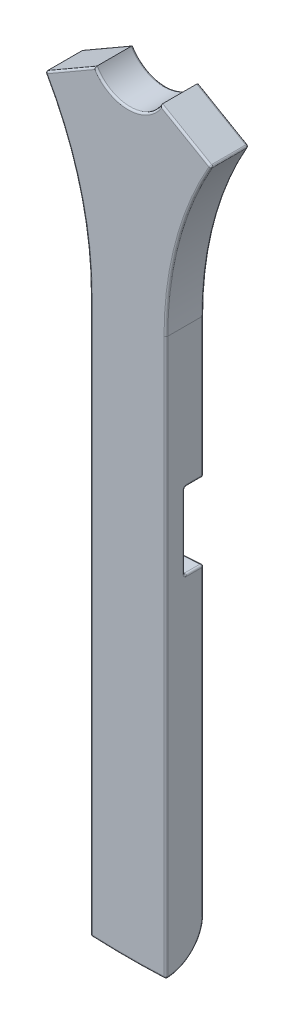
ISO-10303-21;
HEADER;
FILE_DESCRIPTION(('STEP AP214'),'2;1');
FILE_NAME('part.step','',(''),(''),'','','');
FILE_SCHEMA(('AUTOMOTIVE_DESIGN { 1 0 10303 214 1 1 1 1 }'));
ENDSEC;
DATA;
#1=APPLICATION_CONTEXT('core data for automotive mechanical design processes');
#2=APPLICATION_PROTOCOL_DEFINITION('international standard','automotive_design',2000,#1);
#3=PRODUCT_CONTEXT('',#1,'mechanical');
#4=PRODUCT('Part','Part','',(#3));
#5=PRODUCT_RELATED_PRODUCT_CATEGORY('part','',(#4));
#6=PRODUCT_DEFINITION_FORMATION('','',#4);
#7=PRODUCT_DEFINITION_CONTEXT('part definition',#1,'design');
#8=PRODUCT_DEFINITION('design','',#6,#7);
#9=PRODUCT_DEFINITION_SHAPE('','',#8);
#10=(LENGTH_UNIT() NAMED_UNIT(*) SI_UNIT(.MILLI.,.METRE.));
#11=(NAMED_UNIT(*) PLANE_ANGLE_UNIT() SI_UNIT($,.RADIAN.));
#12=(NAMED_UNIT(*) SI_UNIT($,.STERADIAN.) SOLID_ANGLE_UNIT());
#13=UNCERTAINTY_MEASURE_WITH_UNIT(LENGTH_MEASURE(1.E-05),#10,'distance_accuracy_value','');
#14=(GEOMETRIC_REPRESENTATION_CONTEXT(3) GLOBAL_UNCERTAINTY_ASSIGNED_CONTEXT((#13)) GLOBAL_UNIT_ASSIGNED_CONTEXT((#10,
#11,#12)) REPRESENTATION_CONTEXT('',''));
#15=CARTESIAN_POINT('',(0.,0.,0.));
#16=DIRECTION('',(0.,0.,1.));
#17=DIRECTION('',(1.,0.,0.));
#18=AXIS2_PLACEMENT_3D('',#15,#16,#17);
#19=CARTESIAN_POINT('',(-99.7818472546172,-57.6090763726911,0.));
#20=DIRECTION('',(0.,0.,1.));
#21=DIRECTION('',(1.,0.,0.));
#22=AXIS2_PLACEMENT_3D('',#19,#20,#21);
#23=PLANE('',#22);
#24=DIRECTION('',(-0.86602540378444,0.499999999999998,0.));
#25=VECTOR('',#24,1.);
#26=CARTESIAN_POINT('',(-50.140923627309,28.3715254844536,0.));
#27=LINE('',#26,#25);
#28=CARTESIAN_POINT('',(8.83295106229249,-5.67705694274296,0.));
#29=VERTEX_POINT('',#28);
#30=CARTESIAN_POINT('',(21.3466730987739,-12.9018577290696,0.));
#31=VERTEX_POINT('',#30);
#32=EDGE_CURVE('E1320',#29,#31,#27,.F.);
#33=ORIENTED_EDGE('',*,*,#32,.T.);
#34=CARTESIAN_POINT('',(99.7818472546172,-57.6090763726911,0.));
#35=DIRECTION('',(0.,0.,1.));
#36=DIRECTION('',(1.,0.,0.));
#37=AXIS2_PLACEMENT_3D('',#34,#35,#36);
#38=CIRCLE('',#37,90.2818472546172);
#39=CARTESIAN_POINT('',(9.49999999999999,-57.6090763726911,0.));
#40=VERTEX_POINT('',#39);
#41=EDGE_CURVE('E1322',#31,#40,#38,.T.);
#42=ORIENTED_EDGE('',*,*,#41,.T.);
#43=DIRECTION('',(0.,1.,0.));
#44=VECTOR('',#43,1.);
#45=CARTESIAN_POINT('',(9.49999999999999,-57.6090763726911,0.));
#46=LINE('',#45,#44);
#47=CARTESIAN_POINT('',(9.49999999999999,-94.0212741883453,0.));
#48=VERTEX_POINT('',#47);
#49=EDGE_CURVE('E1302',#40,#48,#46,.F.);
#50=ORIENTED_EDGE('',*,*,#49,.T.);
#51=CARTESIAN_POINT('',(0.,0.,0.));
#52=DIRECTION('',(0.,0.,1.));
#53=DIRECTION('',(1.,0.,0.));
#54=AXIS2_PLACEMENT_3D('',#51,#52,#53);
#55=CIRCLE('',#54,94.5);
#56=CARTESIAN_POINT('',(-9.49999999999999,-94.0212741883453,0.));
#57=VERTEX_POINT('',#56);
#58=EDGE_CURVE('E1307',#48,#57,#55,.F.);
#59=ORIENTED_EDGE('',*,*,#58,.T.);
#60=DIRECTION('',(0.,-1.,0.));
#61=VECTOR('',#60,1.);
#62=CARTESIAN_POINT('',(-9.49999999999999,-57.6090763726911,0.));
#63=LINE('',#62,#61);
#64=CARTESIAN_POINT('',(-9.49999999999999,-57.6090763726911,0.));
#65=VERTEX_POINT('',#64);
#66=EDGE_CURVE('E1309',#57,#65,#63,.F.);
#67=ORIENTED_EDGE('',*,*,#66,.T.);
#68=CARTESIAN_POINT('',(-99.7818472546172,-57.6090763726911,0.));
#69=DIRECTION('',(0.,0.,1.));
#70=DIRECTION('',(1.,0.,0.));
#71=AXIS2_PLACEMENT_3D('',#68,#69,#70);
#72=CIRCLE('',#71,90.2818472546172);
#73=CARTESIAN_POINT('',(-21.346673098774,-12.9018577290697,0.));
#74=VERTEX_POINT('',#73);
#75=EDGE_CURVE('E1314',#65,#74,#72,.T.);
#76=ORIENTED_EDGE('',*,*,#75,.T.);
#77=DIRECTION('',(-0.86602540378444,-0.499999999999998,0.));
#78=VECTOR('',#77,1.);
#79=CARTESIAN_POINT('',(-99.5318472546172,-58.0420890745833,0.));
#80=LINE('',#79,#78);
#81=CARTESIAN_POINT('',(-8.83295106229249,-5.67705694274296,0.));
#82=VERTEX_POINT('',#81);
#83=EDGE_CURVE('E1316',#74,#82,#80,.F.);
#84=ORIENTED_EDGE('',*,*,#83,.T.);
#85=CARTESIAN_POINT('',(0.,0.,0.));
#86=DIRECTION('',(0.,0.,1.));
#87=DIRECTION('',(1.,0.,0.));
#88=AXIS2_PLACEMENT_3D('',#85,#86,#87);
#89=CIRCLE('',#88,10.5);
#90=EDGE_CURVE('E1318',#82,#29,#89,.T.);
#91=ORIENTED_EDGE('',*,*,#90,.T.);
#92=EDGE_LOOP('',(#33,#42,#50,#59,#67,#76,#84,#91));
#93=FACE_BOUND('',#92,.T.);
#94=ADVANCED_FACE('F31',(#93),#23,.F.);
#95=CARTESIAN_POINT('',(-99.7818472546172,-57.6090763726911,10.));
#96=DIRECTION('',(0.,0.,-1.));
#97=DIRECTION('',(-1.,0.,0.));
#98=AXIS2_PLACEMENT_3D('',#95,#96,#97);
#99=CYLINDRICAL_SURFACE('',#98,89.7818472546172);
#100=DIRECTION('',(0.,0.,-1.));
#101=VECTOR('',#100,1.);
#102=CARTESIAN_POINT('',(-21.7810637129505,-13.1494557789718,10.));
#103=LINE('',#102,#101);
#104=CARTESIAN_POINT('',(-21.7810637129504,-13.1494557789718,9.5));
#105=VERTEX_POINT('',#104);
#106=CARTESIAN_POINT('',(-21.7810637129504,-13.1494557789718,0.5));
#107=VERTEX_POINT('',#106);
#108=EDGE_CURVE('E276',#105,#107,#103,.T.);
#109=ORIENTED_EDGE('',*,*,#108,.T.);
#110=CARTESIAN_POINT('',(-99.7818472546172,-57.6090763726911,0.5));
#111=DIRECTION('',(0.,0.,1.));
#112=DIRECTION('',(1.,0.,0.));
#113=AXIS2_PLACEMENT_3D('',#110,#111,#112);
#114=CIRCLE('',#113,89.7818472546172);
#115=CARTESIAN_POINT('',(-9.99999999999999,-57.6090763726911,0.5));
#116=VERTEX_POINT('',#115);
#117=EDGE_CURVE('E265',#107,#116,#114,.F.);
#118=ORIENTED_EDGE('',*,*,#117,.T.);
#119=DIRECTION('',(0.,0.,-1.));
#120=VECTOR('',#119,1.);
#121=CARTESIAN_POINT('',(-9.99999999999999,-57.6090763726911,10.));
#122=LINE('',#121,#120);
#123=CARTESIAN_POINT('',(-9.99999999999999,-57.6090763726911,9.5));
#124=VERTEX_POINT('',#123);
#125=EDGE_CURVE('E249',#124,#116,#122,.T.);
#126=ORIENTED_EDGE('',*,*,#125,.F.);
#127=CARTESIAN_POINT('',(-99.7818472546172,-57.6090763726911,9.5));
#128=DIRECTION('',(0.,0.,1.));
#129=DIRECTION('',(1.,0.,0.));
#130=AXIS2_PLACEMENT_3D('',#127,#128,#129);
#131=CIRCLE('',#130,89.7818472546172);
#132=EDGE_CURVE('E262',#124,#105,#131,.T.);
#133=ORIENTED_EDGE('',*,*,#132,.T.);
#134=EDGE_LOOP('',(#109,#118,#126,#133));
#135=FACE_BOUND('',#134,.T.);
#136=ADVANCED_FACE('F261',(#135),#99,.F.);
#137=CARTESIAN_POINT('',(-9.99999999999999,-57.6090763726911,10.));
#138=DIRECTION('',(1.,0.,0.));
#139=DIRECTION('',(0.,1.,0.));
#140=AXIS2_PLACEMENT_3D('',#137,#138,#139);
#141=PLANE('',#140);
#142=ORIENTED_EDGE('',*,*,#125,.T.);
#143=DIRECTION('',(0.,-1.,0.));
#144=VECTOR('',#143,1.);
#145=CARTESIAN_POINT('',(-9.99999999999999,-57.6090763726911,0.5));
#146=LINE('',#145,#144);
#147=CARTESIAN_POINT('',(-9.99999999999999,-94.0212741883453,0.5));
#148=VERTEX_POINT('',#147);
#149=EDGE_CURVE('E776',#116,#148,#146,.T.);
#150=ORIENTED_EDGE('',*,*,#149,.T.);
#151=DIRECTION('',(0.,0.,-1.));
#152=VECTOR('',#151,1.);
#153=CARTESIAN_POINT('',(-9.99999999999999,-94.0212741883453,10.));
#154=LINE('',#153,#152);
#155=CARTESIAN_POINT('',(-9.99999999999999,-94.0212741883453,4.5));
#156=VERTEX_POINT('',#155);
#157=EDGE_CURVE('E780',#148,#156,#154,.F.);
#158=ORIENTED_EDGE('',*,*,#157,.T.);
#159=CARTESIAN_POINT('',(-9.54743337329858,-94.5470534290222,4.33535865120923));
#160=CARTESIAN_POINT('',(-9.99999999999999,-94.5063530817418,4.32109299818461));
#161=CARTESIAN_POINT('',(-9.99999999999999,-94.0773265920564,4.17071730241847));
#162=CARTESIAN_POINT('',(-9.54837028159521,-94.5376801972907,4.36175695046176));
#163=CARTESIAN_POINT('',(-9.99999999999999,-94.4954415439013,4.34949021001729));
#164=CARTESIAN_POINT('',(-9.99999999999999,-94.0587693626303,4.22351390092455));
#165=CARTESIAN_POINT('',(-9.54907816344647,-94.5306012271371,4.38894440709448));
#166=CARTESIAN_POINT('',(-9.99999999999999,-94.4871758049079,4.37898164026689));
#167=CARTESIAN_POINT('',(-9.99999999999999,-94.0447544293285,4.27788881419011));
#168=CARTESIAN_POINT('',(-9.5500250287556,-94.5211343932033,4.44408808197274));
#169=CARTESIAN_POINT('',(-9.99999999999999,-94.4761132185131,4.43896998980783));
#170=CARTESIAN_POINT('',(-9.99999999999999,-94.0260120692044,4.38817616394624));
#171=CARTESIAN_POINT('',(-9.55026436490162,-94.5187430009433,4.47204370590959));
#172=CARTESIAN_POINT('',(-9.99999999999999,-94.4733028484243,4.4694907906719));
#173=CARTESIAN_POINT('',(-9.99999999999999,-94.0212776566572,4.44408741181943));
#174=CARTESIAN_POINT('',(-9.55026473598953,-94.5187394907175,4.52801090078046));
#175=CARTESIAN_POINT('',(-9.99999999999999,-94.4732962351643,4.53056879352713));
#176=CARTESIAN_POINT('',(-9.99999999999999,-94.0212707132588,4.55602180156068));
#177=CARTESIAN_POINT('',(-9.55002483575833,-94.5211367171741,4.55602247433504));
#178=CARTESIAN_POINT('',(-9.99999999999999,-94.4761109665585,4.56115259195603));
#179=CARTESIAN_POINT('',(-9.99999999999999,-94.0260166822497,4.61204494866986));
#180=CARTESIAN_POINT('',(-9.54907323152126,-94.5306501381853,4.61124270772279));
#181=CARTESIAN_POINT('',(-9.99999999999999,-94.4872380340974,4.6212197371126));
#182=CARTESIAN_POINT('',(-9.99999999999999,-94.0448512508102,4.72248541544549));
#183=CARTESIAN_POINT('',(-9.54836161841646,-94.5377654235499,4.63845152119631));
#184=CARTESIAN_POINT('',(-9.99999999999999,-94.4955588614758,4.65072818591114));
#185=CARTESIAN_POINT('',(-9.99999999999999,-94.058938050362,4.77690304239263));
#186=CARTESIAN_POINT('',(-9.54648913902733,-94.5565014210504,4.69128266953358));
#187=CARTESIAN_POINT('',(-9.99999999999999,-94.5173520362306,4.7076206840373));
#188=CARTESIAN_POINT('',(-9.99999999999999,-94.0960318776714,4.88256533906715));
#189=CARTESIAN_POINT('',(-9.54532858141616,-94.5681190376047,4.71690608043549));
#190=CARTESIAN_POINT('',(-9.99999999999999,-94.5308386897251,4.73502611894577));
#191=CARTESIAN_POINT('',(-9.99999999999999,-94.1190327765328,4.93381216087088));
#192=CARTESIAN_POINT('',(-9.54259191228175,-94.5955408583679,4.76589933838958));
#193=CARTESIAN_POINT('',(-9.99999999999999,-94.5624464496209,4.78686250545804));
#194=CARTESIAN_POINT('',(-9.99999999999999,-94.173324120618,5.03179867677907));
#195=CARTESIAN_POINT('',(-9.54101523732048,-94.6113507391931,4.78926607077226));
#196=CARTESIAN_POINT('',(-9.99999999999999,-94.5805976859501,4.81130171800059));
#197=CARTESIAN_POINT('',(-9.99999999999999,-94.2046258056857,5.07853214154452));
#198=CARTESIAN_POINT('',(-9.53749203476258,-94.6467217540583,4.83308754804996));
#199=CARTESIAN_POINT('',(-9.99999999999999,-94.6208505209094,4.85642830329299));
#200=CARTESIAN_POINT('',(-9.99999999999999,-94.2746575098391,5.16617509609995));
#201=CARTESIAN_POINT('',(-9.53554492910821,-94.6662887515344,4.85353765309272));
#202=CARTESIAN_POINT('',(-9.99999999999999,-94.6429851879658,4.87711296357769));
#203=CARTESIAN_POINT('',(-9.99999999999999,-94.3133991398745,5.20707530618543));
#204=CARTESIAN_POINT('',(-9.531340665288,-94.708597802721,4.89091486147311));
#205=CARTESIAN_POINT('',(-9.99999999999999,-94.6903470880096,4.91408389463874));
#206=CARTESIAN_POINT('',(-9.99999999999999,-94.397170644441,5.28182972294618));
#207=CARTESIAN_POINT('',(-9.52908349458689,-94.7313399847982,4.90784182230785));
#208=CARTESIAN_POINT('',(-9.99999999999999,-94.7156010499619,4.93036379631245));
#209=CARTESIAN_POINT('',(-9.99999999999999,-94.442200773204,5.31568364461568));
#210=CARTESIAN_POINT('',(-9.52431245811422,-94.779485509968,4.93778806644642));
#211=CARTESIAN_POINT('',(-9.99999999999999,-94.768423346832,4.95819354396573));
#212=CARTESIAN_POINT('',(-9.99999999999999,-94.5375324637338,5.37557613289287));
#213=CARTESIAN_POINT('',(-9.5217972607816,-94.8049026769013,4.95078555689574));
#214=CARTESIAN_POINT('',(-9.99999999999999,-94.7960261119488,4.96970165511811));
#215=CARTESIAN_POINT('',(-9.99999999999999,-94.5878614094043,5.40157111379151));
#216=CARTESIAN_POINT('',(-9.51659740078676,-94.8575375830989,4.972375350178));
#217=CARTESIAN_POINT('',(-9.99999999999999,-94.8524126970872,4.98763805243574));
#218=CARTESIAN_POINT('',(-9.99999999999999,-94.6920872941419,5.44475070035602));
#219=CARTESIAN_POINT('',(-9.51391296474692,-94.8847529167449,4.98097340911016));
#220=CARTESIAN_POINT('',(-9.99999999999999,-94.881211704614,4.99405093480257));
#221=CARTESIAN_POINT('',(-9.99999999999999,-94.745979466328,5.46194681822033));
#222=CARTESIAN_POINT('',(-9.50843473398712,-94.9403887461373,4.99358678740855));
#223=CARTESIAN_POINT('',(-9.99999999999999,-94.9392105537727,5.00183321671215));
#224=CARTESIAN_POINT('',(-9.99999999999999,-94.856153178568,5.48717357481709));
#225=CARTESIAN_POINT('',(-9.50564045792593,-94.9688146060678,4.99757888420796));
#226=CARTESIAN_POINT('',(-9.99999999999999,-94.9684190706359,5.00315038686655));
#227=CARTESIAN_POINT('',(-9.99999999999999,-94.912445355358,5.49515776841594));
#228=CARTESIAN_POINT('',(-9.5000344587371,-95.02594401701,5.00079450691));
#229=CARTESIAN_POINT('',(-9.99999999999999,-95.0261804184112,5.00085030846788));
#230=CARTESIAN_POINT('',(-9.99999999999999,-95.0255826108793,5.50158901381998));
#231=CARTESIAN_POINT('',(-9.49722273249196,-95.0546476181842,5.00001715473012));
#232=CARTESIAN_POINT('',(-9.99999999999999,-95.0547317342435,4.99720438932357));
#233=CARTESIAN_POINT('',(-9.99999999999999,-95.0824277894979,5.50003430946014));
#234=CARTESIAN_POINT('',(-9.49165715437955,-95.1115623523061,4.99370035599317));
#235=CARTESIAN_POINT('',(-9.99999999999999,-95.1103825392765,4.98530512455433));
#236=CARTESIAN_POINT('',(-9.99999999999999,-95.1951457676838,5.48740071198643));
#237=CARTESIAN_POINT('',(-9.48890340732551,-95.139772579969,4.98815293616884));
#238=CARTESIAN_POINT('',(-9.99999999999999,-95.1374685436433,4.97701849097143));
#239=CARTESIAN_POINT('',(-9.99999999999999,-95.2510167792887,5.47630587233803));
#240=CARTESIAN_POINT('',(-9.48353297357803,-95.1948776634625,4.97245904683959));
#241=CARTESIAN_POINT('',(-9.99999999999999,-95.1894873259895,4.95630784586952));
#242=CARTESIAN_POINT('',(-9.99999999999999,-95.3601562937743,5.44491809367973));
#243=CARTESIAN_POINT('',(-9.48091639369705,-95.2217714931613,4.96230905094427));
#244=CARTESIAN_POINT('',(-9.99999999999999,-95.2143999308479,4.94386025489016));
#245=CARTESIAN_POINT('',(-9.99999999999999,-95.4134227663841,5.42461810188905));
#246=CARTESIAN_POINT('',(-9.47840775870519,-95.247597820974,4.94994908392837));
#247=CARTESIAN_POINT('',(-9.99999999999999,-95.2378048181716,4.92964128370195));
#248=CARTESIAN_POINT('',(-9.99999999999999,-95.4645761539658,5.39989816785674));
#249=(BOUNDED_SURFACE() B_SPLINE_SURFACE(3,2,((#159,#160,#161),(#162,#163,#164),(#165,#166,
#167),(#168,#169,#170),(#171,#172,#173),(#174,#175,#176),(#177,#178,#179),(#180,#181,#182),
(#183,#184,#185),(#186,#187,#188),(#189,#190,#191),(#192,#193,#194),(#195,#196,#197),(#198,#199,
#200),(#201,#202,#203),(#204,#205,#206),(#207,#208,#209),(#210,#211,#212),(#213,#214,#215),
(#216,#217,#218),(#219,#220,#221),(#222,#223,#224),(#225,#226,#227),(#228,#229,#230),(#231,#232,
#233),(#234,#235,#236),(#237,#238,#239),(#240,#241,#242),(#243,#244,#245),(#246,#247,#248)),
.UNSPECIFIED.,.F.,.F.,.F.) B_SPLINE_SURFACE_WITH_KNOTS((4,2,2,2,2,2,2,2,2,2,2,2,2,2,4),(3,3),
(0.,0.167667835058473,0.335209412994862,0.503078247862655,0.670914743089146,0.838636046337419,
1.0065856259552,1.17479947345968,1.34302012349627,1.51215729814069,1.68107260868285,
1.85083589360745,2.02063043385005,2.19070934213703,2.36091878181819),(0.,1.),
.UNSPECIFIED.) GEOMETRIC_REPRESENTATION_ITEM() RATIONAL_B_SPLINE_SURFACE(((1.,0.7398874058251,
1.),(1.,0.740520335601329,1.),(1.,0.740998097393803,1.),(1.,0.741636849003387,1.),(1.,
0.74179807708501,1.),(1.,0.741798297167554,1.),(1.,0.741636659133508,1.),(1.,0.740994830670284,
1.),(1.,0.740514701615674,1.),(1.,0.739249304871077,1.),(1.,0.738464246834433,1.),(1.,
0.736608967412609,1.),(1.,0.735538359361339,1.),(1.,0.733139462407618,1.),(1.,0.731810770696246,
1.),(1.,0.728932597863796,1.),(1.,0.727383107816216,1.),(1.,0.724096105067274,1.),(1.,
0.722357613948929,1.),(1.,0.718749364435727,1.),(1.,0.716879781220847,1.),(1.,0.713048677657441,
1.),(1.,0.711086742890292,1.),(1.,0.70713391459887,1.),(1.,0.705143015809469,1.),(1.,
0.701185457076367,1.),(1.,0.699218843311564,1.),(1.,0.695368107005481,1.),(1.,0.693484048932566,
1.),(1.,0.691670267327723,1.))) REPRESENTATION_ITEM('') SURFACE());
#250=CARTESIAN_POINT('',(-9.99999999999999,-95.4645761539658,5.39989816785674));
#251=CARTESIAN_POINT('',(-9.99999999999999,-95.4134227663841,5.42461810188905));
#252=CARTESIAN_POINT('',(-9.99999999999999,-95.3601562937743,5.44491809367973));
#253=CARTESIAN_POINT('',(-9.99999999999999,-95.2510167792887,5.47630587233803));
#254=CARTESIAN_POINT('',(-9.99999999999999,-95.1951457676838,5.48740071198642));
#255=CARTESIAN_POINT('',(-9.99999999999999,-95.0824277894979,5.50003430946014));
#256=CARTESIAN_POINT('',(-9.99999999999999,-95.0255826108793,5.50158901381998));
#257=CARTESIAN_POINT('',(-9.99999999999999,-94.912445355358,5.49515776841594));
#258=CARTESIAN_POINT('',(-9.99999999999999,-94.856153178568,5.48717357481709));
#259=CARTESIAN_POINT('',(-9.99999999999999,-94.745979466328,5.46194681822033));
#260=CARTESIAN_POINT('',(-9.99999999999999,-94.6920872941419,5.44475070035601));
#261=CARTESIAN_POINT('',(-9.99999999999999,-94.5878614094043,5.40157111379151));
#262=CARTESIAN_POINT('',(-9.99999999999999,-94.5375324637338,5.37557613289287));
#263=CARTESIAN_POINT('',(-9.99999999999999,-94.442200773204,5.31568364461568));
#264=CARTESIAN_POINT('',(-9.99999999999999,-94.397170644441,5.28182972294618));
#265=CARTESIAN_POINT('',(-9.99999999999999,-94.3133991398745,5.20707530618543));
#266=CARTESIAN_POINT('',(-9.99999999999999,-94.2746575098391,5.16617509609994));
#267=CARTESIAN_POINT('',(-9.99999999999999,-94.2046258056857,5.07853214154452));
#268=CARTESIAN_POINT('',(-9.99999999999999,-94.173324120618,5.03179867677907));
#269=CARTESIAN_POINT('',(-9.99999999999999,-94.1190327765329,4.93381216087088));
#270=CARTESIAN_POINT('',(-9.99999999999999,-94.0960318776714,4.88256533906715));
#271=CARTESIAN_POINT('',(-9.99999999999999,-94.058938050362,4.77690304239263));
#272=CARTESIAN_POINT('',(-9.99999999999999,-94.0448512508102,4.72248541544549));
#273=CARTESIAN_POINT('',(-9.99999999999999,-94.0260166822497,4.61204494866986));
#274=CARTESIAN_POINT('',(-9.99999999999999,-94.0212707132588,4.55602180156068));
#275=CARTESIAN_POINT('',(-9.99999999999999,-94.0212776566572,4.44408741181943));
#276=CARTESIAN_POINT('',(-9.99999999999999,-94.0260120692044,4.38817616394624));
#277=CARTESIAN_POINT('',(-9.99999999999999,-94.0447544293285,4.27788881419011));
#278=CARTESIAN_POINT('',(-9.99999999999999,-94.0587693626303,4.22351390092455));
#279=CARTESIAN_POINT('',(-9.99999999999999,-94.0773265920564,4.17071730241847));
#280=B_SPLINE_CURVE_WITH_KNOTS('',3,(#250,#251,#252,#253,#254,#255,#256,#257,#258,#259,#260,
#261,#262,#263,#264,#265,#266,#267,#268,#269,#270,#271,#272,#273,#274,#275,#276,#277,#278,#279),
.UNSPECIFIED.,.F.,.F.,(4,2,2,2,2,2,2,2,2,2,2,2,2,2,4),(0.,0.170209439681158,0.340288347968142,
0.510082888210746,0.679846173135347,0.848761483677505,1.01789865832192,1.18611930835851,
1.354333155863,1.52228273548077,1.69000403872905,1.85784053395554,2.02570936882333,
2.19325094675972,2.36091878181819),.UNSPECIFIED.);
#281=CARTESIAN_POINT('',(-9.99999999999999,-95.0263121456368,5.5));
#282=VERTEX_POINT('',#281);
#283=EDGE_CURVE('E470',#282,#156,#280,.T.);
#284=ORIENTED_EDGE('',*,*,#283,.F.);
#285=DIRECTION('',(0.,1.,0.));
#286=VECTOR('',#285,1.);
#287=CARTESIAN_POINT('',(-9.99999999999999,-114.564392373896,5.5));
#288=LINE('',#287,#286);
#289=CARTESIAN_POINT('',(-9.99999999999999,-114.105214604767,5.5));
#290=VERTEX_POINT('',#289);
#291=EDGE_CURVE('E948',#282,#290,#288,.F.);
#292=ORIENTED_EDGE('',*,*,#291,.T.);
#293=CARTESIAN_POINT('',(-9.51382149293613,-113.93738378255,4.97160376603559));
#294=CARTESIAN_POINT('',(-9.99999999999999,-113.932931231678,4.98428962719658));
#295=CARTESIAN_POINT('',(-9.99999999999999,-113.771857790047,5.44320753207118));
#296=CARTESIAN_POINT('',(-9.51159903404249,-113.96429168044,4.98100791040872));
#297=CARTESIAN_POINT('',(-9.99999999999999,-113.961333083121,4.99198637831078));
#298=CARTESIAN_POINT('',(-9.99999999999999,-113.825302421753,5.4620158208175));
#299=CARTESIAN_POINT('',(-9.50931334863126,-113.992005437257,4.98810786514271));
#300=CARTESIAN_POINT('',(-9.99999999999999,-113.990158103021,4.99707275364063));
#301=CARTESIAN_POINT('',(-9.99999999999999,-113.880348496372,5.47621573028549));
#302=CARTESIAN_POINT('',(-9.50468392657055,-114.048218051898,4.99760134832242));
#303=CARTESIAN_POINT('',(-9.99999999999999,-114.047879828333,5.00225507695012));
#304=CARTESIAN_POINT('',(-9.99999999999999,-113.992001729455,5.49520269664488));
#305=CARTESIAN_POINT('',(-9.50234023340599,-114.076716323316,4.99999830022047));
#306=CARTESIAN_POINT('',(-9.99999999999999,-114.076781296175,5.0023322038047));
#307=CARTESIAN_POINT('',(-9.99999999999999,-114.048607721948,5.49999660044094));
#308=CARTESIAN_POINT('',(-9.49766127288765,-114.13369454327,5.00000169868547));
#309=CARTESIAN_POINT('',(-9.99999999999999,-114.133762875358,4.99765836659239));
#310=CARTESIAN_POINT('',(-9.99999999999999,-114.161785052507,5.50000339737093));
#311=CARTESIAN_POINT('',(-9.49532600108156,-114.162174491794,4.99761122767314));
#312=CARTESIAN_POINT('',(-9.99999999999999,-114.161840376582,4.99288778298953));
#313=CARTESIAN_POINT('',(-9.99999999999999,-114.218356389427,5.49522245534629));
#314=CARTESIAN_POINT('',(-9.49072871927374,-114.218320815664,4.98812042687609));
#315=CARTESIAN_POINT('',(-9.99999999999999,-114.216409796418,4.97887048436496));
#316=CARTESIAN_POINT('',(-9.99999999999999,-114.329884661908,5.47624085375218));
#317=CARTESIAN_POINT('',(-9.48846669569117,-114.245987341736,4.98102097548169));
#318=CARTESIAN_POINT('',(-9.99999999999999,-114.242891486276,4.96960444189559));
#319=CARTESIAN_POINT('',(-9.99999999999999,-114.384841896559,5.46204195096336));
#320=CARTESIAN_POINT('',(-9.48407994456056,-114.299713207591,4.96231323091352));
#321=CARTESIAN_POINT('',(-9.99999999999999,-114.293588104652,4.94705015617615));
#322=CARTESIAN_POINT('',(-9.99999999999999,-114.491565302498,5.42462646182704));
#323=CARTESIAN_POINT('',(-9.48195514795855,-114.325773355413,4.95070722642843));
#324=CARTESIAN_POINT('',(-9.99999999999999,-114.317787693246,4.93374851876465));
#325=CARTESIAN_POINT('',(-9.99999999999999,-114.54333307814,5.40141445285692));
#326=CARTESIAN_POINT('',(-9.47789810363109,-114.375592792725,4.92329190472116));
#327=CARTESIAN_POINT('',(-9.99999999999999,-114.363420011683,4.90363114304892));
#328=CARTESIAN_POINT('',(-9.99999999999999,-114.642299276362,5.34658380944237));
#329=CARTESIAN_POINT('',(-9.47596611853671,-114.399348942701,4.90747695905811));
#330=CARTESIAN_POINT('',(-9.99999999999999,-114.384828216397,4.88680168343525));
#331=CARTESIAN_POINT('',(-9.99999999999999,-114.689491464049,5.3149539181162));
#332=CARTESIAN_POINT('',(-9.47235595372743,-114.443787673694,4.87213590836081));
#333=CARTESIAN_POINT('',(-9.99999999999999,-114.424372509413,4.85025734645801));
#334=CARTESIAN_POINT('',(-9.99999999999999,-114.777771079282,5.24427181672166));
#335=CARTESIAN_POINT('',(-9.47067721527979,-114.464477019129,4.85261819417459));
#336=CARTESIAN_POINT('',(-9.99999999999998,-114.44249373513,4.83054694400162));
#337=CARTESIAN_POINT('',(-9.99999999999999,-114.818871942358,5.20523638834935));
#338=CARTESIAN_POINT('',(-9.46761503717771,-114.502249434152,4.81039993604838));
#339=CARTESIAN_POINT('',(-9.99999999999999,-114.475221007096,4.78879899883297));
#340=CARTESIAN_POINT('',(-9.99999999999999,-114.893910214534,5.12079987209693));
#341=CARTESIAN_POINT('',(-9.46623158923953,-114.519332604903,4.78769948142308));
#342=CARTESIAN_POINT('',(-9.99999999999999,-114.489805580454,4.76676674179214));
#343=CARTESIAN_POINT('',(-9.99999999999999,-114.927847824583,5.07539896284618));
#344=CARTESIAN_POINT('',(-9.46380156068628,-114.549359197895,4.73982234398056));
#345=CARTESIAN_POINT('',(-9.99999999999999,-114.51522512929,4.72100957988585));
#346=CARTESIAN_POINT('',(-9.99999999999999,-114.987499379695,4.9796446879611));
#347=CARTESIAN_POINT('',(-9.46275412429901,-114.562313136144,4.71465216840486));
#348=CARTESIAN_POINT('',(-9.99999999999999,-114.526051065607,4.69730059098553));
#349=CARTESIAN_POINT('',(-9.99999999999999,-115.013234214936,4.92930433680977));
#350=CARTESIAN_POINT('',(-9.46102148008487,-114.583750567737,4.66253877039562));
#351=CARTESIAN_POINT('',(-9.99999999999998,-114.543869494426,4.64872126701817));
#352=CARTESIAN_POINT('',(-9.99999999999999,-115.055822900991,4.82507754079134));
#353=CARTESIAN_POINT('',(-9.4603357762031,-114.592240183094,4.63559803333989));
#354=CARTESIAN_POINT('',(-9.99999999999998,-114.550853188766,4.62386911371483));
#355=CARTESIAN_POINT('',(-9.99999999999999,-115.072688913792,4.7711960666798));
#356=CARTESIAN_POINT('',(-9.45934464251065,-114.604513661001,4.58074786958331));
#357=CARTESIAN_POINT('',(-9.99999999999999,-114.560929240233,4.57355527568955));
#358=CARTESIAN_POINT('',(-9.99999999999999,-115.097072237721,4.66149573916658));
#359=CARTESIAN_POINT('',(-9.45903829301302,-114.608308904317,4.55284095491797));
#360=CARTESIAN_POINT('',(-9.99999999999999,-114.564022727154,4.54811504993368));
#361=CARTESIAN_POINT('',(-9.99999999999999,-115.10461215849,4.60568190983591));
#362=CARTESIAN_POINT('',(-9.45881108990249,-114.61112354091,4.49678445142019));
#363=CARTESIAN_POINT('',(-9.99999999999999,-114.566319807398,4.49706239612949));
#364=CARTESIAN_POINT('',(-9.99999999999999,-115.110203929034,4.49356890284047));
#365=CARTESIAN_POINT('',(-9.45889031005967,-114.61014202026,4.46863481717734));
#366=CARTESIAN_POINT('',(-9.99999999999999,-114.565520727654,4.47147135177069));
#367=CARTESIAN_POINT('',(-9.99999999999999,-115.108253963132,4.43726963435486));
#368=CARTESIAN_POINT('',(-9.45943227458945,-114.603428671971,4.41295635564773));
#369=CARTESIAN_POINT('',(-9.99999999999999,-114.560034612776,4.42066632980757));
#370=CARTESIAN_POINT('',(-9.99999999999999,-115.094916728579,4.32591271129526));
#371=CARTESIAN_POINT('',(-9.45989427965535,-114.59770600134,4.38542643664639));
#372=CARTESIAN_POINT('',(-9.99999999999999,-114.555359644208,4.39547270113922));
#373=CARTESIAN_POINT('',(-9.99999999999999,-115.083547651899,4.2708528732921));
#374=CARTESIAN_POINT('',(-9.46118649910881,-114.581709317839,4.33168317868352));
#375=CARTESIAN_POINT('',(-9.99999999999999,-114.54216235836,4.34591004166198));
#376=CARTESIAN_POINT('',(-9.99999999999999,-115.051767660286,4.16336635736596));
#377=CARTESIAN_POINT('',(-9.46201697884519,-114.571432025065,4.30547080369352));
#378=CARTESIAN_POINT('',(-9.99999999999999,-114.533647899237,4.32156011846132));
#379=CARTESIAN_POINT('',(-9.99999999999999,-115.031350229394,4.11094160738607));
#380=CARTESIAN_POINT('',(-9.46302416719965,-114.55897531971,4.28031371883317));
#381=CARTESIAN_POINT('',(-9.99999999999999,-114.523228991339,4.29785725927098));
#382=CARTESIAN_POINT('',(-9.99999999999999,-115.006603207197,4.06062743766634));
#383=(BOUNDED_SURFACE() B_SPLINE_SURFACE(3,2,((#293,#294,#295),(#296,#297,#298),(#299,#300,
#301),(#302,#303,#304),(#305,#306,#307),(#308,#309,#310),(#311,#312,#313),(#314,#315,#316),
(#317,#318,#319),(#320,#321,#322),(#323,#324,#325),(#326,#327,#328),(#329,#330,#331),(#332,#333,
#334),(#335,#336,#337),(#338,#339,#340),(#341,#342,#343),(#344,#345,#346),(#347,#348,#349),
(#350,#351,#352),(#353,#354,#355),(#356,#357,#358),(#359,#360,#361),(#362,#363,#364),(#365,#366,
#367),(#368,#369,#370),(#371,#372,#373),(#374,#375,#376),(#377,#378,#379),(#380,#381,#382)),
.UNSPECIFIED.,.F.,.F.,.F.) B_SPLINE_SURFACE_WITH_KNOTS((4,2,2,2,2,2,2,2,2,2,2,2,2,2,4),(3,3),
(0.,0.169745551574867,0.339367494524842,0.508880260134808,0.678361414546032,0.847756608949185,
1.01737947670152,1.18662245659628,1.35586068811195,1.52466440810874,1.69323603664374,
1.86139818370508,2.02959250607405,2.19746273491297,2.36545404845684),(0.,1.),
.UNSPECIFIED.) GEOMETRIC_REPRESENTATION_ITEM() RATIONAL_B_SPLINE_SURFACE(((1.,0.716813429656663,
1.),(1.,0.715263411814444,1.),(1.,0.713663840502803,1.),(1.,0.710412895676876,1.),(1.,
0.70876156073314,1.),(1.,0.705453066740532,1.),(1.,0.703795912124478,1.),(1.,0.700522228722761,
1.),(1.,0.698905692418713,1.),(1.,0.695760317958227,1.),(1.,0.694231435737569,1.),(1.,
0.691303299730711,1.),(1.,0.689904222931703,1.),(1.,0.687282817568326,1.),(1.,0.686060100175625,
1.),(1.,0.683824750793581,1.),(1.,0.682812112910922,1.),(1.,0.681030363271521,1.),(1.,
0.680260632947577,1.),(1.,0.678985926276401,1.),(1.,0.678480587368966,1.),(1.,0.677749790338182,
1.),(1.,0.677523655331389,1.),(1.,0.677355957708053,1.),(1.,0.677414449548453,1.),(1.,
0.67781437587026,1.),(1.,0.6781552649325,1.),(1.,0.679107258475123,1.),(1.,0.679718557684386,
1.),(1.,0.680458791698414,1.))) REPRESENTATION_ITEM('') SURFACE());
#384=CARTESIAN_POINT('',(-9.99999999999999,-115.006603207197,4.06062743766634));
#385=CARTESIAN_POINT('',(-9.99999999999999,-115.031350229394,4.11094160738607));
#386=CARTESIAN_POINT('',(-9.99999999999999,-115.051767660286,4.16336635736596));
#387=CARTESIAN_POINT('',(-9.99999999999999,-115.083547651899,4.2708528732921));
#388=CARTESIAN_POINT('',(-9.99999999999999,-115.094916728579,4.32591271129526));
#389=CARTESIAN_POINT('',(-9.99999999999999,-115.108253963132,4.43726963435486));
#390=CARTESIAN_POINT('',(-9.99999999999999,-115.110203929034,4.49356890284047));
#391=CARTESIAN_POINT('',(-9.99999999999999,-115.10461215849,4.60568190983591));
#392=CARTESIAN_POINT('',(-9.99999999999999,-115.097072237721,4.66149573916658));
#393=CARTESIAN_POINT('',(-9.99999999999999,-115.072688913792,4.7711960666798));
#394=CARTESIAN_POINT('',(-9.99999999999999,-115.055822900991,4.82507754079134));
#395=CARTESIAN_POINT('',(-9.99999999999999,-115.013234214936,4.92930433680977));
#396=CARTESIAN_POINT('',(-9.99999999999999,-114.987499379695,4.9796446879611));
#397=CARTESIAN_POINT('',(-9.99999999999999,-114.927847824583,5.07539896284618));
#398=CARTESIAN_POINT('',(-9.99999999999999,-114.893910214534,5.12079987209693));
#399=CARTESIAN_POINT('',(-9.99999999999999,-114.818871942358,5.20523638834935));
#400=CARTESIAN_POINT('',(-9.99999999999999,-114.777771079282,5.24427181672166));
#401=CARTESIAN_POINT('',(-9.99999999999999,-114.689491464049,5.3149539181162));
#402=CARTESIAN_POINT('',(-9.99999999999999,-114.642299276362,5.34658380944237));
#403=CARTESIAN_POINT('',(-9.99999999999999,-114.54333307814,5.40141445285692));
#404=CARTESIAN_POINT('',(-9.99999999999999,-114.491565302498,5.42462646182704));
#405=CARTESIAN_POINT('',(-9.99999999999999,-114.384841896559,5.46204195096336));
#406=CARTESIAN_POINT('',(-9.99999999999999,-114.329884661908,5.47624085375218));
#407=CARTESIAN_POINT('',(-9.99999999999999,-114.218356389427,5.49522245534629));
#408=CARTESIAN_POINT('',(-9.99999999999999,-114.161785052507,5.50000339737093));
#409=CARTESIAN_POINT('',(-9.99999999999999,-114.048607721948,5.49999660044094));
#410=CARTESIAN_POINT('',(-9.99999999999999,-113.992001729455,5.49520269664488));
#411=CARTESIAN_POINT('',(-9.99999999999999,-113.880348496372,5.47621573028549));
#412=CARTESIAN_POINT('',(-9.99999999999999,-113.825302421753,5.4620158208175));
#413=CARTESIAN_POINT('',(-9.99999999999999,-113.771857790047,5.44320753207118));
#414=B_SPLINE_CURVE_WITH_KNOTS('',3,(#384,#385,#386,#387,#388,#389,#390,#391,#392,#393,#394,
#395,#396,#397,#398,#399,#400,#401,#402,#403,#404,#405,#406,#407,#408,#409,#410,#411,#412,#413),
.UNSPECIFIED.,.F.,.F.,(4,2,2,2,2,2,2,2,2,2,2,2,2,2,4),(0.,0.167991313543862,0.335861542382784,
0.504055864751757,0.672218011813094,0.840789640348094,1.00959336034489,1.17883159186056,
1.34807457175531,1.51769743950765,1.6870926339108,1.85657378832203,2.02608655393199,
2.19570849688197,2.36545404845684),.UNSPECIFIED.);
#415=CARTESIAN_POINT('',(-9.99999999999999,-115.108644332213,4.5));
#416=VERTEX_POINT('',#415);
#417=EDGE_CURVE('E947',#416,#290,#414,.T.);
#418=ORIENTED_EDGE('',*,*,#417,.F.);
#419=DIRECTION('',(0.,0.,-1.));
#420=VECTOR('',#419,1.);
#421=CARTESIAN_POINT('',(-9.99999999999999,-115.108644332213,10.));
#422=LINE('',#421,#420);
#423=CARTESIAN_POINT('',(-9.99999999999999,-115.108644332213,0.5));
#424=VERTEX_POINT('',#423);
#425=EDGE_CURVE('E861',#416,#424,#422,.T.);
#426=ORIENTED_EDGE('',*,*,#425,.T.);
#427=DIRECTION('',(0.,-1.,0.));
#428=VECTOR('',#427,1.);
#429=CARTESIAN_POINT('',(-9.99999999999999,-57.6090763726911,0.5));
#430=LINE('',#429,#428);
#431=CARTESIAN_POINT('',(-9.99999999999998,-194.768452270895,0.5));
#432=VERTEX_POINT('',#431);
#433=EDGE_CURVE('E455',#424,#432,#430,.T.);
#434=ORIENTED_EDGE('',*,*,#433,.T.);
#435=CARTESIAN_POINT('',(-9.4917969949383,-191.451658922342,0.564813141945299));
#436=CARTESIAN_POINT('',(-9.99999999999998,-191.44889916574,0.55694435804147));
#437=CARTESIAN_POINT('',(-9.99999999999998,-191.617115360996,1.03657248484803));
#438=CARTESIAN_POINT('',(-9.49246549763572,-191.717591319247,0.471504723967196));
#439=CARTESIAN_POINT('',(-9.99999999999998,-191.715095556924,0.46427500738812));
#440=CARTESIAN_POINT('',(-9.99999999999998,-191.869782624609,0.947929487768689));
#441=CARTESIAN_POINT('',(-9.49314121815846,-191.987464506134,0.389472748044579));
#442=CARTESIAN_POINT('',(-9.99999999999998,-191.985364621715,0.382834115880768));
#443=CARTESIAN_POINT('',(-9.99999999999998,-192.126193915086,0.869999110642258));
#444=CARTESIAN_POINT('',(-9.49450198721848,-192.533144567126,0.24842067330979));
#445=CARTESIAN_POINT('',(-9.99999999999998,-192.531737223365,0.243043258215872));
#446=CARTESIAN_POINT('',(-9.99999999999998,-192.644653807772,0.735999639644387));
#447=CARTESIAN_POINT('',(-9.49518703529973,-192.808951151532,0.189399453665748));
#448=CARTESIAN_POINT('',(-9.99999999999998,-192.807828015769,0.184661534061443));
#449=CARTESIAN_POINT('',(-9.99999999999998,-192.906702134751,0.67992948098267));
#450=CARTESIAN_POINT('',(-9.49656096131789,-193.364391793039,0.0948501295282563));
#451=CARTESIAN_POINT('',(-9.99999999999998,-193.363733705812,0.0914502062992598));
#452=CARTESIAN_POINT('',(-9.99999999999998,-193.434434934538,0.590107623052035));
#453=CARTESIAN_POINT('',(-9.49724983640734,-193.644023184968,0.0593064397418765));
#454=CARTESIAN_POINT('',(-9.99999999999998,-193.643538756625,0.0565727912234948));
#455=CARTESIAN_POINT('',(-9.99999999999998,-193.700116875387,0.556341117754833));
#456=CARTESIAN_POINT('',(-9.49862663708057,-194.205205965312,0.0118736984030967));
#457=CARTESIAN_POINT('',(-9.99999999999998,-194.204953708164,0.0105133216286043));
#458=CARTESIAN_POINT('',(-9.99999999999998,-194.233304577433,0.511280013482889));
#459=CARTESIAN_POINT('',(-9.49931456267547,-194.486757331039,-1.56321675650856E-05));
#460=CARTESIAN_POINT('',(-9.99999999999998,-194.486562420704,-0.000701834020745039));
#461=CARTESIAN_POINT('',(-9.99999999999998,-194.50081031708,0.499985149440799));
#462=CARTESIAN_POINT('',(-9.50137009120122,-195.331520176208,3.12464677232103E-05));
#463=CARTESIAN_POINT('',(-9.99999999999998,-195.330753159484,0.00139998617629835));
#464=CARTESIAN_POINT('',(-9.99999999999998,-195.303430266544,0.500029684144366));
#465=CARTESIAN_POINT('',(-9.50273024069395,-195.89516172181,0.0476279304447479));
#466=CARTESIAN_POINT('',(-9.99999999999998,-195.8941973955,0.050218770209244));
#467=CARTESIAN_POINT('',(-9.99999999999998,-195.83895249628,0.545246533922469));
#468=CARTESIAN_POINT('',(-9.50538968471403,-197.006043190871,0.236756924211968));
#469=CARTESIAN_POINT('',(-9.99999999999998,-197.004191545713,0.24185330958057));
#470=CARTESIAN_POINT('',(-9.99999999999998,-196.894412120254,0.72491907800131));
#471=CARTESIAN_POINT('',(-9.5066889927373,-197.553286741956,0.378268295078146));
#472=CARTESIAN_POINT('',(-9.99999999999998,-197.550861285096,0.384413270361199));
#473=CARTESIAN_POINT('',(-9.99999999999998,-197.414352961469,0.859354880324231));
#474=CARTESIAN_POINT('',(-9.50919417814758,-198.616297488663,0.751115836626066));
#475=CARTESIAN_POINT('',(-9.99999999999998,-198.612240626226,0.759260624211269));
#476=CARTESIAN_POINT('',(-9.99999999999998,-198.424327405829,1.21356004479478));
#477=CARTESIAN_POINT('',(-9.51040005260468,-199.132063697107,0.982454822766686));
#478=CARTESIAN_POINT('',(-9.99999999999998,-199.127130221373,0.991366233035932));
#479=CARTESIAN_POINT('',(-9.99999999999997,-198.914360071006,1.43333208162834));
#480=CARTESIAN_POINT('',(-9.51268907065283,-200.117715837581,1.52877093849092));
#481=CARTESIAN_POINT('',(-9.99999999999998,-200.110612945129,1.53898129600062));
#482=CARTESIAN_POINT('',(-9.99999999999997,-199.850833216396,1.95233239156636));
#483=CARTESIAN_POINT('',(-9.51377218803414,-200.587591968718,1.84376588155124));
#484=CARTESIAN_POINT('',(-9.99999999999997,-200.579421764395,1.85439026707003));
#485=CARTESIAN_POINT('',(-9.99999999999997,-200.297264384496,2.25157758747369));
#486=CARTESIAN_POINT('',(-9.51528383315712,-201.24720460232,2.37160344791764));
#487=CARTESIAN_POINT('',(-9.99999999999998,-201.237519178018,2.38283802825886));
#488=CARTESIAN_POINT('',(-9.99999999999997,-200.9239643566,2.75302327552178));
#489=CARTESIAN_POINT('',(-9.51576898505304,-201.459590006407,2.55682748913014));
#490=CARTESIAN_POINT('',(-9.99999999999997,-201.449299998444,2.56812674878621));
#491=CARTESIAN_POINT('',(-9.99999999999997,-201.125752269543,2.92898611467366));
#492=CARTESIAN_POINT('',(-9.51669928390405,-201.867975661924,2.94449933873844));
#493=CARTESIAN_POINT('',(-9.99999999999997,-201.85644487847,2.95582257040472));
#494=CARTESIAN_POINT('',(-9.99999999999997,-201.513760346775,3.29727437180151));
#495=CARTESIAN_POINT('',(-9.5171444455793,-202.063981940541,3.14694075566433));
#496=CARTESIAN_POINT('',(-9.99999999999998,-202.051845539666,3.15822295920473));
#497=CARTESIAN_POINT('',(-9.99999999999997,-201.699986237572,3.48959371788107));
#498=CARTESIAN_POINT('',(-9.51799230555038,-202.438236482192,3.56765445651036));
#499=CARTESIAN_POINT('',(-9.99999999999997,-202.424875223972,3.57874806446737));
#500=CARTESIAN_POINT('',(-9.99999999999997,-202.05556595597,3.88927173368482));
#501=CARTESIAN_POINT('',(-9.51839499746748,-202.616482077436,3.78592911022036));
#502=CARTESIAN_POINT('',(-9.99999999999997,-202.60253167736,3.7968797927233));
#503=CARTESIAN_POINT('',(-9.99999999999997,-202.224917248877,4.09663265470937));
#504=CARTESIAN_POINT('',(-9.51915551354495,-202.953866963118,4.23665918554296));
#505=CARTESIAN_POINT('',(-9.99999999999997,-202.938742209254,4.24721748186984));
#506=CARTESIAN_POINT('',(-9.99999999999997,-202.545466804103,4.52482622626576));
#507=CARTESIAN_POINT('',(-9.51951335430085,-203.113013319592,4.46910931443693));
#508=CARTESIAN_POINT('',(-9.99999999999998,-203.097331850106,4.47942733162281));
#509=CARTESIAN_POINT('',(-9.99999999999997,-202.696671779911,4.74565384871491));
#510=CARTESIAN_POINT('',(-9.52018212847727,-203.411024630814,4.94643653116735));
#511=CARTESIAN_POINT('',(-9.99999999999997,-203.394251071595,4.95617086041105));
#512=CARTESIAN_POINT('',(-9.99999999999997,-202.979812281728,5.19911470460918));
#513=CARTESIAN_POINT('',(-9.52049309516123,-203.549903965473,5.19130464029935));
#514=CARTESIAN_POINT('',(-9.99999999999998,-203.532621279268,5.20070900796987));
#515=CARTESIAN_POINT('',(-9.99999999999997,-203.111761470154,5.43173940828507));
#516=CARTESIAN_POINT('',(-9.52106664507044,-203.806476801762,5.6917874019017));
#517=CARTESIAN_POINT('',(-9.99999999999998,-203.78821321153,5.7004343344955));
#518=CARTESIAN_POINT('',(-9.99999999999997,-203.355531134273,5.90719803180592));
#519=CARTESIAN_POINT('',(-9.52132924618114,-203.924178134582,5.9473980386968));
#520=CARTESIAN_POINT('',(-9.99999999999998,-203.905466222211,5.95563482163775));
#521=CARTESIAN_POINT('',(-9.99999999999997,-203.467359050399,6.15002813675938));
#522=CARTESIAN_POINT('',(-9.52180494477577,-204.137678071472,6.46778553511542));
#523=CARTESIAN_POINT('',(-9.99999999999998,-204.118121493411,6.47511212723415));
#524=CARTESIAN_POINT('',(-9.99999999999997,-203.670205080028,6.6443962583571));
#525=CARTESIAN_POINT('',(-9.52201801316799,-204.233463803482,6.73256767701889));
#526=CARTESIAN_POINT('',(-9.99999999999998,-204.213531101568,6.73941499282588));
#527=CARTESIAN_POINT('',(-9.99999999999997,-203.761210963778,6.89593929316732));
#528=CARTESIAN_POINT('',(-9.52239325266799,-204.402326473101,7.26917047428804));
#529=CARTESIAN_POINT('',(-9.99999999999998,-204.381707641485,7.27498008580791));
#530=CARTESIAN_POINT('',(-9.99999999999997,-203.921647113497,7.40571195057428));
#531=CARTESIAN_POINT('',(-9.52255544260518,-204.47541181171,7.54098848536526));
#532=CARTESIAN_POINT('',(-9.99999999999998,-204.454499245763,7.54626321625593));
#533=CARTESIAN_POINT('',(-9.99999999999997,-203.991085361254,7.663939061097));
#534=CARTESIAN_POINT('',(-9.52282801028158,-204.598320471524,8.08947817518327));
#535=CARTESIAN_POINT('',(-9.99999999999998,-204.576898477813,8.09361686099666));
#536=CARTESIAN_POINT('',(-9.99999999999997,-204.107860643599,8.18500426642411));
#537=CARTESIAN_POINT('',(-9.52293845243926,-204.648172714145,8.36614337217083));
#538=CARTESIAN_POINT('',(-9.99999999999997,-204.626546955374,8.36970654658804));
#539=CARTESIAN_POINT('',(-9.99999999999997,-204.155225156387,8.44783620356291));
#540=CARTESIAN_POINT('',(-9.52310725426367,-204.724396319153,8.92269384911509));
#541=CARTESIAN_POINT('',(-9.99999999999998,-204.702450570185,8.92505297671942));
#542=CARTESIAN_POINT('',(-9.99999999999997,-204.22764504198,8.97655915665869));
#543=CARTESIAN_POINT('',(-9.52316561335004,-204.750767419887,9.20257916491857));
#544=CARTESIAN_POINT('',(-9.99999999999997,-204.728713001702,9.20433690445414));
#545=CARTESIAN_POINT('',(-9.99999999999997,-204.25270016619,9.24245020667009));
#546=CARTESIAN_POINT('',(-9.52322995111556,-204.779839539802,9.76377119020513));
#547=CARTESIAN_POINT('',(-9.99999999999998,-204.757661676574,9.7642877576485));
#548=CARTESIAN_POINT('',(-9.99999999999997,-204.280321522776,9.77558263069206));
#549=CARTESIAN_POINT('',(-9.52323589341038,-204.782524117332,10.0450787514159));
#550=CARTESIAN_POINT('',(-9.99999999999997,-204.760334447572,10.0449835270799));
#551=CARTESIAN_POINT('',(-9.99999999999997,-204.282872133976,10.0428248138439));
#552=CARTESIAN_POINT('',(-9.52319532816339,-204.764196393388,10.6069340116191));
#553=CARTESIAN_POINT('',(-9.99999999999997,-204.742086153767,10.6055935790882));
#554=CARTESIAN_POINT('',(-9.99999999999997,-204.265459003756,10.5765873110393));
#555=CARTESIAN_POINT('',(-9.52314881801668,-204.74318291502,10.8874816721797));
#556=CARTESIAN_POINT('',(-9.99999999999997,-204.721162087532,10.8855358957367));
#557=CARTESIAN_POINT('',(-9.99999999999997,-204.245494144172,10.8431075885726));
#558=CARTESIAN_POINT('',(-9.5230760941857,-204.710328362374,11.1666411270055));
#559=CARTESIAN_POINT('',(-9.99999999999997,-204.688444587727,11.1640677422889));
#560=CARTESIAN_POINT('',(-9.99999999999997,-204.214279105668,11.1083090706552));
#561=(BOUNDED_SURFACE() B_SPLINE_SURFACE(3,2,((#435,#436,#437),(#438,#439,#440),(#441,#442,
#443),(#444,#445,#446),(#447,#448,#449),(#450,#451,#452),(#453,#454,#455),(#456,#457,#458),
(#459,#460,#461),(#462,#463,#464),(#465,#466,#467),(#468,#469,#470),(#471,#472,#473),(#474,#475,
#476),(#477,#478,#479),(#480,#481,#482),(#483,#484,#485),(#486,#487,#488),(#489,#490,#491),
(#492,#493,#494),(#495,#496,#497),(#498,#499,#500),(#501,#502,#503),(#504,#505,#506),(#507,#508,
#509),(#510,#511,#512),(#513,#514,#515),(#516,#517,#518),(#519,#520,#521),(#522,#523,#524),
(#525,#526,#527),(#528,#529,#530),(#531,#532,#533),(#534,#535,#536),(#537,#538,#539),(#540,#541,
#542),(#543,#544,#545),(#546,#547,#548),(#549,#550,#551),(#552,#553,#554),(#555,#556,#557),
(#558,#559,#560)),.UNSPECIFIED.,.F.,.F.,.F.) B_SPLINE_SURFACE_WITH_KNOTS((4,2,2,2,2,2,2,2,2,2,2,
2,2,2,2,2,2,2,2,2,4),(3,3),(0.,0.803034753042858,1.60603038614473,2.4084924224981,
3.21094499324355,4.81493293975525,6.41856338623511,8.0222440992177,9.62626656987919,
10.4286848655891,11.230806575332,12.0330485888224,12.8349928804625,13.6363653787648,
14.4374409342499,15.2389857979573,16.0402336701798,16.8404814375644,17.640738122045,
18.4415502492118,19.2424021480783),(0.,1.),
.UNSPECIFIED.) GEOMETRIC_REPRESENTATION_ITEM() RATIONAL_B_SPLINE_SURFACE(((1.,0.701282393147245,
1.),(1.,0.701759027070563,1.),(1.,0.70224031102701,1.),(1.,0.703208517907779,1.),(1.,
0.703695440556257,1.),(1.,0.704670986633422,1.),(1.,0.705159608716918,1.),(1.,0.706135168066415,
1.),(1.,0.706622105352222,1.),(1.,0.708075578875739,1.),(1.,0.709035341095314,1.),(1.,
0.710908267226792,1.),(1.,0.711821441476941,1.),(1.,0.713578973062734,1.),(1.,0.714423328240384,
1.),(1.,0.716023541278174,1.),(1.,0.716779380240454,1.),(1.,0.717832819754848,1.),(1.,
0.718170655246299,1.),(1.,0.71881804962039,1.),(1.,0.719127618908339,1.),(1.,0.719716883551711,
1.),(1.,0.719996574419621,1.),(1.,0.720524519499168,1.),(1.,0.720772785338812,1.),(1.,
0.72123656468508,1.),(1.,0.721452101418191,1.),(1.,0.721849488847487,1.),(1.,0.722031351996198,
1.),(1.,0.722360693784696,1.),(1.,0.722508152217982,1.),(1.,0.722767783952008,1.),(1.,
0.722879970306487,1.),(1.,0.72306847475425,1.),(1.,0.723144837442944,1.),(1.,0.723261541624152,
1.),(1.,0.723301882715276,1.),(1.,0.723346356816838,1.),(1.,0.723350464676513,1.),(1.,
0.723322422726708,1.),(1.,0.723290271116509,1.),(1.,0.723239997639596,1.))) REPRESENTATION_ITEM('') SURFACE());
#562=CARTESIAN_POINT('',(-9.99999999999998,-191.617115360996,1.03657248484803));
#563=CARTESIAN_POINT('',(-9.99999999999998,-191.869782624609,0.947929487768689));
#564=CARTESIAN_POINT('',(-9.99999999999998,-192.126193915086,0.869999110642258));
#565=CARTESIAN_POINT('',(-9.99999999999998,-192.644653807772,0.735999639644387));
#566=CARTESIAN_POINT('',(-9.99999999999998,-192.906702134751,0.67992948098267));
#567=CARTESIAN_POINT('',(-9.99999999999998,-193.434434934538,0.590107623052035));
#568=CARTESIAN_POINT('',(-9.99999999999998,-193.700116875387,0.556341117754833));
#569=CARTESIAN_POINT('',(-9.99999999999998,-194.233304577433,0.511280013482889));
#570=CARTESIAN_POINT('',(-9.99999999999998,-194.50081031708,0.499985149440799));
#571=CARTESIAN_POINT('',(-9.99999999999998,-195.303430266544,0.500029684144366));
#572=CARTESIAN_POINT('',(-9.99999999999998,-195.83895249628,0.545246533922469));
#573=CARTESIAN_POINT('',(-9.99999999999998,-196.894412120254,0.72491907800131));
#574=CARTESIAN_POINT('',(-9.99999999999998,-197.414352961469,0.859354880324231));
#575=CARTESIAN_POINT('',(-9.99999999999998,-198.424327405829,1.21356004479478));
#576=CARTESIAN_POINT('',(-9.99999999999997,-198.914360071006,1.43333208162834));
#577=CARTESIAN_POINT('',(-9.99999999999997,-199.850833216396,1.95233239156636));
#578=CARTESIAN_POINT('',(-9.99999999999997,-200.297264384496,2.25157758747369));
#579=CARTESIAN_POINT('',(-9.99999999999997,-200.9239643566,2.75302327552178));
#580=CARTESIAN_POINT('',(-9.99999999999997,-201.125752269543,2.92898611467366));
#581=CARTESIAN_POINT('',(-9.99999999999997,-201.513760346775,3.29727437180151));
#582=CARTESIAN_POINT('',(-9.99999999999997,-201.699986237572,3.48959371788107));
#583=CARTESIAN_POINT('',(-9.99999999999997,-202.05556595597,3.88927173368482));
#584=CARTESIAN_POINT('',(-9.99999999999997,-202.224917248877,4.09663265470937));
#585=CARTESIAN_POINT('',(-9.99999999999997,-202.545466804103,4.52482622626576));
#586=CARTESIAN_POINT('',(-9.99999999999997,-202.696671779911,4.74565384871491));
#587=CARTESIAN_POINT('',(-9.99999999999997,-202.979812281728,5.19911470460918));
#588=CARTESIAN_POINT('',(-9.99999999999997,-203.111761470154,5.43173940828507));
#589=CARTESIAN_POINT('',(-9.99999999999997,-203.355531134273,5.90719803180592));
#590=CARTESIAN_POINT('',(-9.99999999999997,-203.467359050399,6.15002813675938));
#591=CARTESIAN_POINT('',(-9.99999999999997,-203.670205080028,6.6443962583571));
#592=CARTESIAN_POINT('',(-9.99999999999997,-203.761210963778,6.89593929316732));
#593=CARTESIAN_POINT('',(-9.99999999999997,-203.921647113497,7.40571195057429));
#594=CARTESIAN_POINT('',(-9.99999999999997,-203.991085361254,7.663939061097));
#595=CARTESIAN_POINT('',(-9.99999999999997,-204.107860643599,8.18500426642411));
#596=CARTESIAN_POINT('',(-9.99999999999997,-204.155225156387,8.44783620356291));
#597=CARTESIAN_POINT('',(-9.99999999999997,-204.22764504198,8.97655915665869));
#598=CARTESIAN_POINT('',(-9.99999999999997,-204.25270016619,9.24245020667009));
#599=CARTESIAN_POINT('',(-9.99999999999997,-204.280321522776,9.77558263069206));
#600=CARTESIAN_POINT('',(-9.99999999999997,-204.282872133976,10.0428248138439));
#601=CARTESIAN_POINT('',(-9.99999999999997,-204.265459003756,10.5765873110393));
#602=CARTESIAN_POINT('',(-9.99999999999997,-204.245494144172,10.8431075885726));
#603=CARTESIAN_POINT('',(-9.99999999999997,-204.214279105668,11.1083090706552));
#604=B_SPLINE_CURVE_WITH_KNOTS('',3,(#562,#563,#564,#565,#566,#567,#568,#569,#570,#571,#572,
#573,#574,#575,#576,#577,#578,#579,#580,#581,#582,#583,#584,#585,#586,#587,#588,#589,#590,#591,
#592,#593,#594,#595,#596,#597,#598,#599,#600,#601,#602,#603),.UNSPECIFIED.,.F.,.F.,(4,2,2,2,2,2,
2,2,2,2,2,2,2,2,2,2,2,2,2,2,4),(0.,0.803034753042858,1.60603038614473,2.4084924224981,
3.21094499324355,4.81493293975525,6.41856338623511,8.0222440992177,9.62626656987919,
10.4286848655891,11.230806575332,12.0330485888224,12.8349928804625,13.6363653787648,
14.4374409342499,15.2389857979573,16.0402336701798,16.8404814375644,17.640738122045,
18.4415502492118,19.2424021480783),.UNSPECIFIED.);
#605=CARTESIAN_POINT('',(-9.99999999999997,-204.266039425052,9.5));
#606=VERTEX_POINT('',#605);
#607=EDGE_CURVE('E252',#432,#606,#604,.T.);
#608=ORIENTED_EDGE('',*,*,#607,.T.);
#609=DIRECTION('',(0.,-1.,0.));
#610=VECTOR('',#609,1.);
#611=CARTESIAN_POINT('',(-9.99999999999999,-57.6090763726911,9.5));
#612=LINE('',#611,#610);
#613=EDGE_CURVE('E246',#606,#124,#612,.F.);
#614=ORIENTED_EDGE('',*,*,#613,.T.);
#615=EDGE_LOOP('',(#142,#150,#158,#284,#292,#418,#426,#434,#608,#614));
#616=FACE_BOUND('',#615,.T.);
#617=ADVANCED_FACE('F248',(#616),#141,.F.);
#618=CARTESIAN_POINT('',(9.99999999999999,-57.6090763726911,10.));
#619=DIRECTION('',(-1.,0.,0.));
#620=DIRECTION('',(0.,-1.,0.));
#621=AXIS2_PLACEMENT_3D('',#618,#619,#620);
#622=PLANE('',#621);
#623=DIRECTION('',(0.,0.,-1.));
#624=VECTOR('',#623,1.);
#625=CARTESIAN_POINT('',(9.99999999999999,-94.0212741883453,10.));
#626=LINE('',#625,#624);
#627=CARTESIAN_POINT('',(9.99999999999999,-94.0212741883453,4.5));
#628=VERTEX_POINT('',#627);
#629=CARTESIAN_POINT('',(9.99999999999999,-94.0212741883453,0.5));
#630=VERTEX_POINT('',#629);
#631=EDGE_CURVE('E843',#628,#630,#626,.T.);
#632=ORIENTED_EDGE('',*,*,#631,.T.);
#633=DIRECTION('',(0.,1.,0.));
#634=VECTOR('',#633,1.);
#635=CARTESIAN_POINT('',(9.99999999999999,-57.6090763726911,0.5));
#636=LINE('',#635,#634);
#637=CARTESIAN_POINT('',(9.99999999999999,-57.6090763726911,0.5));
#638=VERTEX_POINT('',#637);
#639=EDGE_CURVE('E1306',#630,#638,#636,.T.);
#640=ORIENTED_EDGE('',*,*,#639,.T.);
#641=DIRECTION('',(0.,0.,-1.));
#642=VECTOR('',#641,1.);
#643=CARTESIAN_POINT('',(9.99999999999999,-57.6090763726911,10.));
#644=LINE('',#643,#642);
#645=CARTESIAN_POINT('',(9.99999999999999,-57.6090763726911,9.5));
#646=VERTEX_POINT('',#645);
#647=EDGE_CURVE('E266',#646,#638,#644,.T.);
#648=ORIENTED_EDGE('',*,*,#647,.F.);
#649=DIRECTION('',(0.,1.,0.));
#650=VECTOR('',#649,1.);
#651=CARTESIAN_POINT('',(9.99999999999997,-204.755952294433,9.5));
#652=LINE('',#651,#650);
#653=CARTESIAN_POINT('',(9.99999999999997,-204.266039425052,9.5));
#654=VERTEX_POINT('',#653);
#655=EDGE_CURVE('E824',#646,#654,#652,.F.);
#656=ORIENTED_EDGE('',*,*,#655,.T.);
#657=CARTESIAN_POINT('',(9.99999999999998,-191.617115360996,1.03657248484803));
#658=CARTESIAN_POINT('',(9.99999999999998,-191.44889916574,0.55694435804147));
#659=CARTESIAN_POINT('',(9.4917969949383,-191.451658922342,0.564813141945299));
#660=CARTESIAN_POINT('',(9.99999999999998,-191.869782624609,0.947929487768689));
#661=CARTESIAN_POINT('',(9.99999999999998,-191.715095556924,0.46427500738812));
#662=CARTESIAN_POINT('',(9.49246549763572,-191.717591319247,0.471504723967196));
#663=CARTESIAN_POINT('',(9.99999999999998,-192.126193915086,0.869999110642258));
#664=CARTESIAN_POINT('',(9.99999999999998,-191.985364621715,0.382834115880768));
#665=CARTESIAN_POINT('',(9.49314121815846,-191.987464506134,0.389472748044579));
#666=CARTESIAN_POINT('',(9.99999999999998,-192.644653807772,0.735999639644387));
#667=CARTESIAN_POINT('',(9.99999999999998,-192.531737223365,0.243043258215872));
#668=CARTESIAN_POINT('',(9.49450198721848,-192.533144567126,0.24842067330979));
#669=CARTESIAN_POINT('',(9.99999999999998,-192.906702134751,0.67992948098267));
#670=CARTESIAN_POINT('',(9.99999999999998,-192.807828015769,0.184661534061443));
#671=CARTESIAN_POINT('',(9.49518703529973,-192.808951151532,0.189399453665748));
#672=CARTESIAN_POINT('',(9.99999999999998,-193.434434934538,0.590107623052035));
#673=CARTESIAN_POINT('',(9.99999999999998,-193.363733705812,0.0914502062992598));
#674=CARTESIAN_POINT('',(9.49656096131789,-193.364391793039,0.0948501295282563));
#675=CARTESIAN_POINT('',(9.99999999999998,-193.700116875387,0.556341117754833));
#676=CARTESIAN_POINT('',(9.99999999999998,-193.643538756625,0.0565727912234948));
#677=CARTESIAN_POINT('',(9.49724983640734,-193.644023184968,0.0593064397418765));
#678=CARTESIAN_POINT('',(9.99999999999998,-194.233304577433,0.511280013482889));
#679=CARTESIAN_POINT('',(9.99999999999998,-194.204953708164,0.0105133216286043));
#680=CARTESIAN_POINT('',(9.49862663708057,-194.205205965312,0.0118736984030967));
#681=CARTESIAN_POINT('',(9.99999999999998,-194.50081031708,0.499985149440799));
#682=CARTESIAN_POINT('',(9.99999999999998,-194.486562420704,-0.000701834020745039));
#683=CARTESIAN_POINT('',(9.49931456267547,-194.486757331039,-1.56321675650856E-05));
#684=CARTESIAN_POINT('',(9.99999999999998,-195.303430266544,0.500029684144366));
#685=CARTESIAN_POINT('',(9.99999999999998,-195.330753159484,0.00139998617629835));
#686=CARTESIAN_POINT('',(9.50137009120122,-195.331520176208,3.12464677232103E-05));
#687=CARTESIAN_POINT('',(9.99999999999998,-195.83895249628,0.545246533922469));
#688=CARTESIAN_POINT('',(9.99999999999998,-195.8941973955,0.050218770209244));
#689=CARTESIAN_POINT('',(9.50273024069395,-195.89516172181,0.0476279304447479));
#690=CARTESIAN_POINT('',(9.99999999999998,-196.894412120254,0.72491907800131));
#691=CARTESIAN_POINT('',(9.99999999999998,-197.004191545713,0.24185330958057));
#692=CARTESIAN_POINT('',(9.50538968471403,-197.006043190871,0.236756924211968));
#693=CARTESIAN_POINT('',(9.99999999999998,-197.414352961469,0.859354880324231));
#694=CARTESIAN_POINT('',(9.99999999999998,-197.550861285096,0.384413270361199));
#695=CARTESIAN_POINT('',(9.5066889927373,-197.553286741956,0.378268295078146));
#696=CARTESIAN_POINT('',(9.99999999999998,-198.424327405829,1.21356004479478));
#697=CARTESIAN_POINT('',(9.99999999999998,-198.612240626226,0.759260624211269));
#698=CARTESIAN_POINT('',(9.50919417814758,-198.616297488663,0.751115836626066));
#699=CARTESIAN_POINT('',(9.99999999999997,-198.914360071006,1.43333208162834));
#700=CARTESIAN_POINT('',(9.99999999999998,-199.127130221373,0.991366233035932));
#701=CARTESIAN_POINT('',(9.51040005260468,-199.132063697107,0.982454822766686));
#702=CARTESIAN_POINT('',(9.99999999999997,-199.850833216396,1.95233239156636));
#703=CARTESIAN_POINT('',(9.99999999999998,-200.110612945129,1.53898129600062));
#704=CARTESIAN_POINT('',(9.51268907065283,-200.117715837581,1.52877093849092));
#705=CARTESIAN_POINT('',(9.99999999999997,-200.297264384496,2.25157758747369));
#706=CARTESIAN_POINT('',(9.99999999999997,-200.579421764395,1.85439026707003));
#707=CARTESIAN_POINT('',(9.51377218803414,-200.587591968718,1.84376588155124));
#708=CARTESIAN_POINT('',(9.99999999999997,-200.9239643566,2.75302327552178));
#709=CARTESIAN_POINT('',(9.99999999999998,-201.237519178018,2.38283802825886));
#710=CARTESIAN_POINT('',(9.51528383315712,-201.24720460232,2.37160344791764));
#711=CARTESIAN_POINT('',(9.99999999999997,-201.125752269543,2.92898611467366));
#712=CARTESIAN_POINT('',(9.99999999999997,-201.449299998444,2.56812674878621));
#713=CARTESIAN_POINT('',(9.51576898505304,-201.459590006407,2.55682748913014));
#714=CARTESIAN_POINT('',(9.99999999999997,-201.513760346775,3.29727437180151));
#715=CARTESIAN_POINT('',(9.99999999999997,-201.85644487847,2.95582257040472));
#716=CARTESIAN_POINT('',(9.51669928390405,-201.867975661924,2.94449933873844));
#717=CARTESIAN_POINT('',(9.99999999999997,-201.699986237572,3.48959371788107));
#718=CARTESIAN_POINT('',(9.99999999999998,-202.051845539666,3.15822295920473));
#719=CARTESIAN_POINT('',(9.5171444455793,-202.063981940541,3.14694075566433));
#720=CARTESIAN_POINT('',(9.99999999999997,-202.05556595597,3.88927173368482));
#721=CARTESIAN_POINT('',(9.99999999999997,-202.424875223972,3.57874806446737));
#722=CARTESIAN_POINT('',(9.51799230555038,-202.438236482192,3.56765445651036));
#723=CARTESIAN_POINT('',(9.99999999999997,-202.224917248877,4.09663265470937));
#724=CARTESIAN_POINT('',(9.99999999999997,-202.60253167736,3.7968797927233));
#725=CARTESIAN_POINT('',(9.51839499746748,-202.616482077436,3.78592911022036));
#726=CARTESIAN_POINT('',(9.99999999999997,-202.545466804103,4.52482622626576));
#727=CARTESIAN_POINT('',(9.99999999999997,-202.938742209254,4.24721748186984));
#728=CARTESIAN_POINT('',(9.51915551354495,-202.953866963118,4.23665918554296));
#729=CARTESIAN_POINT('',(9.99999999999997,-202.696671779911,4.74565384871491));
#730=CARTESIAN_POINT('',(9.99999999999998,-203.097331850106,4.47942733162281));
#731=CARTESIAN_POINT('',(9.51951335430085,-203.113013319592,4.46910931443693));
#732=CARTESIAN_POINT('',(9.99999999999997,-202.979812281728,5.19911470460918));
#733=CARTESIAN_POINT('',(9.99999999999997,-203.394251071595,4.95617086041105));
#734=CARTESIAN_POINT('',(9.52018212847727,-203.411024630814,4.94643653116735));
#735=CARTESIAN_POINT('',(9.99999999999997,-203.111761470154,5.43173940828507));
#736=CARTESIAN_POINT('',(9.99999999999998,-203.532621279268,5.20070900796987));
#737=CARTESIAN_POINT('',(9.52049309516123,-203.549903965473,5.19130464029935));
#738=CARTESIAN_POINT('',(9.99999999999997,-203.355531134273,5.90719803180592));
#739=CARTESIAN_POINT('',(9.99999999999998,-203.78821321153,5.7004343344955));
#740=CARTESIAN_POINT('',(9.52106664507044,-203.806476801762,5.6917874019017));
#741=CARTESIAN_POINT('',(9.99999999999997,-203.467359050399,6.15002813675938));
#742=CARTESIAN_POINT('',(9.99999999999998,-203.905466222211,5.95563482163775));
#743=CARTESIAN_POINT('',(9.52132924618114,-203.924178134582,5.9473980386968));
#744=CARTESIAN_POINT('',(9.99999999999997,-203.670205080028,6.6443962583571));
#745=CARTESIAN_POINT('',(9.99999999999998,-204.118121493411,6.47511212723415));
#746=CARTESIAN_POINT('',(9.52180494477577,-204.137678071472,6.46778553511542));
#747=CARTESIAN_POINT('',(9.99999999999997,-203.761210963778,6.89593929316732));
#748=CARTESIAN_POINT('',(9.99999999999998,-204.213531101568,6.73941499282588));
#749=CARTESIAN_POINT('',(9.52201801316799,-204.233463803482,6.73256767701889));
#750=CARTESIAN_POINT('',(9.99999999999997,-203.921647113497,7.40571195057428));
#751=CARTESIAN_POINT('',(9.99999999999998,-204.381707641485,7.27498008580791));
#752=CARTESIAN_POINT('',(9.52239325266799,-204.402326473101,7.26917047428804));
#753=CARTESIAN_POINT('',(9.99999999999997,-203.991085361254,7.663939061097));
#754=CARTESIAN_POINT('',(9.99999999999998,-204.454499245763,7.54626321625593));
#755=CARTESIAN_POINT('',(9.52255544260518,-204.47541181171,7.54098848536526));
#756=CARTESIAN_POINT('',(9.99999999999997,-204.107860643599,8.18500426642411));
#757=CARTESIAN_POINT('',(9.99999999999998,-204.576898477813,8.09361686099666));
#758=CARTESIAN_POINT('',(9.52282801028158,-204.598320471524,8.08947817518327));
#759=CARTESIAN_POINT('',(9.99999999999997,-204.155225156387,8.44783620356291));
#760=CARTESIAN_POINT('',(9.99999999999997,-204.626546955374,8.36970654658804));
#761=CARTESIAN_POINT('',(9.52293845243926,-204.648172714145,8.36614337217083));
#762=CARTESIAN_POINT('',(9.99999999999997,-204.22764504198,8.97655915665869));
#763=CARTESIAN_POINT('',(9.99999999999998,-204.702450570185,8.92505297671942));
#764=CARTESIAN_POINT('',(9.52310725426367,-204.724396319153,8.92269384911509));
#765=CARTESIAN_POINT('',(9.99999999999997,-204.25270016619,9.24245020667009));
#766=CARTESIAN_POINT('',(9.99999999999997,-204.728713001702,9.20433690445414));
#767=CARTESIAN_POINT('',(9.52316561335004,-204.750767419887,9.20257916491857));
#768=CARTESIAN_POINT('',(9.99999999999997,-204.280321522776,9.77558263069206));
#769=CARTESIAN_POINT('',(9.99999999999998,-204.757661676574,9.7642877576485));
#770=CARTESIAN_POINT('',(9.52322995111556,-204.779839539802,9.76377119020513));
#771=CARTESIAN_POINT('',(9.99999999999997,-204.282872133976,10.0428248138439));
#772=CARTESIAN_POINT('',(9.99999999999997,-204.760334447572,10.0449835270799));
#773=CARTESIAN_POINT('',(9.52323589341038,-204.782524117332,10.0450787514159));
#774=CARTESIAN_POINT('',(9.99999999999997,-204.265459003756,10.5765873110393));
#775=CARTESIAN_POINT('',(9.99999999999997,-204.742086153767,10.6055935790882));
#776=CARTESIAN_POINT('',(9.52319532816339,-204.764196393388,10.6069340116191));
#777=CARTESIAN_POINT('',(9.99999999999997,-204.245494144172,10.8431075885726));
#778=CARTESIAN_POINT('',(9.99999999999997,-204.721162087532,10.8855358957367));
#779=CARTESIAN_POINT('',(9.52314881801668,-204.74318291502,10.8874816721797));
#780=CARTESIAN_POINT('',(9.99999999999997,-204.214279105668,11.1083090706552));
#781=CARTESIAN_POINT('',(9.99999999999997,-204.688444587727,11.1640677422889));
#782=CARTESIAN_POINT('',(9.5230760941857,-204.710328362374,11.1666411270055));
#783=(BOUNDED_SURFACE() B_SPLINE_SURFACE(3,2,((#657,#658,#659),(#660,#661,#662),(#663,#664,
#665),(#666,#667,#668),(#669,#670,#671),(#672,#673,#674),(#675,#676,#677),(#678,#679,#680),
(#681,#682,#683),(#684,#685,#686),(#687,#688,#689),(#690,#691,#692),(#693,#694,#695),(#696,#697,
#698),(#699,#700,#701),(#702,#703,#704),(#705,#706,#707),(#708,#709,#710),(#711,#712,#713),
(#714,#715,#716),(#717,#718,#719),(#720,#721,#722),(#723,#724,#725),(#726,#727,#728),(#729,#730,
#731),(#732,#733,#734),(#735,#736,#737),(#738,#739,#740),(#741,#742,#743),(#744,#745,#746),
(#747,#748,#749),(#750,#751,#752),(#753,#754,#755),(#756,#757,#758),(#759,#760,#761),(#762,#763,
#764),(#765,#766,#767),(#768,#769,#770),(#771,#772,#773),(#774,#775,#776),(#777,#778,#779),
(#780,#781,#782)),.UNSPECIFIED.,.F.,.F.,.F.) B_SPLINE_SURFACE_WITH_KNOTS((4,2,2,2,2,2,2,2,2,2,2,
2,2,2,2,2,2,2,2,2,4),(3,3),(0.,0.803034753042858,1.60603038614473,2.4084924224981,
3.21094499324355,4.81493293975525,6.41856338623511,8.0222440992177,9.62626656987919,
10.4286848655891,11.230806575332,12.0330485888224,12.8349928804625,13.6363653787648,
14.4374409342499,15.2389857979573,16.0402336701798,16.8404814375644,17.640738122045,
18.4415502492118,19.2424021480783),(0.,1.),
.UNSPECIFIED.) GEOMETRIC_REPRESENTATION_ITEM() RATIONAL_B_SPLINE_SURFACE(((1.,0.701282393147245,
1.),(1.,0.701759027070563,1.),(1.,0.70224031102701,1.),(1.,0.703208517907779,1.),(1.,
0.703695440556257,1.),(1.,0.704670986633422,1.),(1.,0.705159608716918,1.),(1.,0.706135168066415,
1.),(1.,0.706622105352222,1.),(1.,0.708075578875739,1.),(1.,0.709035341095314,1.),(1.,
0.710908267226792,1.),(1.,0.711821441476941,1.),(1.,0.713578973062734,1.),(1.,0.714423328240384,
1.),(1.,0.716023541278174,1.),(1.,0.716779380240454,1.),(1.,0.717832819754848,1.),(1.,
0.718170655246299,1.),(1.,0.71881804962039,1.),(1.,0.719127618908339,1.),(1.,0.719716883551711,
1.),(1.,0.719996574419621,1.),(1.,0.720524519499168,1.),(1.,0.720772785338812,1.),(1.,
0.72123656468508,1.),(1.,0.721452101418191,1.),(1.,0.721849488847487,1.),(1.,0.722031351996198,
1.),(1.,0.722360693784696,1.),(1.,0.722508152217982,1.),(1.,0.722767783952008,1.),(1.,
0.722879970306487,1.),(1.,0.72306847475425,1.),(1.,0.723144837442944,1.),(1.,0.723261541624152,
1.),(1.,0.723301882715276,1.),(1.,0.723346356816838,1.),(1.,0.723350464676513,1.),(1.,
0.723322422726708,1.),(1.,0.723290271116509,1.),(1.,0.723239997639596,1.))) REPRESENTATION_ITEM('') SURFACE());
#784=CARTESIAN_POINT('',(9.99999999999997,-204.214279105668,11.1083090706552));
#785=CARTESIAN_POINT('',(9.99999999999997,-204.245494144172,10.8431075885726));
#786=CARTESIAN_POINT('',(9.99999999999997,-204.265459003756,10.5765873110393));
#787=CARTESIAN_POINT('',(9.99999999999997,-204.282872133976,10.0428248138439));
#788=CARTESIAN_POINT('',(9.99999999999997,-204.280321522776,9.77558263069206));
#789=CARTESIAN_POINT('',(9.99999999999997,-204.25270016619,9.24245020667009));
#790=CARTESIAN_POINT('',(9.99999999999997,-204.22764504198,8.97655915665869));
#791=CARTESIAN_POINT('',(9.99999999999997,-204.155225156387,8.44783620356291));
#792=CARTESIAN_POINT('',(9.99999999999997,-204.107860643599,8.18500426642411));
#793=CARTESIAN_POINT('',(9.99999999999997,-203.991085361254,7.663939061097));
#794=CARTESIAN_POINT('',(9.99999999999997,-203.921647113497,7.40571195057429));
#795=CARTESIAN_POINT('',(9.99999999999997,-203.761210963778,6.89593929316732));
#796=CARTESIAN_POINT('',(9.99999999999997,-203.670205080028,6.6443962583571));
#797=CARTESIAN_POINT('',(9.99999999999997,-203.467359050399,6.15002813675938));
#798=CARTESIAN_POINT('',(9.99999999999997,-203.355531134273,5.90719803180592));
#799=CARTESIAN_POINT('',(9.99999999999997,-203.111761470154,5.43173940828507));
#800=CARTESIAN_POINT('',(9.99999999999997,-202.979812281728,5.19911470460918));
#801=CARTESIAN_POINT('',(9.99999999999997,-202.696671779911,4.74565384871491));
#802=CARTESIAN_POINT('',(9.99999999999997,-202.545466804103,4.52482622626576));
#803=CARTESIAN_POINT('',(9.99999999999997,-202.224917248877,4.09663265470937));
#804=CARTESIAN_POINT('',(9.99999999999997,-202.05556595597,3.88927173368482));
#805=CARTESIAN_POINT('',(9.99999999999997,-201.699986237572,3.48959371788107));
#806=CARTESIAN_POINT('',(9.99999999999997,-201.513760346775,3.29727437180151));
#807=CARTESIAN_POINT('',(9.99999999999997,-201.125752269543,2.92898611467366));
#808=CARTESIAN_POINT('',(9.99999999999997,-200.9239643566,2.75302327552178));
#809=CARTESIAN_POINT('',(9.99999999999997,-200.297264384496,2.25157758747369));
#810=CARTESIAN_POINT('',(9.99999999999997,-199.850833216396,1.95233239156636));
#811=CARTESIAN_POINT('',(9.99999999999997,-198.914360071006,1.43333208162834));
#812=CARTESIAN_POINT('',(9.99999999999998,-198.424327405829,1.21356004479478));
#813=CARTESIAN_POINT('',(9.99999999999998,-197.414352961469,0.859354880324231));
#814=CARTESIAN_POINT('',(9.99999999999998,-196.894412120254,0.72491907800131));
#815=CARTESIAN_POINT('',(9.99999999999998,-195.83895249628,0.545246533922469));
#816=CARTESIAN_POINT('',(9.99999999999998,-195.303430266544,0.500029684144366));
#817=CARTESIAN_POINT('',(9.99999999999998,-194.50081031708,0.499985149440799));
#818=CARTESIAN_POINT('',(9.99999999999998,-194.233304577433,0.511280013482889));
#819=CARTESIAN_POINT('',(9.99999999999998,-193.700116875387,0.556341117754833));
#820=CARTESIAN_POINT('',(9.99999999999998,-193.434434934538,0.590107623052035));
#821=CARTESIAN_POINT('',(9.99999999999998,-192.906702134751,0.67992948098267));
#822=CARTESIAN_POINT('',(9.99999999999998,-192.644653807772,0.735999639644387));
#823=CARTESIAN_POINT('',(9.99999999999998,-192.126193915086,0.869999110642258));
#824=CARTESIAN_POINT('',(9.99999999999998,-191.869782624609,0.947929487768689));
#825=CARTESIAN_POINT('',(9.99999999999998,-191.617115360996,1.03657248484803));
#826=B_SPLINE_CURVE_WITH_KNOTS('',3,(#784,#785,#786,#787,#788,#789,#790,#791,#792,#793,#794,
#795,#796,#797,#798,#799,#800,#801,#802,#803,#804,#805,#806,#807,#808,#809,#810,#811,#812,#813,
#814,#815,#816,#817,#818,#819,#820,#821,#822,#823,#824,#825),.UNSPECIFIED.,.F.,.F.,(4,2,2,2,2,2,
2,2,2,2,2,2,2,2,2,2,2,2,2,2,4),(0.,0.800851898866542,1.60166402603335,2.40192071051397,
3.20216847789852,4.00341635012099,4.80496121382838,5.60603676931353,6.40740926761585,
7.20935355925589,8.01159557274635,8.8137172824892,9.61613557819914,11.2201580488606,
12.8238387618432,14.4274692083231,16.0314571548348,16.8339097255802,17.6363717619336,
18.4393673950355,19.2424021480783),.UNSPECIFIED.);
#827=CARTESIAN_POINT('',(9.99999999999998,-194.768452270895,0.5));
#828=VERTEX_POINT('',#827);
#829=EDGE_CURVE('E817',#654,#828,#826,.T.);
#830=ORIENTED_EDGE('',*,*,#829,.T.);
#831=DIRECTION('',(0.,1.,0.));
#832=VECTOR('',#831,1.);
#833=CARTESIAN_POINT('',(9.99999999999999,-57.6090763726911,0.5));
#834=LINE('',#833,#832);
#835=CARTESIAN_POINT('',(9.99999999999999,-115.108644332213,0.5));
#836=VERTEX_POINT('',#835);
#837=EDGE_CURVE('E823',#828,#836,#834,.T.);
#838=ORIENTED_EDGE('',*,*,#837,.T.);
#839=DIRECTION('',(0.,0.,-1.));
#840=VECTOR('',#839,1.);
#841=CARTESIAN_POINT('',(9.99999999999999,-115.108644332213,10.));
#842=LINE('',#841,#840);
#843=CARTESIAN_POINT('',(9.99999999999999,-115.108644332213,4.5));
#844=VERTEX_POINT('',#843);
#845=EDGE_CURVE('E827',#836,#844,#842,.F.);
#846=ORIENTED_EDGE('',*,*,#845,.T.);
#847=CARTESIAN_POINT('',(9.46115729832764,-114.582071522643,4.33507491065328));
#848=CARTESIAN_POINT('',(9.99999999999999,-114.54244899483,4.34896634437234));
#849=CARTESIAN_POINT('',(9.99999999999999,-115.052487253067,4.17014982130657));
#850=CARTESIAN_POINT('',(9.46040119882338,-114.591430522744,4.36151822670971));
#851=CARTESIAN_POINT('',(9.99999999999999,-114.550181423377,4.37350348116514));
#852=CARTESIAN_POINT('',(9.99999999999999,-115.071080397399,4.22303645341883));
#853=CARTESIAN_POINT('',(9.45983041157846,-114.598498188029,4.38875238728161));
#854=CARTESIAN_POINT('',(9.99999999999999,-114.555989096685,4.39850799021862));
#855=CARTESIAN_POINT('',(9.99999999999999,-115.085121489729,4.27750477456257));
#856=CARTESIAN_POINT('',(9.45906724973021,-114.607949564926,4.44399121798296));
#857=CARTESIAN_POINT('',(9.99999999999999,-114.563739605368,4.44901871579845));
#858=CARTESIAN_POINT('',(9.99999999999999,-115.103898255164,4.38798243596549));
#859=CARTESIAN_POINT('',(9.45887459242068,-114.610336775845,4.47199529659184));
#860=CARTESIAN_POINT('',(9.99999999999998,-114.565678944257,4.4745042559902));
#861=CARTESIAN_POINT('',(9.99999999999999,-115.108640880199,4.44399059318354));
#862=CARTESIAN_POINT('',(9.45887432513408,-114.610340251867,4.52804541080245));
#863=CARTESIAN_POINT('',(9.99999999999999,-114.565679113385,4.5255328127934));
#864=CARTESIAN_POINT('',(9.99999999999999,-115.108647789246,4.55609082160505));
#865=CARTESIAN_POINT('',(9.45906727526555,-114.60794957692,4.55609144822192));
#866=CARTESIAN_POINT('',(9.99999999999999,-114.5637343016,4.55105438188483));
#867=CARTESIAN_POINT('',(9.99999999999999,-115.103898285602,4.61218289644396));
#868=CARTESIAN_POINT('',(9.45983336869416,-114.598461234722,4.61138034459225));
#869=CARTESIAN_POINT('',(9.99999999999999,-114.555964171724,4.60161578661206));
#870=CARTESIAN_POINT('',(9.99999999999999,-115.08504806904,4.72276068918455));
#871=CARTESIAN_POINT('',(9.46040643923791,-114.591364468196,4.63862335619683));
#872=CARTESIAN_POINT('',(9.99999999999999,-114.550146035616,4.62663523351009));
#873=CARTESIAN_POINT('',(9.99999999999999,-115.07094914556,4.77724671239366));
#874=CARTESIAN_POINT('',(9.46191658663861,-114.572674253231,4.69152225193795));
#875=CARTESIAN_POINT('',(9.99999999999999,-114.534678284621,4.67566575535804));
#876=CARTESIAN_POINT('',(9.99999999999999,-115.033818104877,4.88304450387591));
#877=CARTESIAN_POINT('',(9.4628534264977,-114.561083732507,4.7171791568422));
#878=CARTESIAN_POINT('',(9.99999999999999,-114.525043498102,4.69965984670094));
#879=CARTESIAN_POINT('',(9.99999999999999,-115.010791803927,4.9343583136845));
#880=CARTESIAN_POINT('',(9.46506688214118,-114.533721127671,4.76623484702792));
#881=CARTESIAN_POINT('',(9.99999999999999,-114.502020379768,4.7461477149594));
#882=CARTESIAN_POINT('',(9.99999999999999,-114.956432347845,5.03246969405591));
#883=CARTESIAN_POINT('',(9.46634395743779,-114.517943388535,4.7896305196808));
#884=CARTESIAN_POINT('',(9.99999999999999,-114.488644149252,4.76862638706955));
#885=CARTESIAN_POINT('',(9.99999999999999,-114.925087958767,5.07926103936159));
#886=CARTESIAN_POINT('',(9.46920339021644,-114.482651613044,4.83348423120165));
#887=CARTESIAN_POINT('',(9.99999999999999,-114.458297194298,4.81149461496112));
#888=CARTESIAN_POINT('',(9.99999999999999,-114.854977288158,5.16696846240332));
#889=CARTESIAN_POINT('',(9.47078599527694,-114.463134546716,4.85393986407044));
#890=CARTESIAN_POINT('',(9.99999999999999,-114.441344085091,4.831875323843));
#891=CARTESIAN_POINT('',(9.99999999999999,-114.816204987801,5.20787972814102));
#892=CARTESIAN_POINT('',(9.47421234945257,-114.420929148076,4.89131914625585));
#893=CARTESIAN_POINT('',(9.99999999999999,-114.404111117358,4.8699384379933));
#894=CARTESIAN_POINT('',(9.99999999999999,-114.732361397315,5.28263829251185));
#895=CARTESIAN_POINT('',(9.47605610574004,-114.398240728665,4.90824269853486));
#896=CARTESIAN_POINT('',(9.99999999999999,-114.383853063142,4.88762041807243));
#897=CARTESIAN_POINT('',(9.99999999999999,-114.687289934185,5.31648539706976));
#898=CARTESIAN_POINT('',(9.47996168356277,-114.350242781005,4.93814515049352));
#899=CARTESIAN_POINT('',(9.99999999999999,-114.340302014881,4.91976315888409));
#900=CARTESIAN_POINT('',(9.99999999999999,-114.591941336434,5.37629030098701));
#901=CARTESIAN_POINT('',(9.48202432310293,-114.324923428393,4.95110849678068));
#902=CARTESIAN_POINT('',(9.99999999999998,-114.317018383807,4.93421817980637));
#903=CARTESIAN_POINT('',(9.99999999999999,-114.541644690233,5.40221699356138));
#904=CARTESIAN_POINT('',(9.48630168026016,-114.272491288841,4.97262654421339));
#905=CARTESIAN_POINT('',(9.99999999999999,-114.268018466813,4.95924616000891));
#906=CARTESIAN_POINT('',(9.99999999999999,-114.437490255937,5.44525308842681));
#907=CARTESIAN_POINT('',(9.48851619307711,-114.245380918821,4.98118705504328));
#908=CARTESIAN_POINT('',(9.99999999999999,-114.242323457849,4.96983750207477));
#909=CARTESIAN_POINT('',(9.99999999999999,-114.383637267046,5.46237411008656));
#910=CARTESIAN_POINT('',(9.49304660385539,-114.189999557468,4.99371164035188));
#911=CARTESIAN_POINT('',(9.99999999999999,-114.189012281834,4.98671022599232));
#912=CARTESIAN_POINT('',(9.99999999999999,-114.273627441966,5.48742328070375));
#913=CARTESIAN_POINT('',(9.49536284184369,-114.161724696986,4.99765885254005));
#914=CARTESIAN_POINT('',(9.99999999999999,-114.161401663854,4.99299465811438));
#915=CARTESIAN_POINT('',(9.99999999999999,-114.217462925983,5.4953177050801));
#916=CARTESIAN_POINT('',(9.50002450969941,-114.104902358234,5.0007930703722));
#917=CARTESIAN_POINT('',(9.99999999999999,-114.105100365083,5.00081210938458));
#918=CARTESIAN_POINT('',(9.99999999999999,-114.10459409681,5.5015861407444));
#919=CARTESIAN_POINT('',(9.50236994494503,-114.076354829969,4.99997918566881));
#920=CARTESIAN_POINT('',(9.99999999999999,-114.076415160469,5.00236630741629));
#921=CARTESIAN_POINT('',(9.99999999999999,-114.047889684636,5.4999583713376));
#922=CARTESIAN_POINT('',(9.50702563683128,-114.019770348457,4.99360105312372));
#923=CARTESIAN_POINT('',(9.99999999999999,-114.018793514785,5.00046668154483));
#924=CARTESIAN_POINT('',(9.99999999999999,-113.935496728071,5.48720210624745));
#925=CARTESIAN_POINT('',(9.50933585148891,-113.99173399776,4.9880315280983));
#926=CARTESIAN_POINT('',(9.99999999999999,-113.989854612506,4.99703022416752));
#927=CARTESIAN_POINT('',(9.99999999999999,-113.87980938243,5.47606305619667));
#928=CARTESIAN_POINT('',(9.51385434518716,-113.936972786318,4.97231119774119));
#929=CARTESIAN_POINT('',(9.99999999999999,-113.932680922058,4.98510462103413));
#930=CARTESIAN_POINT('',(9.99999999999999,-113.771041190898,5.44462239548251));
#931=CARTESIAN_POINT('',(9.51606254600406,-113.910248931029,4.96215693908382));
#932=CARTESIAN_POINT('',(9.99999999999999,-113.904436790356,4.97663249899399));
#933=CARTESIAN_POINT('',(9.99999999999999,-113.717962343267,5.42431387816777));
#934=CARTESIAN_POINT('',(9.51818587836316,-113.884587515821,4.94980276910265));
#935=CARTESIAN_POINT('',(9.99999999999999,-113.876951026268,4.9655887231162));
#936=CARTESIAN_POINT('',(9.99999999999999,-113.666994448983,5.39960553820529));
#937=(BOUNDED_SURFACE() B_SPLINE_SURFACE(3,2,((#847,#848,#849),(#850,#851,#852),(#853,#854,
#855),(#856,#857,#858),(#859,#860,#861),(#862,#863,#864),(#865,#866,#867),(#868,#869,#870),
(#871,#872,#873),(#874,#875,#876),(#877,#878,#879),(#880,#881,#882),(#883,#884,#885),(#886,#887,
#888),(#889,#890,#891),(#892,#893,#894),(#895,#896,#897),(#898,#899,#900),(#901,#902,#903),
(#904,#905,#906),(#907,#908,#909),(#910,#911,#912),(#913,#914,#915),(#916,#917,#918),(#919,#920,
#921),(#922,#923,#924),(#925,#926,#927),(#928,#929,#930),(#931,#932,#933),(#934,#935,#936)),
.UNSPECIFIED.,.F.,.F.,.F.) B_SPLINE_SURFACE_WITH_KNOTS((4,2,2,2,2,2,2,2,2,2,2,2,2,2,4),(3,3),
(0.,0.167957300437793,0.335788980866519,0.50386461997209,0.671908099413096,0.839842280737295,
1.0080044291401,1.17630341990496,1.34460703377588,1.51356339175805,1.68229623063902,
1.85164390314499,2.02102324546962,2.19059078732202,2.36028626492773),(0.,1.),
.UNSPECIFIED.) GEOMETRIC_REPRESENTATION_ITEM() RATIONAL_B_SPLINE_SURFACE(((1.,0.679085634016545,
1.),(1.,0.678528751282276,1.),(1.,0.678107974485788,1.),(1.,0.677545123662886,1.),(1.,
0.677402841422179,1.),(1.,0.677402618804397,1.),(1.,0.677545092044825,1.),(1.,0.678110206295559,
1.),(1.,0.678532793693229,1.),(1.,0.679644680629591,1.),(1.,0.680333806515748,1.),(1.,
0.681958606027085,1.),(1.,0.68289461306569,1.),(1.,0.684985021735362,1.),(1.,0.686139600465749,
1.),(1.,0.688631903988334,1.),(1.,0.68996963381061,1.),(1.,0.692794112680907,1.),(1.,
0.694281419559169,1.),(1.,0.697355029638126,1.),(1.,0.698941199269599,1.),(1.,0.702174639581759,
1.),(1.,0.703822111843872,1.),(1.,0.707126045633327,1.),(1.,0.708782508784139,1.),(1.,
0.712059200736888,1.),(1.,0.71367938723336,1.),(1.,0.716838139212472,1.),(1.,0.718376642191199,
1.),(1.,0.719851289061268,1.))) REPRESENTATION_ITEM('') SURFACE());
#938=CARTESIAN_POINT('',(9.99999999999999,-113.666994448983,5.39960553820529));
#939=CARTESIAN_POINT('',(9.99999999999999,-113.717962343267,5.42431387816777));
#940=CARTESIAN_POINT('',(9.99999999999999,-113.771041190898,5.44462239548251));
#941=CARTESIAN_POINT('',(9.99999999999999,-113.87980938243,5.47606305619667));
#942=CARTESIAN_POINT('',(9.99999999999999,-113.935496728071,5.48720210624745));
#943=CARTESIAN_POINT('',(9.99999999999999,-114.047889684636,5.4999583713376));
#944=CARTESIAN_POINT('',(9.99999999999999,-114.10459409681,5.5015861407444));
#945=CARTESIAN_POINT('',(9.99999999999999,-114.217462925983,5.4953177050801));
#946=CARTESIAN_POINT('',(9.99999999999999,-114.273627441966,5.48742328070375));
#947=CARTESIAN_POINT('',(9.99999999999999,-114.383637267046,5.46237411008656));
#948=CARTESIAN_POINT('',(9.99999999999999,-114.437490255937,5.44525308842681));
#949=CARTESIAN_POINT('',(9.99999999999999,-114.541644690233,5.40221699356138));
#950=CARTESIAN_POINT('',(9.99999999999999,-114.591941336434,5.37629030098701));
#951=CARTESIAN_POINT('',(9.99999999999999,-114.687289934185,5.31648539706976));
#952=CARTESIAN_POINT('',(9.99999999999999,-114.732361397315,5.28263829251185));
#953=CARTESIAN_POINT('',(9.99999999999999,-114.816204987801,5.20787972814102));
#954=CARTESIAN_POINT('',(9.99999999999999,-114.854977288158,5.16696846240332));
#955=CARTESIAN_POINT('',(9.99999999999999,-114.925087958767,5.07926103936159));
#956=CARTESIAN_POINT('',(9.99999999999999,-114.956432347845,5.03246969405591));
#957=CARTESIAN_POINT('',(9.99999999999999,-115.010791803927,4.9343583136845));
#958=CARTESIAN_POINT('',(9.99999999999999,-115.033818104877,4.88304450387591));
#959=CARTESIAN_POINT('',(9.99999999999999,-115.07094914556,4.77724671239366));
#960=CARTESIAN_POINT('',(9.99999999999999,-115.08504806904,4.72276068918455));
#961=CARTESIAN_POINT('',(9.99999999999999,-115.103898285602,4.61218289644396));
#962=CARTESIAN_POINT('',(9.99999999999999,-115.108647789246,4.55609082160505));
#963=CARTESIAN_POINT('',(9.99999999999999,-115.108640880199,4.44399059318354));
#964=CARTESIAN_POINT('',(9.99999999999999,-115.103898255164,4.38798243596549));
#965=CARTESIAN_POINT('',(9.99999999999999,-115.085121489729,4.27750477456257));
#966=CARTESIAN_POINT('',(9.99999999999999,-115.071080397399,4.22303645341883));
#967=CARTESIAN_POINT('',(9.99999999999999,-115.052487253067,4.17014982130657));
#968=B_SPLINE_CURVE_WITH_KNOTS('',3,(#938,#939,#940,#941,#942,#943,#944,#945,#946,#947,#948,
#949,#950,#951,#952,#953,#954,#955,#956,#957,#958,#959,#960,#961,#962,#963,#964,#965,#966,#967),
.UNSPECIFIED.,.F.,.F.,(4,2,2,2,2,2,2,2,2,2,2,2,2,2,4),(0.,0.169695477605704,0.339263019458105,
0.508642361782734,0.677990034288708,0.846722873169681,1.01567923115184,1.18398284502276,
1.35228183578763,1.52044398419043,1.68837816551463,1.85642164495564,2.02449728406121,
2.19232896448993,2.36028626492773),.UNSPECIFIED.);
#969=CARTESIAN_POINT('',(9.99999999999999,-114.105214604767,5.5));
#970=VERTEX_POINT('',#969);
#971=EDGE_CURVE('E829',#970,#844,#968,.T.);
#972=ORIENTED_EDGE('',*,*,#971,.F.);
#973=DIRECTION('',(0.,-1.,0.));
#974=VECTOR('',#973,1.);
#975=CARTESIAN_POINT('',(9.99999999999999,-94.4722181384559,5.5));
#976=LINE('',#975,#974);
#977=CARTESIAN_POINT('',(9.99999999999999,-95.0263121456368,5.5));
#978=VERTEX_POINT('',#977);
#979=EDGE_CURVE('E835',#970,#978,#976,.F.);
#980=ORIENTED_EDGE('',*,*,#979,.T.);
#981=CARTESIAN_POINT('',(9.48350833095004,-95.1951466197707,4.9715120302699));
#982=CARTESIAN_POINT('',(9.99999999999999,-95.1895002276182,4.95542953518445));
#983=CARTESIAN_POINT('',(9.99999999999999,-95.3606894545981,5.44302406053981));
#984=CARTESIAN_POINT('',(9.48614294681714,-95.1680805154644,4.98094738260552));
#985=CARTESIAN_POINT('',(9.99999999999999,-95.1643700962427,4.96716193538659));
#986=CARTESIAN_POINT('',(9.99999999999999,-95.3070821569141,5.46189476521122));
#987=CARTESIAN_POINT('',(9.48886130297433,-95.1402022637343,4.98807028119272));
#988=CARTESIAN_POINT('',(9.99999999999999,-95.1379049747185,4.97691561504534));
#989=CARTESIAN_POINT('',(9.99999999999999,-95.2518677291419,5.47614056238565));
#990=CARTESIAN_POINT('',(9.49438479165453,-95.0836533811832,4.99759402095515));
#991=CARTESIAN_POINT('',(9.99999999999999,-95.0832435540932,4.99191145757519));
#992=CARTESIAN_POINT('',(9.99999999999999,-95.1398723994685,5.49518804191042));
#993=CARTESIAN_POINT('',(9.49718985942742,-95.0549833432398,4.99999830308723));
#994=CARTESIAN_POINT('',(9.99999999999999,-95.0550620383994,4.99718101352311));
#995=CARTESIAN_POINT('',(9.99999999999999,-95.0830926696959,5.49999660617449));
#996=CARTESIAN_POINT('',(9.50280748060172,-94.9976680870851,5.00000169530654));
#997=CARTESIAN_POINT('',(9.99999999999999,-94.9977503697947,5.00280054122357));
#998=CARTESIAN_POINT('',(9.99999999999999,-94.9695853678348,5.50000339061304));
#999=CARTESIAN_POINT('',(9.50562002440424,-94.969022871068,4.99760535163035));
#1000=CARTESIAN_POINT('',(9.99999999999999,-94.9686259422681,5.00318264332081));
#1001=CARTESIAN_POINT('',(9.99999999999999,-94.9128577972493,5.49521070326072));
#1002=CARTESIAN_POINT('',(9.51117452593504,-94.9125478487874,4.98809091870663));
#1003=CARTESIAN_POINT('',(9.99999999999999,-94.9103341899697,4.99880647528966));
#1004=CARTESIAN_POINT('',(9.99999999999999,-94.8010203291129,5.47618183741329));
#1005=CARTESIAN_POINT('',(9.51391649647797,-94.8847178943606,4.98097369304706));
#1006=CARTESIAN_POINT('',(9.99999999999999,-94.8811618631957,4.99407667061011));
#1007=CARTESIAN_POINT('',(9.99999999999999,-94.7459101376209,5.46194738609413));
#1008=CARTESIAN_POINT('',(9.51925005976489,-94.8306715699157,4.96221723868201));
#1009=CARTESIAN_POINT('',(9.99999999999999,-94.8237631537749,4.97943023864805));
#1010=CARTESIAN_POINT('',(9.99999999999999,-94.6388876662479,5.42443447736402));
#1011=CARTESIAN_POINT('',(9.52184172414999,-94.8044544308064,4.95058018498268));
#1012=CARTESIAN_POINT('',(9.99999999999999,-94.7955222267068,4.9695403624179));
#1013=CARTESIAN_POINT('',(9.99999999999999,-94.586973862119,5.40116036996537));
#1014=CARTESIAN_POINT('',(9.52680356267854,-94.7543344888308,4.92308820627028));
#1015=CARTESIAN_POINT('',(9.99999999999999,-94.7409398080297,4.94471509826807));
#1016=CARTESIAN_POINT('',(9.99999999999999,-94.4877312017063,5.3461764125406));
#1017=CARTESIAN_POINT('',(9.52917343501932,-94.7304348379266,4.90722764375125));
#1018=CARTESIAN_POINT('',(9.99999999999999,-94.7145790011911,4.92979089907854));
#1019=CARTESIAN_POINT('',(9.99999999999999,-94.4404085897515,5.31445528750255));
#1020=CARTESIAN_POINT('',(9.53361052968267,-94.6857452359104,4.87179135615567));
#1021=CARTESIAN_POINT('',(9.99999999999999,-94.6648509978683,4.89532060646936));
#1022=CARTESIAN_POINT('',(9.99999999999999,-94.3519224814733,5.24358271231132));
#1023=CARTESIAN_POINT('',(9.5356786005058,-94.6649465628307,4.85222641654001));
#1024=CARTESIAN_POINT('',(9.99999999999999,-94.6414492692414,4.87579744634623));
#1025=CARTESIAN_POINT('',(9.99999999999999,-94.3107417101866,5.20445283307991));
#1026=CARTESIAN_POINT('',(9.53945758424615,-94.6269814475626,4.80990311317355));
#1027=CARTESIAN_POINT('',(9.99999999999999,-94.5984469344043,4.83268096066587));
#1028=CARTESIAN_POINT('',(9.99999999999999,-94.2355731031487,5.11980622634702));
#1029=CARTESIAN_POINT('',(9.54116851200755,-94.6098148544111,4.78714488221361));
#1030=CARTESIAN_POINT('',(9.99999999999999,-94.578818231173,4.8090873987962));
#1031=CARTESIAN_POINT('',(9.99999999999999,-94.2015849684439,5.07428976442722));
#1032=CARTESIAN_POINT('',(9.54417453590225,-94.5796782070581,4.73917975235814));
#1033=CARTESIAN_POINT('',(9.99999999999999,-94.5442006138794,4.75869315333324));
#1034=CARTESIAN_POINT('',(9.99999999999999,-94.1419181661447,4.97835950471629));
#1035=CARTESIAN_POINT('',(9.5454712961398,-94.566691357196,4.71398319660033));
#1036=CARTESIAN_POINT('',(9.99999999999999,-94.5291676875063,4.73189616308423));
#1037=CARTESIAN_POINT('',(9.99999999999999,-94.1162062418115,4.92796639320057));
#1038=CARTESIAN_POINT('',(9.5476168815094,-94.5452149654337,4.66181718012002));
#1039=CARTESIAN_POINT('',(9.99999999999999,-94.5042437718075,4.6759625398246));
#1040=CARTESIAN_POINT('',(9.99999999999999,-94.0736867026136,4.82363436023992));
#1041=CARTESIAN_POINT('',(9.54846632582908,-94.536719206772,4.63485022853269));
#1042=CARTESIAN_POINT('',(9.99999999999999,-94.494325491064,4.64681103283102));
#1043=CARTESIAN_POINT('',(9.99999999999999,-94.0568667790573,4.76970045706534));
#1044=CARTESIAN_POINT('',(9.54969104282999,-94.5244729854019,4.57999196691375));
#1045=CARTESIAN_POINT('',(9.99999999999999,-94.4800202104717,4.58726775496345));
#1046=CARTESIAN_POINT('',(9.99999999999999,-94.0326217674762,4.65998393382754));
#1047=CARTESIAN_POINT('',(9.55006816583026,-94.5207040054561,4.55210470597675));
#1048=CARTESIAN_POINT('',(9.99999999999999,-94.4755994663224,4.55685753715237));
#1049=CARTESIAN_POINT('',(9.99999999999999,-94.0251600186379,4.60420941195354));
#1050=CARTESIAN_POINT('',(9.55034286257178,-94.5179585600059,4.49609378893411));
#1051=CARTESIAN_POINT('',(9.99999999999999,-94.4723826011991,4.49574663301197));
#1052=CARTESIAN_POINT('',(9.99999999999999,-94.0197246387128,4.49218757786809));
#1053=CARTESIAN_POINT('',(9.55024034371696,-94.518983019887,4.46797008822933));
#1054=CARTESIAN_POINT('',(9.99999999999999,-94.4735847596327,4.46501932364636));
#1055=CARTESIAN_POINT('',(9.99999999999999,-94.0217528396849,4.43594017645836));
#1056=CARTESIAN_POINT('',(9.54955887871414,-94.525794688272,4.41237136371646));
#1057=CARTESIAN_POINT('',(9.99999999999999,-94.4815605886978,4.40444516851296));
#1058=CARTESIAN_POINT('',(9.99999999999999,-94.0352384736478,4.32474272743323));
#1059=CARTESIAN_POINT('',(9.548981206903,-94.5315691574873,4.38489480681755));
#1060=CARTESIAN_POINT('',(9.99999999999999,-94.488326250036,4.37457045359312));
#1061=CARTESIAN_POINT('',(9.99999999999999,-94.0466706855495,4.26978961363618));
#1062=CARTESIAN_POINT('',(9.54737127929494,-94.5476737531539,4.33126236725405));
#1063=CARTESIAN_POINT('',(9.99999999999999,-94.50708699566,4.3165987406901));
#1064=CARTESIAN_POINT('',(9.99999999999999,-94.0785546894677,4.16252473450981));
#1065=CARTESIAN_POINT('',(9.54633870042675,-94.5580071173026,4.30510743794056));
#1066=CARTESIAN_POINT('',(9.99999999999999,-94.5191013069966,4.28848152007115));
#1067=CARTESIAN_POINT('',(9.99999999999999,-94.0990128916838,4.11021487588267));
#1068=CARTESIAN_POINT('',(9.54508920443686,-94.5705202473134,4.28000842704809));
#1069=CARTESIAN_POINT('',(9.99999999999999,-94.5335669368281,4.26181095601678));
#1070=CARTESIAN_POINT('',(9.99999999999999,-94.1237869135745,4.06001685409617));
#1071=(BOUNDED_SURFACE() B_SPLINE_SURFACE(3,2,((#981,#982,#983),(#984,#985,#986),(#987,#988,
#989),(#990,#991,#992),(#993,#994,#995),(#996,#997,#998),(#999,#1000,#1001),(#1002,#1003,#1004),
(#1005,#1006,#1007),(#1008,#1009,#1010),(#1011,#1012,#1013),(#1014,#1015,#1016),(#1017,#1018,
#1019),(#1020,#1021,#1022),(#1023,#1024,#1025),(#1026,#1027,#1028),(#1029,#1030,#1031),(#1032,
#1033,#1034),(#1035,#1036,#1037),(#1038,#1039,#1040),(#1041,#1042,#1043),(#1044,#1045,#1046),
(#1047,#1048,#1049),(#1050,#1051,#1052),(#1053,#1054,#1055),(#1056,#1057,#1058),(#1059,#1060,
#1061),(#1062,#1063,#1064),(#1065,#1066,#1067),(#1068,#1069,#1070)),.UNSPECIFIED.,.F.,.F.,
.F.) B_SPLINE_SURFACE_WITH_KNOTS((4,2,2,2,2,2,2,2,2,2,2,2,2,2,4),(3,3),(0.,0.170266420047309,
0.340408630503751,0.510389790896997,0.680339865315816,0.850208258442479,1.02030453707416,
1.18991298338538,1.35951437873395,1.52842549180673,1.69710217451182,1.86511597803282,
2.03316221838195,2.2007592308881,2.36847546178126),(0.,1.),
.UNSPECIFIED.) GEOMETRIC_REPRESENTATION_ITEM() RATIONAL_B_SPLINE_SURFACE(((1.,0.695347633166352,
1.),(1.,0.697242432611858,1.),(1.,0.699189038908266,1.),(1.,0.703127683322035,1.),(1.,
0.705119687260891,1.),(1.,0.709091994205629,1.),(1.,0.711072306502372,1.),(1.,0.714967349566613,
1.),(1.,0.716882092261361,1.),(1.,0.720592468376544,1.),(1.,0.722388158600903,1.),(1.,
0.725814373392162,1.),(1.,0.727444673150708,1.),(1.,0.730488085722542,1.),(1.,0.731901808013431,
1.),(1.,0.734478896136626,1.),(1.,0.735642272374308,1.),(1.,0.737682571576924,1.),(1.,
0.738560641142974,1.),(1.,0.740011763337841,1.),(1.,0.74058523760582,1.),(1.,0.741411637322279,
1.),(1.,0.741665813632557,1.),(1.,0.74185097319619,1.),(1.,0.741781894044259,1.),(1.,
0.741322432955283,1.),(1.,0.740932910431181,1.),(1.,0.739845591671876,1.),(1.,0.739147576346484,
1.),(1.,0.738301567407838,1.))) REPRESENTATION_ITEM('') SURFACE());
#1072=CARTESIAN_POINT('',(9.99999999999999,-94.1237869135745,4.06001685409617));
#1073=CARTESIAN_POINT('',(9.99999999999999,-94.0990128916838,4.11021487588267));
#1074=CARTESIAN_POINT('',(9.99999999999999,-94.0785546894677,4.16252473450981));
#1075=CARTESIAN_POINT('',(9.99999999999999,-94.0466706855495,4.26978961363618));
#1076=CARTESIAN_POINT('',(9.99999999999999,-94.0352384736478,4.32474272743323));
#1077=CARTESIAN_POINT('',(9.99999999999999,-94.0217528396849,4.43594017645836));
#1078=CARTESIAN_POINT('',(9.99999999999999,-94.0197246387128,4.49218757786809));
#1079=CARTESIAN_POINT('',(9.99999999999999,-94.0251600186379,4.60420941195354));
#1080=CARTESIAN_POINT('',(9.99999999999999,-94.0326217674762,4.65998393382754));
#1081=CARTESIAN_POINT('',(9.99999999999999,-94.0568667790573,4.76970045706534));
#1082=CARTESIAN_POINT('',(9.99999999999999,-94.0736867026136,4.82363436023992));
#1083=CARTESIAN_POINT('',(9.99999999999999,-94.1162062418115,4.92796639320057));
#1084=CARTESIAN_POINT('',(9.99999999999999,-94.1419181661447,4.97835950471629));
#1085=CARTESIAN_POINT('',(9.99999999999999,-94.2015849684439,5.07428976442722));
#1086=CARTESIAN_POINT('',(9.99999999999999,-94.2355731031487,5.11980622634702));
#1087=CARTESIAN_POINT('',(9.99999999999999,-94.3107417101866,5.20445283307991));
#1088=CARTESIAN_POINT('',(9.99999999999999,-94.3519224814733,5.24358271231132));
#1089=CARTESIAN_POINT('',(9.99999999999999,-94.4404085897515,5.31445528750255));
#1090=CARTESIAN_POINT('',(9.99999999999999,-94.4877312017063,5.3461764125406));
#1091=CARTESIAN_POINT('',(9.99999999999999,-94.586973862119,5.40116036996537));
#1092=CARTESIAN_POINT('',(9.99999999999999,-94.6388876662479,5.42443447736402));
#1093=CARTESIAN_POINT('',(9.99999999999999,-94.7459101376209,5.46194738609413));
#1094=CARTESIAN_POINT('',(9.99999999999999,-94.8010203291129,5.47618183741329));
#1095=CARTESIAN_POINT('',(9.99999999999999,-94.9128577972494,5.49521070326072));
#1096=CARTESIAN_POINT('',(9.99999999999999,-94.9695853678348,5.50000339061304));
#1097=CARTESIAN_POINT('',(9.99999999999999,-95.0830926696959,5.49999660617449));
#1098=CARTESIAN_POINT('',(9.99999999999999,-95.1398723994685,5.49518804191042));
#1099=CARTESIAN_POINT('',(9.99999999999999,-95.2518677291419,5.47614056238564));
#1100=CARTESIAN_POINT('',(9.99999999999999,-95.3070821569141,5.46189476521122));
#1101=CARTESIAN_POINT('',(9.99999999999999,-95.3606894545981,5.44302406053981));
#1102=B_SPLINE_CURVE_WITH_KNOTS('',3,(#1072,#1073,#1074,#1075,#1076,#1077,#1078,#1079,#1080,
#1081,#1082,#1083,#1084,#1085,#1086,#1087,#1088,#1089,#1090,#1091,#1092,#1093,#1094,#1095,#1096,
#1097,#1098,#1099,#1100,#1101),.UNSPECIFIED.,.F.,.F.,(4,2,2,2,2,2,2,2,2,2,2,2,2,2,4),(0.,
0.167716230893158,0.335313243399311,0.503359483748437,0.671373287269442,0.840049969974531,
1.00896108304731,1.17856247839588,1.3481709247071,1.51826720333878,1.68813559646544,
1.85808567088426,2.02806683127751,2.19820904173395,2.36847546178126),.UNSPECIFIED.);
#1103=EDGE_CURVE('E837',#628,#978,#1102,.T.);
#1104=ORIENTED_EDGE('',*,*,#1103,.F.);
#1105=EDGE_LOOP('',(#632,#640,#648,#656,#830,#838,#846,#972,#980,#1104));
#1106=FACE_BOUND('',#1105,.T.);
#1107=ADVANCED_FACE('F464',(#1106),#622,.F.);
#1108=CARTESIAN_POINT('',(99.7818472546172,-57.6090763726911,10.));
#1109=DIRECTION('',(0.,0.,-1.));
#1110=DIRECTION('',(-1.,0.,0.));
#1111=AXIS2_PLACEMENT_3D('',#1108,#1109,#1110);
#1112=CYLINDRICAL_SURFACE('',#1111,89.7818472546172);
#1113=ORIENTED_EDGE('',*,*,#647,.T.);
#1114=CARTESIAN_POINT('',(99.7818472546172,-57.6090763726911,0.5));
#1115=DIRECTION('',(0.,0.,1.));
#1116=DIRECTION('',(1.,0.,0.));
#1117=AXIS2_PLACEMENT_3D('',#1114,#1115,#1116);
#1118=CIRCLE('',#1117,89.7818472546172);
#1119=CARTESIAN_POINT('',(21.7810637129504,-13.1494557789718,0.5));
#1120=VERTEX_POINT('',#1119);
#1121=EDGE_CURVE('E1294',#638,#1120,#1118,.F.);
#1122=ORIENTED_EDGE('',*,*,#1121,.T.);
#1123=DIRECTION('',(0.,0.,-1.));
#1124=VECTOR('',#1123,1.);
#1125=CARTESIAN_POINT('',(21.7810637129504,-13.1494557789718,10.));
#1126=LINE('',#1125,#1124);
#1127=CARTESIAN_POINT('',(21.7810637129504,-13.1494557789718,9.5));
#1128=VERTEX_POINT('',#1127);
#1129=EDGE_CURVE('E945',#1120,#1128,#1126,.F.);
#1130=ORIENTED_EDGE('',*,*,#1129,.T.);
#1131=CARTESIAN_POINT('',(99.7818472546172,-57.6090763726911,9.5));
#1132=DIRECTION('',(0.,0.,1.));
#1133=DIRECTION('',(1.,0.,0.));
#1134=AXIS2_PLACEMENT_3D('',#1131,#1132,#1133);
#1135=CIRCLE('',#1134,89.7818472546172);
#1136=EDGE_CURVE('E638',#1128,#646,#1135,.T.);
#1137=ORIENTED_EDGE('',*,*,#1136,.T.);
#1138=EDGE_LOOP('',(#1113,#1122,#1130,#1137));
#1139=FACE_BOUND('',#1138,.T.);
#1140=ADVANCED_FACE('F1261',(#1139),#1112,.F.);
#1141=CARTESIAN_POINT('',(8.6602540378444,-4.99999999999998,10.));
#1142=DIRECTION('',(-0.499999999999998,-0.86602540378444,0.));
#1143=DIRECTION('',(0.86602540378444,-0.499999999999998,0.));
#1144=AXIS2_PLACEMENT_3D('',#1141,#1142,#1143);
#1145=PLANE('',#1144);
#1146=DIRECTION('',(0.,0.,-1.));
#1147=VECTOR('',#1146,1.);
#1148=CARTESIAN_POINT('',(21.5966730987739,-12.4688450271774,10.));
#1149=LINE('',#1148,#1147);
#1150=CARTESIAN_POINT('',(21.5966730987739,-12.4688450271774,9.5));
#1151=VERTEX_POINT('',#1150);
#1152=CARTESIAN_POINT('',(21.5966730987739,-12.4688450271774,0.5));
#1153=VERTEX_POINT('',#1152);
#1154=EDGE_CURVE('E1324',#1151,#1153,#1149,.T.);
#1155=ORIENTED_EDGE('',*,*,#1154,.T.);
#1156=DIRECTION('',(-0.86602540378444,0.499999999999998,0.));
#1157=VECTOR('',#1156,1.);
#1158=CARTESIAN_POINT('',(8.6602540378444,-4.99999999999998,0.5));
#1159=LINE('',#1158,#1157);
#1160=CARTESIAN_POINT('',(8.6602540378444,-4.99999999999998,0.499999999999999));
#1161=VERTEX_POINT('',#1160);
#1162=EDGE_CURVE('E1328',#1153,#1161,#1159,.T.);
#1163=ORIENTED_EDGE('',*,*,#1162,.T.);
#1164=DIRECTION('',(0.,0.,-1.));
#1165=VECTOR('',#1164,1.);
#1166=CARTESIAN_POINT('',(8.6602540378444,-4.99999999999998,10.));
#1167=LINE('',#1166,#1165);
#1168=CARTESIAN_POINT('',(8.6602540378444,-4.99999999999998,9.5));
#1169=VERTEX_POINT('',#1168);
#1170=EDGE_CURVE('E1296',#1169,#1161,#1167,.T.);
#1171=ORIENTED_EDGE('',*,*,#1170,.F.);
#1172=DIRECTION('',(-0.86602540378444,0.499999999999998,0.));
#1173=VECTOR('',#1172,1.);
#1174=CARTESIAN_POINT('',(22.0284867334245,-12.7181527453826,9.5));
#1175=LINE('',#1174,#1173);
#1176=EDGE_CURVE('E1326',#1169,#1151,#1175,.F.);
#1177=ORIENTED_EDGE('',*,*,#1176,.T.);
#1178=EDGE_LOOP('',(#1155,#1163,#1171,#1177));
#1179=FACE_BOUND('',#1178,.T.);
#1180=ADVANCED_FACE('F1251',(#1179),#1145,.F.);
#1181=CARTESIAN_POINT('',(0.,0.,10.));
#1182=DIRECTION('',(0.,0.,-1.));
#1183=DIRECTION('',(-1.,0.,0.));
#1184=AXIS2_PLACEMENT_3D('',#1181,#1182,#1183);
#1185=CYLINDRICAL_SURFACE('',#1184,10.);
#1186=ORIENTED_EDGE('',*,*,#1170,.T.);
#1187=CARTESIAN_POINT('',(0.,0.,0.5));
#1188=DIRECTION('',(0.,0.,1.));
#1189=DIRECTION('',(1.,0.,0.));
#1190=AXIS2_PLACEMENT_3D('',#1187,#1188,#1189);
#1191=CIRCLE('',#1190,10.);
#1192=CARTESIAN_POINT('',(-8.6602540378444,-4.99999999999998,0.499999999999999));
#1193=VERTEX_POINT('',#1192);
#1194=EDGE_CURVE('E1333',#1161,#1193,#1191,.F.);
#1195=ORIENTED_EDGE('',*,*,#1194,.T.);
#1196=DIRECTION('',(0.,0.,-1.));
#1197=VECTOR('',#1196,1.);
#1198=CARTESIAN_POINT('',(-8.6602540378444,-4.99999999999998,10.));
#1199=LINE('',#1198,#1197);
#1200=CARTESIAN_POINT('',(-8.6602540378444,-4.99999999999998,9.5));
#1201=VERTEX_POINT('',#1200);
#1202=EDGE_CURVE('E1343',#1201,#1193,#1199,.T.);
#1203=ORIENTED_EDGE('',*,*,#1202,.F.);
#1204=CARTESIAN_POINT('',(0.,0.,9.5));
#1205=DIRECTION('',(0.,0.,1.));
#1206=DIRECTION('',(1.,0.,0.));
#1207=AXIS2_PLACEMENT_3D('',#1204,#1205,#1206);
#1208=CIRCLE('',#1207,10.);
#1209=EDGE_CURVE('E1331',#1201,#1169,#1208,.T.);
#1210=ORIENTED_EDGE('',*,*,#1209,.T.);
#1211=EDGE_LOOP('',(#1186,#1195,#1203,#1210));
#1212=FACE_BOUND('',#1211,.T.);
#1213=ADVANCED_FACE('F1242',(#1212),#1185,.F.);
#1214=CARTESIAN_POINT('',(-8.6602540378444,-4.99999999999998,10.));
#1215=DIRECTION('',(0.499999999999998,-0.86602540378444,0.));
#1216=DIRECTION('',(0.86602540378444,0.499999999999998,0.));
#1217=AXIS2_PLACEMENT_3D('',#1214,#1215,#1216);
#1218=PLANE('',#1217);
#1219=ORIENTED_EDGE('',*,*,#1202,.T.);
#1220=DIRECTION('',(-0.86602540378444,-0.499999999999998,0.));
#1221=VECTOR('',#1220,1.);
#1222=CARTESIAN_POINT('',(-8.6602540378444,-4.99999999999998,0.5));
#1223=LINE('',#1222,#1221);
#1224=CARTESIAN_POINT('',(-21.596673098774,-12.4688450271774,0.5));
#1225=VERTEX_POINT('',#1224);
#1226=EDGE_CURVE('E1338',#1193,#1225,#1223,.T.);
#1227=ORIENTED_EDGE('',*,*,#1226,.T.);
#1228=DIRECTION('',(0.,0.,-1.));
#1229=VECTOR('',#1228,1.);
#1230=CARTESIAN_POINT('',(-21.596673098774,-12.4688450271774,10.));
#1231=LINE('',#1230,#1229);
#1232=CARTESIAN_POINT('',(-21.596673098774,-12.4688450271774,9.5));
#1233=VERTEX_POINT('',#1232);
#1234=EDGE_CURVE('E656',#1225,#1233,#1231,.F.);
#1235=ORIENTED_EDGE('',*,*,#1234,.T.);
#1236=DIRECTION('',(-0.86602540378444,-0.499999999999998,0.));
#1237=VECTOR('',#1236,1.);
#1238=CARTESIAN_POINT('',(-8.6602540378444,-4.99999999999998,9.5));
#1239=LINE('',#1238,#1237);
#1240=EDGE_CURVE('E1336',#1233,#1201,#1239,.F.);
#1241=ORIENTED_EDGE('',*,*,#1240,.T.);
#1242=EDGE_LOOP('',(#1219,#1227,#1235,#1241));
#1243=FACE_BOUND('',#1242,.T.);
#1244=ADVANCED_FACE('F436',(#1243),#1218,.F.);
#1245=CARTESIAN_POINT('',(-99.7818472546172,-57.6090763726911,10.));
#1246=DIRECTION('',(0.,0.,1.));
#1247=DIRECTION('',(1.,0.,0.));
#1248=AXIS2_PLACEMENT_3D('',#1245,#1246,#1247);
#1249=PLANE('',#1248);
#1250=CARTESIAN_POINT('',(0.,0.,10.));
#1251=DIRECTION('',(0.,0.,1.));
#1252=DIRECTION('',(1.,0.,0.));
#1253=AXIS2_PLACEMENT_3D('',#1250,#1251,#1252);
#1254=CIRCLE('',#1253,10.5);
#1255=CARTESIAN_POINT('',(8.83295106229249,-5.67705694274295,10.));
#1256=VERTEX_POINT('',#1255);
#1257=CARTESIAN_POINT('',(-8.83295106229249,-5.67705694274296,10.));
#1258=VERTEX_POINT('',#1257);
#1259=EDGE_CURVE('E40',#1256,#1258,#1254,.F.);
#1260=ORIENTED_EDGE('',*,*,#1259,.T.);
#1261=DIRECTION('',(-0.86602540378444,-0.499999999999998,0.));
#1262=VECTOR('',#1261,1.);
#1263=CARTESIAN_POINT('',(-21.7784867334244,-13.1511654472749,10.));
#1264=LINE('',#1263,#1262);
#1265=CARTESIAN_POINT('',(-21.346673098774,-12.9018577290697,10.));
#1266=VERTEX_POINT('',#1265);
#1267=EDGE_CURVE('E11',#1258,#1266,#1264,.T.);
#1268=ORIENTED_EDGE('',*,*,#1267,.T.);
#1269=CARTESIAN_POINT('',(-99.7818472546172,-57.6090763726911,10.));
#1270=DIRECTION('',(0.,0.,1.));
#1271=DIRECTION('',(1.,0.,0.));
#1272=AXIS2_PLACEMENT_3D('',#1269,#1270,#1271);
#1273=CIRCLE('',#1272,90.2818472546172);
#1274=CARTESIAN_POINT('',(-9.49999999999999,-57.6090763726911,10.));
#1275=VERTEX_POINT('',#1274);
#1276=EDGE_CURVE('E659',#1266,#1275,#1273,.F.);
#1277=ORIENTED_EDGE('',*,*,#1276,.T.);
#1278=DIRECTION('',(0.,-1.,0.));
#1279=VECTOR('',#1278,1.);
#1280=CARTESIAN_POINT('',(-9.49999999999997,-204.755952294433,10.));
#1281=LINE('',#1280,#1279);
#1282=CARTESIAN_POINT('',(-9.49999999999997,-204.266039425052,10.));
#1283=VERTEX_POINT('',#1282);
#1284=EDGE_CURVE('E279',#1275,#1283,#1281,.T.);
#1285=ORIENTED_EDGE('',*,*,#1284,.T.);
#1286=CARTESIAN_POINT('',(0.,0.,10.));
#1287=DIRECTION('',(0.,0.,1.));
#1288=DIRECTION('',(1.,0.,0.));
#1289=AXIS2_PLACEMENT_3D('',#1286,#1287,#1288);
#1290=CIRCLE('',#1289,204.486832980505);
#1291=CARTESIAN_POINT('',(9.49999999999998,-204.266039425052,10.));
#1292=VERTEX_POINT('',#1291);
#1293=EDGE_CURVE('E665',#1283,#1292,#1290,.T.);
#1294=ORIENTED_EDGE('',*,*,#1293,.T.);
#1295=DIRECTION('',(0.,1.,0.));
#1296=VECTOR('',#1295,1.);
#1297=CARTESIAN_POINT('',(9.49999999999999,-57.6090763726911,10.));
#1298=LINE('',#1297,#1296);
#1299=CARTESIAN_POINT('',(9.49999999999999,-57.6090763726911,10.));
#1300=VERTEX_POINT('',#1299);
#1301=EDGE_CURVE('E667',#1292,#1300,#1298,.T.);
#1302=ORIENTED_EDGE('',*,*,#1301,.T.);
#1303=CARTESIAN_POINT('',(99.7818472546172,-57.6090763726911,10.));
#1304=DIRECTION('',(0.,0.,1.));
#1305=DIRECTION('',(1.,0.,0.));
#1306=AXIS2_PLACEMENT_3D('',#1303,#1304,#1305);
#1307=CIRCLE('',#1306,90.2818472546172);
#1308=CARTESIAN_POINT('',(21.3466730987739,-12.9018577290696,10.));
#1309=VERTEX_POINT('',#1308);
#1310=EDGE_CURVE('E637',#1300,#1309,#1307,.F.);
#1311=ORIENTED_EDGE('',*,*,#1310,.T.);
#1312=DIRECTION('',(-0.86602540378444,0.499999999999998,0.));
#1313=VECTOR('',#1312,1.);
#1314=CARTESIAN_POINT('',(8.41025403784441,-5.4330127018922,10.));
#1315=LINE('',#1314,#1313);
#1316=EDGE_CURVE('E51',#1309,#1256,#1315,.T.);
#1317=ORIENTED_EDGE('',*,*,#1316,.T.);
#1318=EDGE_LOOP('',(#1260,#1268,#1277,#1285,#1294,#1302,#1311,#1317));
#1319=FACE_BOUND('',#1318,.T.);
#1320=ADVANCED_FACE('F426',(#1319),#1249,.T.);
#1321=CARTESIAN_POINT('',(0.,0.,0.));
#1322=DIRECTION('',(0.,0.,1.));
#1323=DIRECTION('',(1.,0.,0.));
#1324=AXIS2_PLACEMENT_3D('',#1321,#1322,#1323);
#1325=CIRCLE('',#1324,195.);
#1326=CARTESIAN_POINT('',(9.49999999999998,-194.768452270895,0.));
#1327=VERTEX_POINT('',#1326);
#1328=CARTESIAN_POINT('',(-9.49999999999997,-194.768452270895,0.));
#1329=VERTEX_POINT('',#1328);
#1330=EDGE_CURVE('E257',#1327,#1329,#1325,.F.);
#1331=ORIENTED_EDGE('',*,*,#1330,.T.);
#1332=DIRECTION('',(0.,-1.,0.));
#1333=VECTOR('',#1332,1.);
#1334=CARTESIAN_POINT('',(-9.49999999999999,-57.6090763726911,0.));
#1335=LINE('',#1334,#1333);
#1336=CARTESIAN_POINT('',(-9.49999999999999,-115.108644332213,0.));
#1337=VERTEX_POINT('',#1336);
#1338=EDGE_CURVE('E439',#1329,#1337,#1335,.F.);
#1339=ORIENTED_EDGE('',*,*,#1338,.T.);
#1340=CARTESIAN_POINT('',(0.,0.,0.));
#1341=DIRECTION('',(0.,0.,1.));
#1342=DIRECTION('',(1.,0.,0.));
#1343=AXIS2_PLACEMENT_3D('',#1340,#1341,#1342);
#1344=CIRCLE('',#1343,115.5);
#1345=CARTESIAN_POINT('',(9.49999999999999,-115.108644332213,0.));
#1346=VERTEX_POINT('',#1345);
#1347=EDGE_CURVE('E769',#1337,#1346,#1344,.T.);
#1348=ORIENTED_EDGE('',*,*,#1347,.T.);
#1349=DIRECTION('',(0.,1.,0.));
#1350=VECTOR('',#1349,1.);
#1351=CARTESIAN_POINT('',(9.49999999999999,-57.6090763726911,0.));
#1352=LINE('',#1351,#1350);
#1353=EDGE_CURVE('E442',#1346,#1327,#1352,.F.);
#1354=ORIENTED_EDGE('',*,*,#1353,.T.);
#1355=EDGE_LOOP('',(#1331,#1339,#1348,#1354));
#1356=FACE_BOUND('',#1355,.T.);
#1357=ADVANCED_FACE('F417',(#1356),#23,.F.);
#1358=CARTESIAN_POINT('',(0.,0.,5.));
#1359=DIRECTION('',(0.,0.,-1.));
#1360=DIRECTION('',(-1.,0.,0.));
#1361=AXIS2_PLACEMENT_3D('',#1358,#1359,#1360);
#1362=CYLINDRICAL_SURFACE('',#1361,95.);
#1363=DIRECTION('',(0.,0.,-1.));
#1364=VECTOR('',#1363,1.);
#1365=CARTESIAN_POINT('',(9.55026455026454,-94.5187412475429,5.));
#1366=LINE('',#1365,#1364);
#1367=CARTESIAN_POINT('',(9.55026455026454,-94.5187412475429,0.5));
#1368=VERTEX_POINT('',#1367);
#1369=CARTESIAN_POINT('',(9.55026455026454,-94.5187412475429,4.5));
#1370=VERTEX_POINT('',#1369);
#1371=EDGE_CURVE('E788',#1368,#1370,#1366,.F.);
#1372=ORIENTED_EDGE('',*,*,#1371,.T.);
#1373=CARTESIAN_POINT('',(0.,0.,4.5));
#1374=DIRECTION('',(0.,0.,-1.));
#1375=DIRECTION('',(-1.,0.,0.));
#1376=AXIS2_PLACEMENT_3D('',#1373,#1374,#1375);
#1377=CIRCLE('',#1376,95.);
#1378=CARTESIAN_POINT('',(-9.55026455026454,-94.5187412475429,4.5));
#1379=VERTEX_POINT('',#1378);
#1380=EDGE_CURVE('E793',#1370,#1379,#1377,.T.);
#1381=ORIENTED_EDGE('',*,*,#1380,.T.);
#1382=DIRECTION('',(0.,0.,-1.));
#1383=VECTOR('',#1382,1.);
#1384=CARTESIAN_POINT('',(-9.55026455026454,-94.5187412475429,5.));
#1385=LINE('',#1384,#1383);
#1386=CARTESIAN_POINT('',(-9.55026455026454,-94.5187412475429,0.5));
#1387=VERTEX_POINT('',#1386);
#1388=EDGE_CURVE('E790',#1379,#1387,#1385,.T.);
#1389=ORIENTED_EDGE('',*,*,#1388,.T.);
#1390=CARTESIAN_POINT('',(0.,0.,0.5));
#1391=DIRECTION('',(0.,0.,1.));
#1392=DIRECTION('',(1.,0.,0.));
#1393=AXIS2_PLACEMENT_3D('',#1390,#1391,#1392);
#1394=CIRCLE('',#1393,95.);
#1395=EDGE_CURVE('E786',#1387,#1368,#1394,.T.);
#1396=ORIENTED_EDGE('',*,*,#1395,.T.);
#1397=EDGE_LOOP('',(#1372,#1381,#1389,#1396));
#1398=FACE_BOUND('',#1397,.T.);
#1399=ADVANCED_FACE('F425',(#1398),#1362,.T.);
#1400=CARTESIAN_POINT('',(0.,0.,5.));
#1401=DIRECTION('',(0.,0.,-1.));
#1402=DIRECTION('',(-1.,0.,0.));
#1403=AXIS2_PLACEMENT_3D('',#1400,#1401,#1402);
#1404=CYLINDRICAL_SURFACE('',#1403,115.);
#1405=DIRECTION('',(0.,0.,-1.));
#1406=VECTOR('',#1405,1.);
#1407=CARTESIAN_POINT('',(-9.45887445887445,-114.610338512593,5.));
#1408=LINE('',#1407,#1406);
#1409=CARTESIAN_POINT('',(-9.45887445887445,-114.610338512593,0.5));
#1410=VERTEX_POINT('',#1409);
#1411=CARTESIAN_POINT('',(-9.45887445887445,-114.610338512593,4.5));
#1412=VERTEX_POINT('',#1411);
#1413=EDGE_CURVE('E778',#1410,#1412,#1408,.F.);
#1414=ORIENTED_EDGE('',*,*,#1413,.T.);
#1415=CARTESIAN_POINT('',(0.,0.,4.5));
#1416=DIRECTION('',(0.,0.,-1.));
#1417=DIRECTION('',(-1.,0.,0.));
#1418=AXIS2_PLACEMENT_3D('',#1415,#1416,#1417);
#1419=CIRCLE('',#1418,115.);
#1420=CARTESIAN_POINT('',(9.45887445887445,-114.610338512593,4.5));
#1421=VERTEX_POINT('',#1420);
#1422=EDGE_CURVE('E784',#1412,#1421,#1419,.F.);
#1423=ORIENTED_EDGE('',*,*,#1422,.T.);
#1424=DIRECTION('',(0.,0.,-1.));
#1425=VECTOR('',#1424,1.);
#1426=CARTESIAN_POINT('',(9.45887445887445,-114.610338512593,5.));
#1427=LINE('',#1426,#1425);
#1428=CARTESIAN_POINT('',(9.45887445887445,-114.610338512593,0.5));
#1429=VERTEX_POINT('',#1428);
#1430=EDGE_CURVE('E775',#1421,#1429,#1427,.T.);
#1431=ORIENTED_EDGE('',*,*,#1430,.T.);
#1432=CARTESIAN_POINT('',(0.,0.,0.5));
#1433=DIRECTION('',(0.,0.,1.));
#1434=DIRECTION('',(1.,0.,0.));
#1435=AXIS2_PLACEMENT_3D('',#1432,#1433,#1434);
#1436=CIRCLE('',#1435,115.);
#1437=EDGE_CURVE('E771',#1429,#1410,#1436,.F.);
#1438=ORIENTED_EDGE('',*,*,#1437,.T.);
#1439=EDGE_LOOP('',(#1414,#1423,#1431,#1438));
#1440=FACE_BOUND('',#1439,.T.);
#1441=ADVANCED_FACE('F433',(#1440),#1404,.F.);
#1442=CARTESIAN_POINT('',(0.,0.,5.));
#1443=DIRECTION('',(0.,0.,-1.));
#1444=DIRECTION('',(-1.,0.,0.));
#1445=AXIS2_PLACEMENT_3D('',#1442,#1443,#1444);
#1446=PLANE('',#1445);
#1447=CARTESIAN_POINT('',(0.,0.,5.));
#1448=DIRECTION('',(0.,0.,-1.));
#1449=DIRECTION('',(-1.,0.,0.));
#1450=AXIS2_PLACEMENT_3D('',#1447,#1448,#1449);
#1451=CIRCLE('',#1450,114.5);
#1452=CARTESIAN_POINT('',(9.49999999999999,-114.105214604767,5.));
#1453=VERTEX_POINT('',#1452);
#1454=CARTESIAN_POINT('',(-9.49999999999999,-114.105214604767,5.));
#1455=VERTEX_POINT('',#1454);
#1456=EDGE_CURVE('E937',#1453,#1455,#1451,.T.);
#1457=ORIENTED_EDGE('',*,*,#1456,.T.);
#1458=DIRECTION('',(0.,1.,0.));
#1459=VECTOR('',#1458,1.);
#1460=CARTESIAN_POINT('',(-9.49999999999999,-94.4722181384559,5.));
#1461=LINE('',#1460,#1459);
#1462=CARTESIAN_POINT('',(-9.49999999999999,-95.0263121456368,5.));
#1463=VERTEX_POINT('',#1462);
#1464=EDGE_CURVE('E938',#1455,#1463,#1461,.T.);
#1465=ORIENTED_EDGE('',*,*,#1464,.T.);
#1466=CARTESIAN_POINT('',(0.,0.,5.));
#1467=DIRECTION('',(0.,0.,-1.));
#1468=DIRECTION('',(-1.,0.,0.));
#1469=AXIS2_PLACEMENT_3D('',#1466,#1467,#1468);
#1470=CIRCLE('',#1469,95.5);
#1471=CARTESIAN_POINT('',(9.49999999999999,-95.0263121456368,5.));
#1472=VERTEX_POINT('',#1471);
#1473=EDGE_CURVE('E896',#1463,#1472,#1470,.F.);
#1474=ORIENTED_EDGE('',*,*,#1473,.T.);
#1475=DIRECTION('',(0.,-1.,0.));
#1476=VECTOR('',#1475,1.);
#1477=CARTESIAN_POINT('',(9.49999999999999,-114.564392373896,5.));
#1478=LINE('',#1477,#1476);
#1479=EDGE_CURVE('E940',#1472,#1453,#1478,.T.);
#1480=ORIENTED_EDGE('',*,*,#1479,.T.);
#1481=EDGE_LOOP('',(#1457,#1465,#1474,#1480));
#1482=FACE_BOUND('',#1481,.T.);
#1483=ADVANCED_FACE('F927',(#1482),#1446,.T.);
#1484=CARTESIAN_POINT('',(0.,0.,10.));
#1485=DIRECTION('',(0.,0.,1.));
#1486=DIRECTION('',(1.,0.,0.));
#1487=AXIS2_PLACEMENT_3D('',#1484,#1485,#1486);
#1488=TOROIDAL_SURFACE('',#1487,195.,10.);
#1489=CARTESIAN_POINT('',(0.,0.,9.47368421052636));
#1490=DIRECTION('',(0.,0.,1.));
#1491=DIRECTION('',(1.,0.,0.));
#1492=AXIS2_PLACEMENT_3D('',#1489,#1490,#1491);
#1493=CIRCLE('',#1492,204.986139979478);
#1494=CARTESIAN_POINT('',(9.52319668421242,-204.764807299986,9.47368421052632));
#1495=VERTEX_POINT('',#1494);
#1496=CARTESIAN_POINT('',(-9.52319668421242,-204.764807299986,9.47368421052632));
#1497=VERTEX_POINT('',#1496);
#1498=EDGE_CURVE('E795',#1495,#1497,#1493,.F.);
#1499=ORIENTED_EDGE('',*,*,#1498,.T.);
#1500=CARTESIAN_POINT('',(-9.5230760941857,-204.710328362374,11.1666411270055));
#1501=CARTESIAN_POINT('',(-9.52314881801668,-204.74318291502,10.8874816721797));
#1502=CARTESIAN_POINT('',(-9.52319532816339,-204.764196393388,10.6069340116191));
#1503=CARTESIAN_POINT('',(-9.52323589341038,-204.782524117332,10.0450787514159));
#1504=CARTESIAN_POINT('',(-9.52322995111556,-204.779839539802,9.76377119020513));
#1505=CARTESIAN_POINT('',(-9.52316561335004,-204.750767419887,9.20257916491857));
#1506=CARTESIAN_POINT('',(-9.52310725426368,-204.724396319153,8.92269384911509));
#1507=CARTESIAN_POINT('',(-9.52293845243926,-204.648172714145,8.36614337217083));
#1508=CARTESIAN_POINT('',(-9.52282801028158,-204.598320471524,8.08947817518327));
#1509=CARTESIAN_POINT('',(-9.52255544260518,-204.47541181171,7.54098848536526));
#1510=CARTESIAN_POINT('',(-9.52239325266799,-204.402326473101,7.26917047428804));
#1511=CARTESIAN_POINT('',(-9.52201801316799,-204.233463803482,6.73256767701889));
#1512=CARTESIAN_POINT('',(-9.52180494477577,-204.137678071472,6.46778553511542));
#1513=CARTESIAN_POINT('',(-9.52132924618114,-203.924178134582,5.9473980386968));
#1514=CARTESIAN_POINT('',(-9.52106664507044,-203.806476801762,5.6917874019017));
#1515=CARTESIAN_POINT('',(-9.52049309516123,-203.549903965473,5.19130464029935));
#1516=CARTESIAN_POINT('',(-9.52018212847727,-203.411024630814,4.94643653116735));
#1517=CARTESIAN_POINT('',(-9.51951335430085,-203.113013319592,4.46910931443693));
#1518=CARTESIAN_POINT('',(-9.51915551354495,-202.953866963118,4.23665918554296));
#1519=CARTESIAN_POINT('',(-9.51839499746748,-202.616482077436,3.78592911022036));
#1520=CARTESIAN_POINT('',(-9.51799230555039,-202.438236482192,3.56765445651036));
#1521=CARTESIAN_POINT('',(-9.5171444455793,-202.063981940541,3.14694075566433));
#1522=CARTESIAN_POINT('',(-9.51669928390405,-201.867975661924,2.94449933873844));
#1523=CARTESIAN_POINT('',(-9.51576898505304,-201.459590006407,2.55682748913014));
#1524=CARTESIAN_POINT('',(-9.51528383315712,-201.24720460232,2.37160344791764));
#1525=CARTESIAN_POINT('',(-9.51377218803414,-200.587591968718,1.84376588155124));
#1526=CARTESIAN_POINT('',(-9.51268907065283,-200.117715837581,1.52877093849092));
#1527=CARTESIAN_POINT('',(-9.51040005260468,-199.132063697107,0.982454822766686));
#1528=CARTESIAN_POINT('',(-9.50919417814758,-198.616297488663,0.751115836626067));
#1529=CARTESIAN_POINT('',(-9.5066889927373,-197.553286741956,0.378268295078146));
#1530=CARTESIAN_POINT('',(-9.50538968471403,-197.006043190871,0.236756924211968));
#1531=CARTESIAN_POINT('',(-9.50273024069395,-195.89516172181,0.0476279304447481));
#1532=CARTESIAN_POINT('',(-9.50137009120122,-195.331520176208,3.12464677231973E-05));
#1533=CARTESIAN_POINT('',(-9.49931456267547,-194.486757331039,-1.56321675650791E-05));
#1534=CARTESIAN_POINT('',(-9.49862663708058,-194.205205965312,0.0118736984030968));
#1535=CARTESIAN_POINT('',(-9.49724983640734,-193.644023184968,0.0593064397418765));
#1536=CARTESIAN_POINT('',(-9.49656096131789,-193.364391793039,0.0948501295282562));
#1537=CARTESIAN_POINT('',(-9.49518703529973,-192.808951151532,0.189399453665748));
#1538=CARTESIAN_POINT('',(-9.49450198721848,-192.533144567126,0.24842067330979));
#1539=CARTESIAN_POINT('',(-9.49314121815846,-191.987464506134,0.389472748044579));
#1540=CARTESIAN_POINT('',(-9.49246549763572,-191.717591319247,0.471504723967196));
#1541=CARTESIAN_POINT('',(-9.4917969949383,-191.451658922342,0.564813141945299));
#1542=B_SPLINE_CURVE_WITH_KNOTS('',3,(#1500,#1501,#1502,#1503,#1504,#1505,#1506,#1507,#1508,
#1509,#1510,#1511,#1512,#1513,#1514,#1515,#1516,#1517,#1518,#1519,#1520,#1521,#1522,#1523,#1524,
#1525,#1526,#1527,#1528,#1529,#1530,#1531,#1532,#1533,#1534,#1535,#1536,#1537,#1538,#1539,#1540,
#1541),.UNSPECIFIED.,.F.,.F.,(4,2,2,2,2,2,2,2,2,2,2,2,2,2,2,2,2,2,2,2,4),(0.,0.800851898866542,
1.60166402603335,2.40192071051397,3.20216847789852,4.00341635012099,4.80496121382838,
5.60603676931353,6.40740926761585,7.20935355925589,8.01159557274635,8.8137172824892,
9.61613557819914,11.2201580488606,12.8238387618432,14.4274692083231,16.0314571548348,
16.8339097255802,17.6363717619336,18.4393673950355,19.2424021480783),.UNSPECIFIED.);
#1543=EDGE_CURVE('E802',#1497,#1329,#1542,.T.);
#1544=ORIENTED_EDGE('',*,*,#1543,.T.);
#1545=ORIENTED_EDGE('',*,*,#1330,.F.);
#1546=CARTESIAN_POINT('',(9.4917969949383,-191.451658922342,0.564813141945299));
#1547=CARTESIAN_POINT('',(9.49246549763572,-191.717591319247,0.471504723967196));
#1548=CARTESIAN_POINT('',(9.49314121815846,-191.987464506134,0.389472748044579));
#1549=CARTESIAN_POINT('',(9.49450198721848,-192.533144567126,0.24842067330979));
#1550=CARTESIAN_POINT('',(9.49518703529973,-192.808951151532,0.189399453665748));
#1551=CARTESIAN_POINT('',(9.49656096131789,-193.364391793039,0.0948501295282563));
#1552=CARTESIAN_POINT('',(9.49724983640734,-193.644023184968,0.0593064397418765));
#1553=CARTESIAN_POINT('',(9.49862663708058,-194.205205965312,0.0118736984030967));
#1554=CARTESIAN_POINT('',(9.49931456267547,-194.486757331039,-1.56321675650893E-05));
#1555=CARTESIAN_POINT('',(9.50137009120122,-195.331520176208,3.12464677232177E-05));
#1556=CARTESIAN_POINT('',(9.50273024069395,-195.89516172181,0.047627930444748));
#1557=CARTESIAN_POINT('',(9.50538968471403,-197.006043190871,0.236756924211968));
#1558=CARTESIAN_POINT('',(9.5066889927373,-197.553286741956,0.378268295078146));
#1559=CARTESIAN_POINT('',(9.50919417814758,-198.616297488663,0.751115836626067));
#1560=CARTESIAN_POINT('',(9.51040005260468,-199.132063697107,0.982454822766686));
#1561=CARTESIAN_POINT('',(9.51268907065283,-200.117715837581,1.52877093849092));
#1562=CARTESIAN_POINT('',(9.51377218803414,-200.587591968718,1.84376588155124));
#1563=CARTESIAN_POINT('',(9.51528383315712,-201.24720460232,2.37160344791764));
#1564=CARTESIAN_POINT('',(9.51576898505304,-201.459590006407,2.55682748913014));
#1565=CARTESIAN_POINT('',(9.51669928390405,-201.867975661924,2.94449933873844));
#1566=CARTESIAN_POINT('',(9.5171444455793,-202.063981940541,3.14694075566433));
#1567=CARTESIAN_POINT('',(9.51799230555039,-202.438236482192,3.56765445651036));
#1568=CARTESIAN_POINT('',(9.51839499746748,-202.616482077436,3.78592911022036));
#1569=CARTESIAN_POINT('',(9.51915551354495,-202.953866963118,4.23665918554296));
#1570=CARTESIAN_POINT('',(9.51951335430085,-203.113013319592,4.46910931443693));
#1571=CARTESIAN_POINT('',(9.52018212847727,-203.411024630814,4.94643653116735));
#1572=CARTESIAN_POINT('',(9.52049309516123,-203.549903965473,5.19130464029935));
#1573=CARTESIAN_POINT('',(9.52106664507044,-203.806476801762,5.6917874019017));
#1574=CARTESIAN_POINT('',(9.52132924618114,-203.924178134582,5.9473980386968));
#1575=CARTESIAN_POINT('',(9.52180494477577,-204.137678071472,6.46778553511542));
#1576=CARTESIAN_POINT('',(9.52201801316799,-204.233463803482,6.73256767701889));
#1577=CARTESIAN_POINT('',(9.52239325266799,-204.402326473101,7.26917047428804));
#1578=CARTESIAN_POINT('',(9.52255544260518,-204.47541181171,7.54098848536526));
#1579=CARTESIAN_POINT('',(9.52282801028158,-204.598320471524,8.08947817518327));
#1580=CARTESIAN_POINT('',(9.52293845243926,-204.648172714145,8.36614337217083));
#1581=CARTESIAN_POINT('',(9.52310725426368,-204.724396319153,8.92269384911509));
#1582=CARTESIAN_POINT('',(9.52316561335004,-204.750767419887,9.20257916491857));
#1583=CARTESIAN_POINT('',(9.52322995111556,-204.779839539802,9.76377119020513));
#1584=CARTESIAN_POINT('',(9.52323589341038,-204.782524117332,10.0450787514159));
#1585=CARTESIAN_POINT('',(9.52319532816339,-204.764196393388,10.6069340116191));
#1586=CARTESIAN_POINT('',(9.52314881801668,-204.74318291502,10.8874816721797));
#1587=CARTESIAN_POINT('',(9.5230760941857,-204.710328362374,11.1666411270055));
#1588=B_SPLINE_CURVE_WITH_KNOTS('',3,(#1546,#1547,#1548,#1549,#1550,#1551,#1552,#1553,#1554,
#1555,#1556,#1557,#1558,#1559,#1560,#1561,#1562,#1563,#1564,#1565,#1566,#1567,#1568,#1569,#1570,
#1571,#1572,#1573,#1574,#1575,#1576,#1577,#1578,#1579,#1580,#1581,#1582,#1583,#1584,#1585,#1586,
#1587),.UNSPECIFIED.,.F.,.F.,(4,2,2,2,2,2,2,2,2,2,2,2,2,2,2,2,2,2,2,2,4),(0.,0.803034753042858,
1.60603038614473,2.4084924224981,3.21094499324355,4.81493293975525,6.41856338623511,
8.0222440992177,9.62626656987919,10.4286848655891,11.230806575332,12.0330485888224,
12.8349928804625,13.6363653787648,14.4374409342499,15.2389857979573,16.0402336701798,
16.8404814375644,17.640738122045,18.4415502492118,19.2424021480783),.UNSPECIFIED.);
#1589=EDGE_CURVE('E797',#1327,#1495,#1588,.T.);
#1590=ORIENTED_EDGE('',*,*,#1589,.T.);
#1591=EDGE_LOOP('',(#1499,#1544,#1545,#1590));
#1592=FACE_BOUND('',#1591,.T.);
#1593=ADVANCED_FACE('F405',(#1592),#1488,.T.);
#1594=CARTESIAN_POINT('',(8.4102540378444,-5.4330127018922,0.5));
#1595=DIRECTION('',(-0.86602540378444,0.499999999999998,0.));
#1596=DIRECTION('',(-0.499999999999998,-0.86602540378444,0.));
#1597=AXIS2_PLACEMENT_3D('',#1594,#1595,#1596);
#1598=CYLINDRICAL_SURFACE('',#1597,0.5);
#1599=CARTESIAN_POINT('',(21.3466730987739,-12.9018577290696,0.5));
#1600=DIRECTION('',(0.866025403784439,-0.5,0.));
#1601=DIRECTION('',(0.5,0.866025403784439,0.));
#1602=AXIS2_PLACEMENT_3D('',#1599,#1600,#1601);
#1603=CIRCLE('',#1602,0.5);
#1604=EDGE_CURVE('E35',#31,#1153,#1603,.T.);
#1605=ORIENTED_EDGE('',*,*,#1604,.F.);
#1606=ORIENTED_EDGE('',*,*,#32,.F.);
#1607=CARTESIAN_POINT('',(8.6602540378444,-4.99999999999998,0.499999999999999));
#1608=CARTESIAN_POINT('',(8.66023915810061,-4.99994763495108,0.477504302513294));
#1609=CARTESIAN_POINT('',(8.66080877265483,-5.00207019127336,0.455067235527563));
#1610=CARTESIAN_POINT('',(8.66298742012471,-5.01020674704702,0.411158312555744));
#1611=CARTESIAN_POINT('',(8.66458723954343,-5.01618625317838,0.389679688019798));
#1612=CARTESIAN_POINT('',(8.66869493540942,-5.03157072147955,0.348174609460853));
#1613=CARTESIAN_POINT('',(8.67120023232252,-5.04096595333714,0.328144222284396));
#1614=CARTESIAN_POINT('',(8.67695503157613,-5.06260646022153,0.289770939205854));
#1615=CARTESIAN_POINT('',(8.68020624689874,-5.07485829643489,0.271432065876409));
#1616=CARTESIAN_POINT('',(8.68875733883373,-5.10718702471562,0.229447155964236));
#1617=CARTESIAN_POINT('',(8.69434858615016,-5.12840526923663,0.206739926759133));
#1618=CARTESIAN_POINT('',(8.70632230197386,-5.17409242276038,0.165132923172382));
#1619=CARTESIAN_POINT('',(8.71270628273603,-5.19856755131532,0.146240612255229));
#1620=CARTESIAN_POINT('',(8.72848017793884,-5.25940359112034,0.105721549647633));
#1621=CARTESIAN_POINT('',(8.73810069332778,-5.29678393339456,0.0857188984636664));
#1622=CARTESIAN_POINT('',(8.75784206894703,-5.3741734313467,0.0521299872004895));
#1623=CARTESIAN_POINT('',(8.76796343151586,-5.4141852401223,0.0385503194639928));
#1624=CARTESIAN_POINT('',(8.78709342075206,-5.49050693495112,0.0187926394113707));
#1625=CARTESIAN_POINT('',(8.79607984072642,-5.52664038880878,0.0118928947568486));
#1626=CARTESIAN_POINT('',(8.81403432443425,-5.59942234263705,0.00259482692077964));
#1627=CARTESIAN_POINT('',(8.82300238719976,-5.63606960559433,0.000187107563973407));
#1628=CARTESIAN_POINT('',(8.8322477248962,-5.67415797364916,3.49921885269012E-06));
#1629=CARTESIAN_POINT('',(8.83259945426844,-5.67560747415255,3.75327031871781E-09));
#1630=CARTESIAN_POINT('',(8.83295106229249,-5.67705694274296,0.));
#1631=B_SPLINE_CURVE_WITH_KNOTS('',3,(#1607,#1608,#1609,#1610,#1611,#1612,#1613,#1614,#1615,
#1616,#1617,#1618,#1619,#1620,#1621,#1622,#1623,#1624,#1625,#1626,#1627,#1628,#1629,#1630),
.UNSPECIFIED.,.F.,.F.,(4,2,2,2,2,2,2,2,2,2,2,4),(0.,0.0672870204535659,0.133980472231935,
0.200485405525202,0.267144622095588,0.361351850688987,0.455741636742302,0.585467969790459,
0.71532716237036,0.828669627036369,0.941774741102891,0.946249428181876),.UNSPECIFIED.);
#1632=EDGE_CURVE('E396',#1161,#29,#1631,.T.);
#1633=ORIENTED_EDGE('',*,*,#1632,.F.);
#1634=ORIENTED_EDGE('',*,*,#1162,.F.);
#1635=EDGE_LOOP('',(#1605,#1606,#1633,#1634));
#1636=FACE_BOUND('',#1635,.T.);
#1637=ADVANCED_FACE('F402',(#1636),#1598,.T.);
#1638=CARTESIAN_POINT('',(21.3466730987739,-12.9018577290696,0.5));
#1639=DIRECTION('',(0.,0.,1.));
#1640=DIRECTION('',(1.,0.,0.));
#1641=AXIS2_PLACEMENT_3D('',#1638,#1639,#1640);
#1642=SPHERICAL_SURFACE('',#1641,0.5);
#1643=CARTESIAN_POINT('',(21.3466730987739,-12.9018577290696,0.5));
#1644=DIRECTION('',(0.495196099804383,0.868781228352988,0.));
#1645=DIRECTION('',(-0.868781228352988,0.495196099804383,0.));
#1646=AXIS2_PLACEMENT_3D('',#1643,#1644,#1645);
#1647=CIRCLE('',#1646,0.5);
#1648=EDGE_CURVE('E387',#31,#1120,#1647,.F.);
#1649=ORIENTED_EDGE('',*,*,#1648,.F.);
#1650=ORIENTED_EDGE('',*,*,#1604,.T.);
#1651=CARTESIAN_POINT('',(21.3466730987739,-12.9018577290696,0.5));
#1652=DIRECTION('',(0.,0.,-1.));
#1653=DIRECTION('',(-1.,0.,0.));
#1654=AXIS2_PLACEMENT_3D('',#1651,#1652,#1653);
#1655=CIRCLE('',#1654,0.5);
#1656=EDGE_CURVE('E401',#1120,#1153,#1655,.F.);
#1657=ORIENTED_EDGE('',*,*,#1656,.F.);
#1658=EDGE_LOOP('',(#1649,#1650,#1657));
#1659=FACE_BOUND('',#1658,.T.);
#1660=ADVANCED_FACE('F33',(#1659),#1642,.T.);
#1661=CARTESIAN_POINT('',(0.,0.,0.5));
#1662=DIRECTION('',(0.,0.,1.));
#1663=DIRECTION('',(1.,0.,0.));
#1664=AXIS2_PLACEMENT_3D('',#1661,#1662,#1663);
#1665=TOROIDAL_SURFACE('',#1664,10.5,0.5);
#1666=ORIENTED_EDGE('',*,*,#1632,.T.);
#1667=ORIENTED_EDGE('',*,*,#90,.F.);
#1668=CARTESIAN_POINT('',(-8.6602540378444,-4.99999999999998,0.499999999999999));
#1669=CARTESIAN_POINT('',(-8.6602391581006,-4.99994763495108,0.477504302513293));
#1670=CARTESIAN_POINT('',(-8.66080877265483,-5.00207019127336,0.455067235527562));
#1671=CARTESIAN_POINT('',(-8.66298742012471,-5.01020674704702,0.411158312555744));
#1672=CARTESIAN_POINT('',(-8.66458723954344,-5.01618625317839,0.389679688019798));
#1673=CARTESIAN_POINT('',(-8.66869493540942,-5.03157072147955,0.348174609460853));
#1674=CARTESIAN_POINT('',(-8.67120023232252,-5.04096595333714,0.328144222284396));
#1675=CARTESIAN_POINT('',(-8.67695503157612,-5.06260646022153,0.289770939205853));
#1676=CARTESIAN_POINT('',(-8.68020624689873,-5.07485829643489,0.271432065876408));
#1677=CARTESIAN_POINT('',(-8.68875733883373,-5.10718702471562,0.229447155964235));
#1678=CARTESIAN_POINT('',(-8.69434858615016,-5.12840526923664,0.206739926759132));
#1679=CARTESIAN_POINT('',(-8.70632230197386,-5.17409242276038,0.165132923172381));
#1680=CARTESIAN_POINT('',(-8.71270628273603,-5.19856755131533,0.146240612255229));
#1681=CARTESIAN_POINT('',(-8.72848017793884,-5.25940359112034,0.105721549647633));
#1682=CARTESIAN_POINT('',(-8.73810069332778,-5.29678393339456,0.0857188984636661));
#1683=CARTESIAN_POINT('',(-8.75784206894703,-5.3741734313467,0.052129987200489));
#1684=CARTESIAN_POINT('',(-8.76796343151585,-5.4141852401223,0.0385503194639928));
#1685=CARTESIAN_POINT('',(-8.78709342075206,-5.49050693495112,0.018792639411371));
#1686=CARTESIAN_POINT('',(-8.79607984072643,-5.52664038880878,0.0118928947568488));
#1687=CARTESIAN_POINT('',(-8.81403432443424,-5.59942234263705,0.00259482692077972));
#1688=CARTESIAN_POINT('',(-8.82300238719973,-5.63606960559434,0.000187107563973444));
#1689=CARTESIAN_POINT('',(-8.8322477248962,-5.67415797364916,3.49921885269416E-06));
#1690=CARTESIAN_POINT('',(-8.83259945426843,-5.67560747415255,3.75327032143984E-09));
#1691=CARTESIAN_POINT('',(-8.83295106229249,-5.67705694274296,0.));
#1692=B_SPLINE_CURVE_WITH_KNOTS('',3,(#1668,#1669,#1670,#1671,#1672,#1673,#1674,#1675,#1676,
#1677,#1678,#1679,#1680,#1681,#1682,#1683,#1684,#1685,#1686,#1687,#1688,#1689,#1690,#1691),
.UNSPECIFIED.,.F.,.F.,(4,2,2,2,2,2,2,2,2,2,2,4),(0.,0.067287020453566,0.133980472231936,
0.200485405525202,0.267144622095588,0.361351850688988,0.455741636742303,0.58546796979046,
0.71532716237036,0.828669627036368,0.941774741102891,0.946249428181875),.UNSPECIFIED.);
#1693=EDGE_CURVE('E379',#1193,#82,#1692,.T.);
#1694=ORIENTED_EDGE('',*,*,#1693,.F.);
#1695=ORIENTED_EDGE('',*,*,#1194,.F.);
#1696=EDGE_LOOP('',(#1666,#1667,#1694,#1695));
#1697=FACE_BOUND('',#1696,.T.);
#1698=ADVANCED_FACE('F366',(#1697),#1665,.T.);
#1699=CARTESIAN_POINT('',(-50.140923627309,28.3715254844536,9.5));
#1700=DIRECTION('',(0.86602540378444,-0.499999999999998,0.));
#1701=DIRECTION('',(0.499999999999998,0.86602540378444,0.));
#1702=AXIS2_PLACEMENT_3D('',#1699,#1700,#1701);
#1703=CYLINDRICAL_SURFACE('',#1702,0.5);
#1704=CARTESIAN_POINT('',(21.3466730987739,-12.9018577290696,9.5));
#1705=DIRECTION('',(0.866025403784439,-0.5,0.));
#1706=DIRECTION('',(0.5,0.866025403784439,0.));
#1707=AXIS2_PLACEMENT_3D('',#1704,#1705,#1706);
#1708=CIRCLE('',#1707,0.5);
#1709=EDGE_CURVE('E380',#1151,#1309,#1708,.T.);
#1710=ORIENTED_EDGE('',*,*,#1709,.F.);
#1711=ORIENTED_EDGE('',*,*,#1176,.F.);
#1712=CARTESIAN_POINT('',(8.6602540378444,-4.99999999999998,9.5));
#1713=CARTESIAN_POINT('',(8.6602391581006,-4.99994763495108,9.52249569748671));
#1714=CARTESIAN_POINT('',(8.66080877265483,-5.00207019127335,9.54493276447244));
#1715=CARTESIAN_POINT('',(8.66298742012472,-5.01020674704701,9.58884168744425));
#1716=CARTESIAN_POINT('',(8.66458723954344,-5.01618625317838,9.6103203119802));
#1717=CARTESIAN_POINT('',(8.66869493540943,-5.03157072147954,9.65182539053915));
#1718=CARTESIAN_POINT('',(8.67120023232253,-5.04096595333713,9.6718557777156));
#1719=CARTESIAN_POINT('',(8.67695503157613,-5.06260646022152,9.71022906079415));
#1720=CARTESIAN_POINT('',(8.68020624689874,-5.07485829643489,9.72856793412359));
#1721=CARTESIAN_POINT('',(8.68875733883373,-5.10718702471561,9.77055284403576));
#1722=CARTESIAN_POINT('',(8.69434858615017,-5.12840526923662,9.79326007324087));
#1723=CARTESIAN_POINT('',(8.70632230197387,-5.17409242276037,9.83486707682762));
#1724=CARTESIAN_POINT('',(8.71270628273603,-5.19856755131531,9.85375938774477));
#1725=CARTESIAN_POINT('',(8.72848017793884,-5.25940359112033,9.89427845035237));
#1726=CARTESIAN_POINT('',(8.73810069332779,-5.29678393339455,9.91428110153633));
#1727=CARTESIAN_POINT('',(8.75784206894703,-5.37417343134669,9.94787001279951));
#1728=CARTESIAN_POINT('',(8.76796343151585,-5.41418524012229,9.96144968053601));
#1729=CARTESIAN_POINT('',(8.78709342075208,-5.4905069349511,9.98120736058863));
#1730=CARTESIAN_POINT('',(8.79607984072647,-5.52664038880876,9.98810710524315));
#1731=CARTESIAN_POINT('',(8.81403432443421,-5.59942234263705,9.99740517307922));
#1732=CARTESIAN_POINT('',(8.82300238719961,-5.63606960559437,9.99981289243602));
#1733=CARTESIAN_POINT('',(8.8322477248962,-5.67415797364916,9.99999650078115));
#1734=CARTESIAN_POINT('',(8.83259945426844,-5.67560747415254,9.99999999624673));
#1735=CARTESIAN_POINT('',(8.8329510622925,-5.67705694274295,10.));
#1736=B_SPLINE_CURVE_WITH_KNOTS('',3,(#1712,#1713,#1714,#1715,#1716,#1717,#1718,#1719,#1720,
#1721,#1722,#1723,#1724,#1725,#1726,#1727,#1728,#1729,#1730,#1731,#1732,#1733,#1734,#1735),
.UNSPECIFIED.,.F.,.F.,(4,2,2,2,2,2,2,2,2,2,2,4),(0.,0.0672870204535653,0.133980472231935,
0.200485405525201,0.267144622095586,0.361351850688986,0.455741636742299,0.585467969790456,
0.715327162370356,0.828669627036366,0.941774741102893,0.946249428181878),.UNSPECIFIED.);
#1737=EDGE_CURVE('E372',#1256,#1169,#1736,.F.);
#1738=ORIENTED_EDGE('',*,*,#1737,.F.);
#1739=ORIENTED_EDGE('',*,*,#1316,.F.);
#1740=EDGE_LOOP('',(#1710,#1711,#1738,#1739));
#1741=FACE_BOUND('',#1740,.T.);
#1742=ADVANCED_FACE('F361',(#1741),#1703,.T.);
#1743=CARTESIAN_POINT('',(21.3466730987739,-12.9018577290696,10.));
#1744=DIRECTION('',(0.,0.,-1.));
#1745=DIRECTION('',(-1.,0.,0.));
#1746=AXIS2_PLACEMENT_3D('',#1743,#1744,#1745);
#1747=CYLINDRICAL_SURFACE('',#1746,0.5);
#1748=ORIENTED_EDGE('',*,*,#1656,.T.);
#1749=ORIENTED_EDGE('',*,*,#1154,.F.);
#1750=CARTESIAN_POINT('',(21.3466730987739,-12.9018577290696,9.5));
#1751=DIRECTION('',(0.,0.,1.));
#1752=DIRECTION('',(1.,0.,0.));
#1753=AXIS2_PLACEMENT_3D('',#1750,#1751,#1752);
#1754=CIRCLE('',#1753,0.5);
#1755=EDGE_CURVE('E642',#1128,#1151,#1754,.T.);
#1756=ORIENTED_EDGE('',*,*,#1755,.F.);
#1757=ORIENTED_EDGE('',*,*,#1129,.F.);
#1758=EDGE_LOOP('',(#1748,#1749,#1756,#1757));
#1759=FACE_BOUND('',#1758,.T.);
#1760=ADVANCED_FACE('F365',(#1759),#1747,.T.);
#1761=CARTESIAN_POINT('',(99.7818472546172,-57.6090763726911,0.5));
#1762=DIRECTION('',(0.,0.,1.));
#1763=DIRECTION('',(1.,0.,0.));
#1764=AXIS2_PLACEMENT_3D('',#1761,#1762,#1763);
#1765=TOROIDAL_SURFACE('',#1764,90.2818472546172,0.5);
#1766=ORIENTED_EDGE('',*,*,#1648,.T.);
#1767=ORIENTED_EDGE('',*,*,#1121,.F.);
#1768=CARTESIAN_POINT('',(9.49999999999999,-57.6090763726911,0.5));
#1769=DIRECTION('',(0.,-1.,0.));
#1770=DIRECTION('',(0.,0.,-1.));
#1771=AXIS2_PLACEMENT_3D('',#1768,#1769,#1770);
#1772=CIRCLE('',#1771,0.5);
#1773=EDGE_CURVE('E645',#40,#638,#1772,.T.);
#1774=ORIENTED_EDGE('',*,*,#1773,.F.);
#1775=ORIENTED_EDGE('',*,*,#41,.F.);
#1776=EDGE_LOOP('',(#1766,#1767,#1774,#1775));
#1777=FACE_BOUND('',#1776,.T.);
#1778=ADVANCED_FACE('F393',(#1777),#1765,.T.);
#1779=CARTESIAN_POINT('',(-8.4102540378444,-5.4330127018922,0.5));
#1780=DIRECTION('',(-0.86602540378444,-0.499999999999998,0.));
#1781=DIRECTION('',(0.499999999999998,-0.86602540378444,0.));
#1782=AXIS2_PLACEMENT_3D('',#1779,#1780,#1781);
#1783=CYLINDRICAL_SURFACE('',#1782,0.5);
#1784=ORIENTED_EDGE('',*,*,#1693,.T.);
#1785=ORIENTED_EDGE('',*,*,#83,.F.);
#1786=CARTESIAN_POINT('',(-21.346673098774,-12.9018577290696,0.5));
#1787=DIRECTION('',(-0.866025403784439,-0.5,0.));
#1788=DIRECTION('',(0.5,-0.866025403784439,0.));
#1789=AXIS2_PLACEMENT_3D('',#1786,#1787,#1788);
#1790=CIRCLE('',#1789,0.5);
#1791=EDGE_CURVE('E647',#1225,#74,#1790,.T.);
#1792=ORIENTED_EDGE('',*,*,#1791,.F.);
#1793=ORIENTED_EDGE('',*,*,#1226,.F.);
#1794=EDGE_LOOP('',(#1784,#1785,#1792,#1793));
#1795=FACE_BOUND('',#1794,.T.);
#1796=ADVANCED_FACE('F368',(#1795),#1783,.T.);
#1797=CARTESIAN_POINT('',(0.,0.,9.5));
#1798=DIRECTION('',(0.,0.,1.));
#1799=DIRECTION('',(1.,0.,0.));
#1800=AXIS2_PLACEMENT_3D('',#1797,#1798,#1799);
#1801=TOROIDAL_SURFACE('',#1800,10.5,0.5);
#1802=ORIENTED_EDGE('',*,*,#1737,.T.);
#1803=ORIENTED_EDGE('',*,*,#1209,.F.);
#1804=CARTESIAN_POINT('',(-8.6602540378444,-4.99999999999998,9.5));
#1805=CARTESIAN_POINT('',(-8.6602391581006,-4.99994763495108,9.52249569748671));
#1806=CARTESIAN_POINT('',(-8.66080877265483,-5.00207019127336,9.54493276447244));
#1807=CARTESIAN_POINT('',(-8.66298742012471,-5.01020674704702,9.58884168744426));
#1808=CARTESIAN_POINT('',(-8.66458723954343,-5.01618625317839,9.6103203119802));
#1809=CARTESIAN_POINT('',(-8.66869493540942,-5.03157072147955,9.65182539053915));
#1810=CARTESIAN_POINT('',(-8.67120023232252,-5.04096595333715,9.6718557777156));
#1811=CARTESIAN_POINT('',(-8.67695503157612,-5.06260646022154,9.71022906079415));
#1812=CARTESIAN_POINT('',(-8.68020624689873,-5.07485829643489,9.72856793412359));
#1813=CARTESIAN_POINT('',(-8.68875733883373,-5.10718702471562,9.77055284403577));
#1814=CARTESIAN_POINT('',(-8.69434858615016,-5.12840526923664,9.79326007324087));
#1815=CARTESIAN_POINT('',(-8.70632230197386,-5.17409242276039,9.83486707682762));
#1816=CARTESIAN_POINT('',(-8.71270628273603,-5.19856755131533,9.85375938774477));
#1817=CARTESIAN_POINT('',(-8.72848017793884,-5.25940359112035,9.89427845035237));
#1818=CARTESIAN_POINT('',(-8.73810069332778,-5.29678393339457,9.91428110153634));
#1819=CARTESIAN_POINT('',(-8.75784206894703,-5.3741734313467,9.94787001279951));
#1820=CARTESIAN_POINT('',(-8.76796343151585,-5.4141852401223,9.96144968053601));
#1821=CARTESIAN_POINT('',(-8.78709342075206,-5.49050693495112,9.98120736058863));
#1822=CARTESIAN_POINT('',(-8.79607984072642,-5.52664038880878,9.98810710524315));
#1823=CARTESIAN_POINT('',(-8.81403432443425,-5.59942234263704,9.99740517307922));
#1824=CARTESIAN_POINT('',(-8.82300238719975,-5.63606960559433,9.99981289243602));
#1825=CARTESIAN_POINT('',(-8.8322477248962,-5.67415797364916,9.99999650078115));
#1826=CARTESIAN_POINT('',(-8.83259945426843,-5.67560747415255,9.99999999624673));
#1827=CARTESIAN_POINT('',(-8.83295106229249,-5.67705694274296,10.));
#1828=B_SPLINE_CURVE_WITH_KNOTS('',3,(#1804,#1805,#1806,#1807,#1808,#1809,#1810,#1811,#1812,
#1813,#1814,#1815,#1816,#1817,#1818,#1819,#1820,#1821,#1822,#1823,#1824,#1825,#1826,#1827),
.UNSPECIFIED.,.F.,.F.,(4,2,2,2,2,2,2,2,2,2,2,4),(0.,0.0672870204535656,0.133980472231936,
0.200485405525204,0.267144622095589,0.361351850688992,0.455741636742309,0.58546796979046,
0.715327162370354,0.828669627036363,0.941774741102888,0.946249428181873),.UNSPECIFIED.);
#1829=EDGE_CURVE('E326',#1258,#1201,#1828,.F.);
#1830=ORIENTED_EDGE('',*,*,#1829,.F.);
#1831=ORIENTED_EDGE('',*,*,#1259,.F.);
#1832=EDGE_LOOP('',(#1802,#1803,#1830,#1831));
#1833=FACE_BOUND('',#1832,.T.);
#1834=ADVANCED_FACE('F336',(#1833),#1801,.T.);
#1835=CARTESIAN_POINT('',(21.3466730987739,-12.9018577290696,9.5));
#1836=DIRECTION('',(0.,0.,1.));
#1837=DIRECTION('',(1.,0.,0.));
#1838=AXIS2_PLACEMENT_3D('',#1835,#1836,#1837);
#1839=SPHERICAL_SURFACE('',#1838,0.5);
#1840=ORIENTED_EDGE('',*,*,#1755,.T.);
#1841=ORIENTED_EDGE('',*,*,#1709,.T.);
#1842=CARTESIAN_POINT('',(21.3466730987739,-12.9018577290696,9.5));
#1843=DIRECTION('',(0.49519609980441,0.868781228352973,0.));
#1844=DIRECTION('',(-0.868781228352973,0.49519609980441,0.));
#1845=AXIS2_PLACEMENT_3D('',#1842,#1843,#1844);
#1846=CIRCLE('',#1845,0.5);
#1847=EDGE_CURVE('E323',#1128,#1309,#1846,.F.);
#1848=ORIENTED_EDGE('',*,*,#1847,.F.);
#1849=EDGE_LOOP('',(#1840,#1841,#1848));
#1850=FACE_BOUND('',#1849,.T.);
#1851=ADVANCED_FACE('F356',(#1850),#1839,.T.);
#1852=CARTESIAN_POINT('',(9.49999999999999,-57.6090763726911,0.5));
#1853=DIRECTION('',(0.,1.,0.));
#1854=DIRECTION('',(-1.,0.,0.));
#1855=AXIS2_PLACEMENT_3D('',#1852,#1853,#1854);
#1856=CYLINDRICAL_SURFACE('',#1855,0.5);
#1857=ORIENTED_EDGE('',*,*,#1773,.T.);
#1858=ORIENTED_EDGE('',*,*,#639,.F.);
#1859=CARTESIAN_POINT('',(9.49999999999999,-94.0212741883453,0.5));
#1860=DIRECTION('',(0.,-1.,0.));
#1861=DIRECTION('',(1.,0.,0.));
#1862=AXIS2_PLACEMENT_3D('',#1859,#1860,#1861);
#1863=CIRCLE('',#1862,0.5);
#1864=EDGE_CURVE('E320',#48,#630,#1863,.T.);
#1865=ORIENTED_EDGE('',*,*,#1864,.F.);
#1866=ORIENTED_EDGE('',*,*,#49,.F.);
#1867=EDGE_LOOP('',(#1857,#1858,#1865,#1866));
#1868=FACE_BOUND('',#1867,.T.);
#1869=ADVANCED_FACE('F352',(#1868),#1856,.T.);
#1870=CARTESIAN_POINT('',(-21.346673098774,-12.9018577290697,0.5));
#1871=DIRECTION('',(0.,0.,1.));
#1872=DIRECTION('',(1.,0.,0.));
#1873=AXIS2_PLACEMENT_3D('',#1870,#1871,#1872);
#1874=SPHERICAL_SURFACE('',#1873,0.5);
#1875=CARTESIAN_POINT('',(-21.346673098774,-12.9018577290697,0.5));
#1876=DIRECTION('',(-0.495196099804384,0.868781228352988,0.));
#1877=DIRECTION('',(-0.868781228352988,-0.495196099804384,0.));
#1878=AXIS2_PLACEMENT_3D('',#1875,#1876,#1877);
#1879=CIRCLE('',#1878,0.5);
#1880=EDGE_CURVE('E317',#107,#74,#1879,.F.);
#1881=ORIENTED_EDGE('',*,*,#1880,.F.);
#1882=CARTESIAN_POINT('',(-21.346673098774,-12.9018577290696,0.5));
#1883=DIRECTION('',(0.,0.,-1.));
#1884=DIRECTION('',(-1.,0.,0.));
#1885=AXIS2_PLACEMENT_3D('',#1882,#1883,#1884);
#1886=CIRCLE('',#1885,0.5);
#1887=EDGE_CURVE('E334',#1225,#107,#1886,.F.);
#1888=ORIENTED_EDGE('',*,*,#1887,.F.);
#1889=ORIENTED_EDGE('',*,*,#1791,.T.);
#1890=EDGE_LOOP('',(#1881,#1888,#1889));
#1891=FACE_BOUND('',#1890,.T.);
#1892=ADVANCED_FACE('F348',(#1891),#1874,.T.);
#1893=CARTESIAN_POINT('',(-21.346673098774,-12.9018577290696,10.));
#1894=DIRECTION('',(0.,0.,-1.));
#1895=DIRECTION('',(-1.,0.,0.));
#1896=AXIS2_PLACEMENT_3D('',#1893,#1894,#1895);
#1897=CYLINDRICAL_SURFACE('',#1896,0.5);
#1898=ORIENTED_EDGE('',*,*,#1887,.T.);
#1899=ORIENTED_EDGE('',*,*,#108,.F.);
#1900=CARTESIAN_POINT('',(-21.346673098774,-12.9018577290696,9.5));
#1901=DIRECTION('',(0.,0.,1.));
#1902=DIRECTION('',(1.,0.,0.));
#1903=AXIS2_PLACEMENT_3D('',#1900,#1901,#1902);
#1904=CIRCLE('',#1903,0.5);
#1905=EDGE_CURVE('E314',#1233,#105,#1904,.T.);
#1906=ORIENTED_EDGE('',*,*,#1905,.F.);
#1907=ORIENTED_EDGE('',*,*,#1234,.F.);
#1908=EDGE_LOOP('',(#1898,#1899,#1906,#1907));
#1909=FACE_BOUND('',#1908,.T.);
#1910=ADVANCED_FACE('F344',(#1909),#1897,.T.);
#1911=CARTESIAN_POINT('',(-99.5318472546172,-58.0420890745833,9.5));
#1912=DIRECTION('',(0.86602540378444,0.499999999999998,0.));
#1913=DIRECTION('',(-0.499999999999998,0.86602540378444,0.));
#1914=AXIS2_PLACEMENT_3D('',#1911,#1912,#1913);
#1915=CYLINDRICAL_SURFACE('',#1914,0.5);
#1916=ORIENTED_EDGE('',*,*,#1829,.T.);
#1917=ORIENTED_EDGE('',*,*,#1240,.F.);
#1918=CARTESIAN_POINT('',(-21.346673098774,-12.9018577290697,9.5));
#1919=DIRECTION('',(-0.866025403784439,-0.499999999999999,0.));
#1920=DIRECTION('',(0.499999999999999,-0.86602540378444,0.));
#1921=AXIS2_PLACEMENT_3D('',#1918,#1919,#1920);
#1922=CIRCLE('',#1921,0.5);
#1923=EDGE_CURVE('E311',#1266,#1233,#1922,.T.);
#1924=ORIENTED_EDGE('',*,*,#1923,.F.);
#1925=ORIENTED_EDGE('',*,*,#1267,.F.);
#1926=EDGE_LOOP('',(#1916,#1917,#1924,#1925));
#1927=FACE_BOUND('',#1926,.T.);
#1928=ADVANCED_FACE('F339',(#1927),#1915,.T.);
#1929=CARTESIAN_POINT('',(99.7818472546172,-57.6090763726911,9.5));
#1930=DIRECTION('',(0.,0.,1.));
#1931=DIRECTION('',(1.,0.,0.));
#1932=AXIS2_PLACEMENT_3D('',#1929,#1930,#1931);
#1933=TOROIDAL_SURFACE('',#1932,90.2818472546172,0.5);
#1934=ORIENTED_EDGE('',*,*,#1847,.T.);
#1935=ORIENTED_EDGE('',*,*,#1310,.F.);
#1936=CARTESIAN_POINT('',(9.49999999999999,-57.6090763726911,9.5));
#1937=DIRECTION('',(0.,-1.,0.));
#1938=DIRECTION('',(0.,0.,-1.));
#1939=AXIS2_PLACEMENT_3D('',#1936,#1937,#1938);
#1940=CIRCLE('',#1939,0.5);
#1941=EDGE_CURVE('E308',#646,#1300,#1940,.T.);
#1942=ORIENTED_EDGE('',*,*,#1941,.F.);
#1943=ORIENTED_EDGE('',*,*,#1136,.F.);
#1944=EDGE_LOOP('',(#1934,#1935,#1942,#1943));
#1945=FACE_BOUND('',#1944,.T.);
#1946=ADVANCED_FACE('F343',(#1945),#1933,.T.);
#1947=CARTESIAN_POINT('',(9.49999999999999,-94.0212741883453,0.5));
#1948=DIRECTION('',(0.,0.,1.));
#1949=DIRECTION('',(1.,0.,0.));
#1950=AXIS2_PLACEMENT_3D('',#1947,#1948,#1949);
#1951=SPHERICAL_SURFACE('',#1950,0.5);
#1952=CARTESIAN_POINT('',(9.49999999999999,-94.0212741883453,0.5));
#1953=DIRECTION('',(0.994934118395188,0.100529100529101,0.));
#1954=DIRECTION('',(-0.100529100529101,0.994934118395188,0.));
#1955=AXIS2_PLACEMENT_3D('',#1952,#1953,#1954);
#1956=CIRCLE('',#1955,0.5);
#1957=EDGE_CURVE('E303',#48,#1368,#1956,.F.);
#1958=ORIENTED_EDGE('',*,*,#1957,.F.);
#1959=ORIENTED_EDGE('',*,*,#1864,.T.);
#1960=CARTESIAN_POINT('',(9.49999999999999,-94.0212741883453,0.5));
#1961=DIRECTION('',(0.,0.,-1.));
#1962=DIRECTION('',(0.,1.,0.));
#1963=AXIS2_PLACEMENT_3D('',#1960,#1961,#1962);
#1964=CIRCLE('',#1963,0.5);
#1965=EDGE_CURVE('E306',#1368,#630,#1964,.F.);
#1966=ORIENTED_EDGE('',*,*,#1965,.F.);
#1967=EDGE_LOOP('',(#1958,#1959,#1966));
#1968=FACE_BOUND('',#1967,.T.);
#1969=ADVANCED_FACE('F625',(#1968),#1951,.T.);
#1970=CARTESIAN_POINT('',(-99.7818472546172,-57.6090763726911,0.5));
#1971=DIRECTION('',(0.,0.,1.));
#1972=DIRECTION('',(1.,0.,0.));
#1973=AXIS2_PLACEMENT_3D('',#1970,#1971,#1972);
#1974=TOROIDAL_SURFACE('',#1973,90.2818472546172,0.5);
#1975=ORIENTED_EDGE('',*,*,#1880,.T.);
#1976=ORIENTED_EDGE('',*,*,#75,.F.);
#1977=CARTESIAN_POINT('',(-9.49999999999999,-57.6090763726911,0.5));
#1978=DIRECTION('',(0.,-1.,0.));
#1979=DIRECTION('',(0.,0.,-1.));
#1980=AXIS2_PLACEMENT_3D('',#1977,#1978,#1979);
#1981=CIRCLE('',#1980,0.5);
#1982=EDGE_CURVE('E300',#116,#65,#1981,.T.);
#1983=ORIENTED_EDGE('',*,*,#1982,.F.);
#1984=ORIENTED_EDGE('',*,*,#117,.F.);
#1985=EDGE_LOOP('',(#1975,#1976,#1983,#1984));
#1986=FACE_BOUND('',#1985,.T.);
#1987=ADVANCED_FACE('F621',(#1986),#1974,.T.);
#1988=CARTESIAN_POINT('',(-21.346673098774,-12.9018577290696,9.5));
#1989=DIRECTION('',(0.,0.,1.));
#1990=DIRECTION('',(1.,0.,0.));
#1991=AXIS2_PLACEMENT_3D('',#1988,#1989,#1990);
#1992=SPHERICAL_SURFACE('',#1991,0.5);
#1993=ORIENTED_EDGE('',*,*,#1923,.T.);
#1994=ORIENTED_EDGE('',*,*,#1905,.T.);
#1995=CARTESIAN_POINT('',(-21.346673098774,-12.9018577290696,9.5));
#1996=DIRECTION('',(-0.495196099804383,0.868781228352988,0.));
#1997=DIRECTION('',(-0.868781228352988,-0.495196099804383,0.));
#1998=AXIS2_PLACEMENT_3D('',#1995,#1996,#1997);
#1999=CIRCLE('',#1998,0.5);
#2000=EDGE_CURVE('E275',#1266,#105,#1999,.F.);
#2001=ORIENTED_EDGE('',*,*,#2000,.F.);
#2002=EDGE_LOOP('',(#1993,#1994,#2001));
#2003=FACE_BOUND('',#2002,.T.);
#2004=ADVANCED_FACE('F617',(#2003),#1992,.T.);
#2005=CARTESIAN_POINT('',(9.49999999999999,-57.6090763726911,9.5));
#2006=DIRECTION('',(0.,-1.,0.));
#2007=DIRECTION('',(1.,0.,0.));
#2008=AXIS2_PLACEMENT_3D('',#2005,#2006,#2007);
#2009=CYLINDRICAL_SURFACE('',#2008,0.5);
#2010=ORIENTED_EDGE('',*,*,#1941,.T.);
#2011=ORIENTED_EDGE('',*,*,#1301,.F.);
#2012=CARTESIAN_POINT('',(9.49999999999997,-204.266039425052,9.5));
#2013=DIRECTION('',(0.,-1.,0.));
#2014=DIRECTION('',(0.,0.,-1.));
#2015=AXIS2_PLACEMENT_3D('',#2012,#2013,#2014);
#2016=CIRCLE('',#2015,0.5);
#2017=EDGE_CURVE('E296',#654,#1292,#2016,.T.);
#2018=ORIENTED_EDGE('',*,*,#2017,.F.);
#2019=ORIENTED_EDGE('',*,*,#655,.F.);
#2020=EDGE_LOOP('',(#2010,#2011,#2018,#2019));
#2021=FACE_BOUND('',#2020,.T.);
#2022=ADVANCED_FACE('F613',(#2021),#2009,.T.);
#2023=CARTESIAN_POINT('',(9.49999999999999,-94.0212741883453,5.));
#2024=DIRECTION('',(0.,0.,-1.));
#2025=DIRECTION('',(-1.,0.,0.));
#2026=AXIS2_PLACEMENT_3D('',#2023,#2024,#2025);
#2027=CYLINDRICAL_SURFACE('',#2026,0.5);
#2028=ORIENTED_EDGE('',*,*,#1965,.T.);
#2029=ORIENTED_EDGE('',*,*,#631,.F.);
#2030=CARTESIAN_POINT('',(9.49999999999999,-94.0212741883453,4.5));
#2031=DIRECTION('',(0.,0.,1.));
#2032=DIRECTION('',(1.,0.,0.));
#2033=AXIS2_PLACEMENT_3D('',#2030,#2031,#2032);
#2034=CIRCLE('',#2033,0.5);
#2035=EDGE_CURVE('E293',#1370,#628,#2034,.T.);
#2036=ORIENTED_EDGE('',*,*,#2035,.F.);
#2037=ORIENTED_EDGE('',*,*,#1371,.F.);
#2038=EDGE_LOOP('',(#2028,#2029,#2036,#2037));
#2039=FACE_BOUND('',#2038,.T.);
#2040=ADVANCED_FACE('F609',(#2039),#2027,.T.);
#2041=CARTESIAN_POINT('',(0.,0.,0.5));
#2042=DIRECTION('',(0.,0.,1.));
#2043=DIRECTION('',(1.,0.,0.));
#2044=AXIS2_PLACEMENT_3D('',#2041,#2042,#2043);
#2045=TOROIDAL_SURFACE('',#2044,94.5,0.5);
#2046=ORIENTED_EDGE('',*,*,#1957,.T.);
#2047=ORIENTED_EDGE('',*,*,#1395,.F.);
#2048=CARTESIAN_POINT('',(-9.49999999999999,-94.0212741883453,0.5));
#2049=DIRECTION('',(-0.994934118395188,0.100529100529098,0.));
#2050=DIRECTION('',(-0.100529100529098,-0.994934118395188,0.));
#2051=AXIS2_PLACEMENT_3D('',#2048,#2049,#2050);
#2052=CIRCLE('',#2051,0.5);
#2053=EDGE_CURVE('E284',#57,#1387,#2052,.T.);
#2054=ORIENTED_EDGE('',*,*,#2053,.F.);
#2055=ORIENTED_EDGE('',*,*,#58,.F.);
#2056=EDGE_LOOP('',(#2046,#2047,#2054,#2055));
#2057=FACE_BOUND('',#2056,.T.);
#2058=ADVANCED_FACE('F605',(#2057),#2045,.T.);
#2059=CARTESIAN_POINT('',(-9.49999999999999,-57.6090763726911,0.5));
#2060=DIRECTION('',(0.,-1.,0.));
#2061=DIRECTION('',(1.,0.,0.));
#2062=AXIS2_PLACEMENT_3D('',#2059,#2060,#2061);
#2063=CYLINDRICAL_SURFACE('',#2062,0.5);
#2064=ORIENTED_EDGE('',*,*,#1982,.T.);
#2065=ORIENTED_EDGE('',*,*,#66,.F.);
#2066=CARTESIAN_POINT('',(-9.49999999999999,-94.0212741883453,0.5));
#2067=DIRECTION('',(0.,-1.,0.));
#2068=DIRECTION('',(0.,0.,-1.));
#2069=AXIS2_PLACEMENT_3D('',#2066,#2067,#2068);
#2070=CIRCLE('',#2069,0.5);
#2071=EDGE_CURVE('E280',#148,#57,#2070,.T.);
#2072=ORIENTED_EDGE('',*,*,#2071,.F.);
#2073=ORIENTED_EDGE('',*,*,#149,.F.);
#2074=EDGE_LOOP('',(#2064,#2065,#2072,#2073));
#2075=FACE_BOUND('',#2074,.T.);
#2076=ADVANCED_FACE('F602',(#2075),#2063,.T.);
#2077=CARTESIAN_POINT('',(-99.7818472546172,-57.6090763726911,9.5));
#2078=DIRECTION('',(0.,0.,1.));
#2079=DIRECTION('',(1.,0.,0.));
#2080=AXIS2_PLACEMENT_3D('',#2077,#2078,#2079);
#2081=TOROIDAL_SURFACE('',#2080,90.2818472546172,0.5);
#2082=ORIENTED_EDGE('',*,*,#2000,.T.);
#2083=ORIENTED_EDGE('',*,*,#132,.F.);
#2084=CARTESIAN_POINT('',(-9.49999999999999,-57.6090763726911,9.5));
#2085=DIRECTION('',(0.,-1.,0.));
#2086=DIRECTION('',(0.,0.,-1.));
#2087=AXIS2_PLACEMENT_3D('',#2084,#2085,#2086);
#2088=CIRCLE('',#2087,0.5);
#2089=EDGE_CURVE('E272',#1275,#124,#2088,.T.);
#2090=ORIENTED_EDGE('',*,*,#2089,.F.);
#2091=ORIENTED_EDGE('',*,*,#1276,.F.);
#2092=EDGE_LOOP('',(#2082,#2083,#2090,#2091));
#2093=FACE_BOUND('',#2092,.T.);
#2094=ADVANCED_FACE('F271',(#2093),#2081,.T.);
#2095=CARTESIAN_POINT('',(9.49999999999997,-204.266039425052,9.5));
#2096=DIRECTION('',(0.,0.,1.));
#2097=DIRECTION('',(1.,0.,0.));
#2098=AXIS2_PLACEMENT_3D('',#2095,#2096,#2097);
#2099=SPHERICAL_SURFACE('',#2098,0.5);
#2100=CARTESIAN_POINT('',(9.49999999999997,-204.266039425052,9.5));
#2101=DIRECTION('',(0.,-0.052688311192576,0.99861100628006));
#2102=DIRECTION('',(0.,-0.99861100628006,-0.052688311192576));
#2103=AXIS2_PLACEMENT_3D('',#2100,#2101,#2102);
#2104=CIRCLE('',#2103,0.5);
#2105=EDGE_CURVE('E287',#654,#1495,#2104,.F.);
#2106=ORIENTED_EDGE('',*,*,#2105,.F.);
#2107=ORIENTED_EDGE('',*,*,#2017,.T.);
#2108=CARTESIAN_POINT('',(9.49999999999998,-204.266039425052,9.5));
#2109=DIRECTION('',(0.998920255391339,0.0464577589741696,0.));
#2110=DIRECTION('',(-0.0464577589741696,0.998920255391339,0.));
#2111=AXIS2_PLACEMENT_3D('',#2108,#2109,#2110);
#2112=CIRCLE('',#2111,0.5);
#2113=EDGE_CURVE('E281',#1495,#1292,#2112,.F.);
#2114=ORIENTED_EDGE('',*,*,#2113,.F.);
#2115=EDGE_LOOP('',(#2106,#2107,#2114));
#2116=FACE_BOUND('',#2115,.T.);
#2117=ADVANCED_FACE('F596',(#2116),#2099,.T.);
#2118=ORIENTED_EDGE('',*,*,#2035,.T.);
#2119=ORIENTED_EDGE('',*,*,#1103,.T.);
#2120=CARTESIAN_POINT('',(9.49999999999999,-95.0263121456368,5.5));
#2121=DIRECTION('',(0.,1.,0.));
#2122=DIRECTION('',(0.,0.,1.));
#2123=AXIS2_PLACEMENT_3D('',#2120,#2121,#2122);
#2124=CIRCLE('',#2123,0.5);
#2125=EDGE_CURVE('E553',#1472,#978,#2124,.F.);
#2126=ORIENTED_EDGE('',*,*,#2125,.F.);
#2127=CARTESIAN_POINT('',(9.48350833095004,-95.1951466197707,4.9715120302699));
#2128=CARTESIAN_POINT('',(9.48614294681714,-95.1680805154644,4.98094738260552));
#2129=CARTESIAN_POINT('',(9.48886130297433,-95.1402022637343,4.98807028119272));
#2130=CARTESIAN_POINT('',(9.49438479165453,-95.0836533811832,4.99759402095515));
#2131=CARTESIAN_POINT('',(9.49718985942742,-95.0549833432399,4.99999830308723));
#2132=CARTESIAN_POINT('',(9.50280748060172,-94.9976680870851,5.00000169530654));
#2133=CARTESIAN_POINT('',(9.50562002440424,-94.969022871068,4.99760535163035));
#2134=CARTESIAN_POINT('',(9.51117452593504,-94.9125478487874,4.98809091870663));
#2135=CARTESIAN_POINT('',(9.51391649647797,-94.8847178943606,4.98097369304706));
#2136=CARTESIAN_POINT('',(9.51925005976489,-94.8306715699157,4.96221723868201));
#2137=CARTESIAN_POINT('',(9.52184172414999,-94.8044544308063,4.95058018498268));
#2138=CARTESIAN_POINT('',(9.52680356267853,-94.7543344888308,4.92308820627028));
#2139=CARTESIAN_POINT('',(9.52917343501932,-94.7304348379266,4.90722764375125));
#2140=CARTESIAN_POINT('',(9.53361052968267,-94.6857452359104,4.87179135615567));
#2141=CARTESIAN_POINT('',(9.5356786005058,-94.6649465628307,4.85222641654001));
#2142=CARTESIAN_POINT('',(9.53945758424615,-94.6269814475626,4.80990311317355));
#2143=CARTESIAN_POINT('',(9.54116851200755,-94.6098148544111,4.78714488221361));
#2144=CARTESIAN_POINT('',(9.54417453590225,-94.5796782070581,4.73917975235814));
#2145=CARTESIAN_POINT('',(9.5454712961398,-94.566691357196,4.71398319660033));
#2146=CARTESIAN_POINT('',(9.5476168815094,-94.5452149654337,4.66181718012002));
#2147=CARTESIAN_POINT('',(9.54846632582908,-94.536719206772,4.63485022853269));
#2148=CARTESIAN_POINT('',(9.54969104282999,-94.5244729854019,4.57999196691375));
#2149=CARTESIAN_POINT('',(9.55006816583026,-94.5207040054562,4.55210470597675));
#2150=CARTESIAN_POINT('',(9.55034286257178,-94.5179585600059,4.49609378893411));
#2151=CARTESIAN_POINT('',(9.55024034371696,-94.518983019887,4.46797008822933));
#2152=CARTESIAN_POINT('',(9.54955887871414,-94.525794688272,4.41237136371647));
#2153=CARTESIAN_POINT('',(9.548981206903,-94.5315691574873,4.38489480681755));
#2154=CARTESIAN_POINT('',(9.54737127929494,-94.5476737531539,4.33126236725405));
#2155=CARTESIAN_POINT('',(9.54633870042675,-94.5580071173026,4.30510743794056));
#2156=CARTESIAN_POINT('',(9.54508920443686,-94.5705202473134,4.28000842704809));
#2157=B_SPLINE_CURVE_WITH_KNOTS('',3,(#2127,#2128,#2129,#2130,#2131,#2132,#2133,#2134,#2135,
#2136,#2137,#2138,#2139,#2140,#2141,#2142,#2143,#2144,#2145,#2146,#2147,#2148,#2149,#2150,#2151,
#2152,#2153,#2154,#2155,#2156),.UNSPECIFIED.,.F.,.F.,(4,2,2,2,2,2,2,2,2,2,2,2,2,2,4),(0.,
0.170266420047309,0.340408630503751,0.510389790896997,0.680339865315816,0.850208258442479,
1.02030453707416,1.18991298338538,1.35951437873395,1.52842549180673,1.69710217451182,
1.86511597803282,2.03316221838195,2.2007592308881,2.36847546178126),.UNSPECIFIED.);
#2158=EDGE_CURVE('E547',#1370,#1472,#2157,.F.);
#2159=ORIENTED_EDGE('',*,*,#2158,.F.);
#2160=EDGE_LOOP('',(#2118,#2119,#2126,#2159));
#2161=FACE_BOUND('',#2160,.T.);
#2162=ADVANCED_FACE('F542',(#2161),#1071,.T.);
#2163=CARTESIAN_POINT('',(-9.49999999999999,-94.0212741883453,0.5));
#2164=DIRECTION('',(0.,0.,1.));
#2165=DIRECTION('',(1.,0.,0.));
#2166=AXIS2_PLACEMENT_3D('',#2163,#2164,#2165);
#2167=SPHERICAL_SURFACE('',#2166,0.5);
#2168=ORIENTED_EDGE('',*,*,#2071,.T.);
#2169=ORIENTED_EDGE('',*,*,#2053,.T.);
#2170=CARTESIAN_POINT('',(-9.49999999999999,-94.0212741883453,0.5));
#2171=DIRECTION('',(0.,0.,-1.));
#2172=DIRECTION('',(-1.,0.,0.));
#2173=AXIS2_PLACEMENT_3D('',#2170,#2171,#2172);
#2174=CIRCLE('',#2173,0.5);
#2175=EDGE_CURVE('E554',#148,#1387,#2174,.F.);
#2176=ORIENTED_EDGE('',*,*,#2175,.F.);
#2177=EDGE_LOOP('',(#2168,#2169,#2176));
#2178=FACE_BOUND('',#2177,.T.);
#2179=ADVANCED_FACE('F592',(#2178),#2167,.T.);
#2180=CARTESIAN_POINT('',(-9.49999999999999,-57.6090763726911,9.5));
#2181=DIRECTION('',(0.,1.,0.));
#2182=DIRECTION('',(-1.,0.,0.));
#2183=AXIS2_PLACEMENT_3D('',#2180,#2181,#2182);
#2184=CYLINDRICAL_SURFACE('',#2183,0.5);
#2185=ORIENTED_EDGE('',*,*,#2089,.T.);
#2186=ORIENTED_EDGE('',*,*,#613,.F.);
#2187=CARTESIAN_POINT('',(-9.49999999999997,-204.266039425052,9.5));
#2188=DIRECTION('',(0.,-1.,0.));
#2189=DIRECTION('',(1.,0.,0.));
#2190=AXIS2_PLACEMENT_3D('',#2187,#2188,#2189);
#2191=CIRCLE('',#2190,0.5);
#2192=EDGE_CURVE('E874',#1283,#606,#2191,.T.);
#2193=ORIENTED_EDGE('',*,*,#2192,.F.);
#2194=ORIENTED_EDGE('',*,*,#1284,.F.);
#2195=EDGE_LOOP('',(#2185,#2186,#2193,#2194));
#2196=FACE_BOUND('',#2195,.T.);
#2197=ADVANCED_FACE('F278',(#2196),#2184,.T.);
#2198=CARTESIAN_POINT('',(0.,0.,9.5));
#2199=DIRECTION('',(0.,0.,1.));
#2200=DIRECTION('',(1.,0.,0.));
#2201=AXIS2_PLACEMENT_3D('',#2198,#2199,#2200);
#2202=TOROIDAL_SURFACE('',#2201,204.486832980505,0.5);
#2203=ORIENTED_EDGE('',*,*,#2113,.T.);
#2204=ORIENTED_EDGE('',*,*,#1293,.F.);
#2205=CARTESIAN_POINT('',(-9.49999999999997,-204.266039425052,9.5));
#2206=DIRECTION('',(-0.998920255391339,0.0464577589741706,0.));
#2207=DIRECTION('',(-0.0464577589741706,-0.998920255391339,0.));
#2208=AXIS2_PLACEMENT_3D('',#2205,#2206,#2207);
#2209=CIRCLE('',#2208,0.5);
#2210=EDGE_CURVE('E870',#1497,#1283,#2209,.T.);
#2211=ORIENTED_EDGE('',*,*,#2210,.F.);
#2212=ORIENTED_EDGE('',*,*,#1498,.F.);
#2213=EDGE_LOOP('',(#2203,#2204,#2211,#2212));
#2214=FACE_BOUND('',#2213,.T.);
#2215=ADVANCED_FACE('F574',(#2214),#2202,.T.);
#2216=ORIENTED_EDGE('',*,*,#2105,.T.);
#2217=ORIENTED_EDGE('',*,*,#1589,.F.);
#2218=CARTESIAN_POINT('',(9.49999999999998,-194.768452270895,0.5));
#2219=DIRECTION('',(0.,1.,0.));
#2220=DIRECTION('',(0.,0.,1.));
#2221=AXIS2_PLACEMENT_3D('',#2218,#2219,#2220);
#2222=CIRCLE('',#2221,0.5);
#2223=EDGE_CURVE('E868',#828,#1327,#2222,.T.);
#2224=ORIENTED_EDGE('',*,*,#2223,.F.);
#2225=ORIENTED_EDGE('',*,*,#829,.F.);
#2226=EDGE_LOOP('',(#2216,#2217,#2224,#2225));
#2227=FACE_BOUND('',#2226,.T.);
#2228=ADVANCED_FACE('F569',(#2227),#783,.T.);
#2229=CARTESIAN_POINT('',(9.5,0.,5.5));
#2230=DIRECTION('',(0.,1.,0.));
#2231=DIRECTION('',(-1.,0.,0.));
#2232=AXIS2_PLACEMENT_3D('',#2229,#2230,#2231);
#2233=CYLINDRICAL_SURFACE('',#2232,0.5);
#2234=ORIENTED_EDGE('',*,*,#2125,.T.);
#2235=ORIENTED_EDGE('',*,*,#979,.F.);
#2236=CARTESIAN_POINT('',(9.49999999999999,-114.105214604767,5.5));
#2237=DIRECTION('',(0.,-1.,0.));
#2238=DIRECTION('',(0.,0.,-1.));
#2239=AXIS2_PLACEMENT_3D('',#2236,#2237,#2238);
#2240=CIRCLE('',#2239,0.5);
#2241=EDGE_CURVE('E519',#1453,#970,#2240,.T.);
#2242=ORIENTED_EDGE('',*,*,#2241,.F.);
#2243=ORIENTED_EDGE('',*,*,#1479,.F.);
#2244=EDGE_LOOP('',(#2234,#2235,#2242,#2243));
#2245=FACE_BOUND('',#2244,.T.);
#2246=ADVANCED_FACE('F566',(#2245),#2233,.T.);
#2247=CARTESIAN_POINT('',(0.,0.,4.5));
#2248=DIRECTION('',(0.,0.,-1.));
#2249=DIRECTION('',(-1.,0.,0.));
#2250=AXIS2_PLACEMENT_3D('',#2247,#2248,#2249);
#2251=TOROIDAL_SURFACE('',#2250,95.5,0.5);
#2252=ORIENTED_EDGE('',*,*,#2158,.T.);
#2253=ORIENTED_EDGE('',*,*,#1473,.F.);
#2254=CARTESIAN_POINT('',(-9.54743337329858,-94.5470534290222,4.33535865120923));
#2255=CARTESIAN_POINT('',(-9.54837028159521,-94.5376801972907,4.36175695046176));
#2256=CARTESIAN_POINT('',(-9.54907816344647,-94.5306012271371,4.38894440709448));
#2257=CARTESIAN_POINT('',(-9.55002502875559,-94.5211343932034,4.44408808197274));
#2258=CARTESIAN_POINT('',(-9.55026436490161,-94.5187430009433,4.47204370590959));
#2259=CARTESIAN_POINT('',(-9.55026473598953,-94.5187394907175,4.52801090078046));
#2260=CARTESIAN_POINT('',(-9.55002483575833,-94.5211367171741,4.55602247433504));
#2261=CARTESIAN_POINT('',(-9.54907323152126,-94.5306501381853,4.61124270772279));
#2262=CARTESIAN_POINT('',(-9.54836161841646,-94.5377654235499,4.63845152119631));
#2263=CARTESIAN_POINT('',(-9.54648913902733,-94.5565014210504,4.69128266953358));
#2264=CARTESIAN_POINT('',(-9.54532858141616,-94.5681190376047,4.71690608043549));
#2265=CARTESIAN_POINT('',(-9.54259191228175,-94.5955408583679,4.76589933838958));
#2266=CARTESIAN_POINT('',(-9.54101523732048,-94.6113507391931,4.78926607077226));
#2267=CARTESIAN_POINT('',(-9.53749203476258,-94.6467217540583,4.83308754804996));
#2268=CARTESIAN_POINT('',(-9.53554492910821,-94.6662887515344,4.85353765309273));
#2269=CARTESIAN_POINT('',(-9.531340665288,-94.708597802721,4.89091486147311));
#2270=CARTESIAN_POINT('',(-9.52908349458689,-94.7313399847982,4.90784182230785));
#2271=CARTESIAN_POINT('',(-9.52431245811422,-94.779485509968,4.93778806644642));
#2272=CARTESIAN_POINT('',(-9.5217972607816,-94.8049026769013,4.95078555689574));
#2273=CARTESIAN_POINT('',(-9.51659740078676,-94.8575375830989,4.972375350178));
#2274=CARTESIAN_POINT('',(-9.51391296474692,-94.8847529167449,4.98097340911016));
#2275=CARTESIAN_POINT('',(-9.50843473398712,-94.9403887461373,4.99358678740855));
#2276=CARTESIAN_POINT('',(-9.50564045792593,-94.9688146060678,4.99757888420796));
#2277=CARTESIAN_POINT('',(-9.50003445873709,-95.02594401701,5.00079450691));
#2278=CARTESIAN_POINT('',(-9.49722273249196,-95.0546476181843,5.00001715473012));
#2279=CARTESIAN_POINT('',(-9.49165715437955,-95.1115623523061,4.99370035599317));
#2280=CARTESIAN_POINT('',(-9.48890340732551,-95.139772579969,4.98815293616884));
#2281=CARTESIAN_POINT('',(-9.48353297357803,-95.1948776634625,4.97245904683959));
#2282=CARTESIAN_POINT('',(-9.48091639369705,-95.2217714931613,4.96230905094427));
#2283=CARTESIAN_POINT('',(-9.47840775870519,-95.247597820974,4.94994908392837));
#2284=B_SPLINE_CURVE_WITH_KNOTS('',3,(#2254,#2255,#2256,#2257,#2258,#2259,#2260,#2261,#2262,
#2263,#2264,#2265,#2266,#2267,#2268,#2269,#2270,#2271,#2272,#2273,#2274,#2275,#2276,#2277,#2278,
#2279,#2280,#2281,#2282,#2283),.UNSPECIFIED.,.F.,.F.,(4,2,2,2,2,2,2,2,2,2,2,2,2,2,4),(0.,
0.167667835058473,0.335209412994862,0.503078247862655,0.670914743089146,0.838636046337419,
1.0065856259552,1.17479947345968,1.34302012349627,1.51215729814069,1.68107260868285,
1.85083589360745,2.02063043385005,2.19070934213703,2.36091878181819),.UNSPECIFIED.);
#2285=EDGE_CURVE('E514',#1379,#1463,#2284,.T.);
#2286=ORIENTED_EDGE('',*,*,#2285,.F.);
#2287=ORIENTED_EDGE('',*,*,#1380,.F.);
#2288=EDGE_LOOP('',(#2252,#2253,#2286,#2287));
#2289=FACE_BOUND('',#2288,.T.);
#2290=ADVANCED_FACE('F503',(#2289),#2251,.F.);
#2291=CARTESIAN_POINT('',(-9.49999999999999,-94.0212741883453,5.));
#2292=DIRECTION('',(0.,0.,-1.));
#2293=DIRECTION('',(-1.,0.,0.));
#2294=AXIS2_PLACEMENT_3D('',#2291,#2292,#2293);
#2295=CYLINDRICAL_SURFACE('',#2294,0.5);
#2296=ORIENTED_EDGE('',*,*,#2175,.T.);
#2297=ORIENTED_EDGE('',*,*,#1388,.F.);
#2298=CARTESIAN_POINT('',(-9.49999999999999,-94.0212741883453,4.5));
#2299=DIRECTION('',(0.,0.,1.));
#2300=DIRECTION('',(1.,0.,0.));
#2301=AXIS2_PLACEMENT_3D('',#2298,#2299,#2300);
#2302=CIRCLE('',#2301,0.5);
#2303=EDGE_CURVE('E898',#156,#1379,#2302,.T.);
#2304=ORIENTED_EDGE('',*,*,#2303,.F.);
#2305=ORIENTED_EDGE('',*,*,#157,.F.);
#2306=EDGE_LOOP('',(#2296,#2297,#2304,#2305));
#2307=FACE_BOUND('',#2306,.T.);
#2308=ADVANCED_FACE('F535',(#2307),#2295,.T.);
#2309=CARTESIAN_POINT('',(-9.49999999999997,-204.266039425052,9.5));
#2310=DIRECTION('',(0.,0.,1.));
#2311=DIRECTION('',(1.,0.,0.));
#2312=AXIS2_PLACEMENT_3D('',#2309,#2310,#2311);
#2313=SPHERICAL_SURFACE('',#2312,0.5);
#2314=ORIENTED_EDGE('',*,*,#2210,.T.);
#2315=ORIENTED_EDGE('',*,*,#2192,.T.);
#2316=CARTESIAN_POINT('',(-9.49999999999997,-204.266039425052,9.5));
#2317=DIRECTION('',(0.,-0.052688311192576,0.99861100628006));
#2318=DIRECTION('',(0.,-0.99861100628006,-0.052688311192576));
#2319=AXIS2_PLACEMENT_3D('',#2316,#2317,#2318);
#2320=CIRCLE('',#2319,0.5);
#2321=EDGE_CURVE('E752',#1497,#606,#2320,.F.);
#2322=ORIENTED_EDGE('',*,*,#2321,.F.);
#2323=EDGE_LOOP('',(#2314,#2315,#2322));
#2324=FACE_BOUND('',#2323,.T.);
#2325=ADVANCED_FACE('F531',(#2324),#2313,.T.);
#2326=CARTESIAN_POINT('',(9.49999999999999,-57.6090763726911,0.5));
#2327=DIRECTION('',(0.,1.,0.));
#2328=DIRECTION('',(-1.,0.,0.));
#2329=AXIS2_PLACEMENT_3D('',#2326,#2327,#2328);
#2330=CYLINDRICAL_SURFACE('',#2329,0.5);
#2331=ORIENTED_EDGE('',*,*,#2223,.T.);
#2332=ORIENTED_EDGE('',*,*,#1353,.F.);
#2333=CARTESIAN_POINT('',(9.49999999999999,-115.108644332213,0.5));
#2334=DIRECTION('',(0.,1.,0.));
#2335=DIRECTION('',(0.,0.,1.));
#2336=AXIS2_PLACEMENT_3D('',#2333,#2334,#2335);
#2337=CIRCLE('',#2336,0.5);
#2338=EDGE_CURVE('E747',#836,#1346,#2337,.T.);
#2339=ORIENTED_EDGE('',*,*,#2338,.F.);
#2340=ORIENTED_EDGE('',*,*,#837,.F.);
#2341=EDGE_LOOP('',(#2331,#2332,#2339,#2340));
#2342=FACE_BOUND('',#2341,.T.);
#2343=ADVANCED_FACE('F527',(#2342),#2330,.T.);
#2344=CARTESIAN_POINT('',(9.49999999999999,-115.108644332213,5.));
#2345=DIRECTION('',(0.,0.,-1.));
#2346=DIRECTION('',(-1.,0.,0.));
#2347=AXIS2_PLACEMENT_3D('',#2344,#2345,#2346);
#2348=CYLINDRICAL_SURFACE('',#2347,0.5);
#2349=CARTESIAN_POINT('',(9.49999999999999,-115.108644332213,4.5));
#2350=DIRECTION('',(0.,0.,1.));
#2351=DIRECTION('',(1.,0.,0.));
#2352=AXIS2_PLACEMENT_3D('',#2349,#2350,#2351);
#2353=CIRCLE('',#2352,0.5);
#2354=EDGE_CURVE('E866',#844,#1421,#2353,.T.);
#2355=ORIENTED_EDGE('',*,*,#2354,.F.);
#2356=ORIENTED_EDGE('',*,*,#845,.F.);
#2357=CARTESIAN_POINT('',(9.49999999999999,-115.108644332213,0.5));
#2358=DIRECTION('',(0.,0.,-1.));
#2359=DIRECTION('',(-1.,0.,0.));
#2360=AXIS2_PLACEMENT_3D('',#2357,#2358,#2359);
#2361=CIRCLE('',#2360,0.5);
#2362=EDGE_CURVE('E733',#1429,#836,#2361,.T.);
#2363=ORIENTED_EDGE('',*,*,#2362,.F.);
#2364=ORIENTED_EDGE('',*,*,#1430,.F.);
#2365=EDGE_LOOP('',(#2355,#2356,#2363,#2364));
#2366=FACE_BOUND('',#2365,.T.);
#2367=ADVANCED_FACE('F524',(#2366),#2348,.T.);
#2368=ORIENTED_EDGE('',*,*,#971,.T.);
#2369=ORIENTED_EDGE('',*,*,#2354,.T.);
#2370=CARTESIAN_POINT('',(9.46115729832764,-114.582071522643,4.33507491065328));
#2371=CARTESIAN_POINT('',(9.46040119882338,-114.591430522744,4.36151822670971));
#2372=CARTESIAN_POINT('',(9.45983041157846,-114.598498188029,4.38875238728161));
#2373=CARTESIAN_POINT('',(9.45906724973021,-114.607949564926,4.44399121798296));
#2374=CARTESIAN_POINT('',(9.45887459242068,-114.610336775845,4.47199529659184));
#2375=CARTESIAN_POINT('',(9.45887432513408,-114.610340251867,4.52804541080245));
#2376=CARTESIAN_POINT('',(9.45906727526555,-114.60794957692,4.55609144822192));
#2377=CARTESIAN_POINT('',(9.45983336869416,-114.598461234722,4.61138034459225));
#2378=CARTESIAN_POINT('',(9.46040643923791,-114.591364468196,4.63862335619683));
#2379=CARTESIAN_POINT('',(9.46191658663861,-114.572674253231,4.69152225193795));
#2380=CARTESIAN_POINT('',(9.4628534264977,-114.561083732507,4.7171791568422));
#2381=CARTESIAN_POINT('',(9.46506688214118,-114.533721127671,4.76623484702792));
#2382=CARTESIAN_POINT('',(9.46634395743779,-114.517943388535,4.7896305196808));
#2383=CARTESIAN_POINT('',(9.46920339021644,-114.482651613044,4.83348423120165));
#2384=CARTESIAN_POINT('',(9.47078599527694,-114.463134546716,4.85393986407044));
#2385=CARTESIAN_POINT('',(9.47421234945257,-114.420929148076,4.89131914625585));
#2386=CARTESIAN_POINT('',(9.47605610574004,-114.398240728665,4.90824269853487));
#2387=CARTESIAN_POINT('',(9.47996168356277,-114.350242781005,4.93814515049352));
#2388=CARTESIAN_POINT('',(9.48202432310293,-114.324923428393,4.95110849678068));
#2389=CARTESIAN_POINT('',(9.48630168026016,-114.272491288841,4.97262654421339));
#2390=CARTESIAN_POINT('',(9.48851619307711,-114.245380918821,4.98118705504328));
#2391=CARTESIAN_POINT('',(9.49304660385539,-114.189999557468,4.99371164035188));
#2392=CARTESIAN_POINT('',(9.49536284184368,-114.161724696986,4.99765885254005));
#2393=CARTESIAN_POINT('',(9.50002450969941,-114.104902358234,5.0007930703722));
#2394=CARTESIAN_POINT('',(9.50236994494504,-114.076354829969,4.99997918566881));
#2395=CARTESIAN_POINT('',(9.50702563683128,-114.019770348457,4.99360105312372));
#2396=CARTESIAN_POINT('',(9.50933585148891,-113.99173399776,4.9880315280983));
#2397=CARTESIAN_POINT('',(9.51385434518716,-113.936972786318,4.97231119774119));
#2398=CARTESIAN_POINT('',(9.51606254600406,-113.910248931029,4.96215693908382));
#2399=CARTESIAN_POINT('',(9.51818587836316,-113.884587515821,4.94980276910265));
#2400=B_SPLINE_CURVE_WITH_KNOTS('',3,(#2370,#2371,#2372,#2373,#2374,#2375,#2376,#2377,#2378,
#2379,#2380,#2381,#2382,#2383,#2384,#2385,#2386,#2387,#2388,#2389,#2390,#2391,#2392,#2393,#2394,
#2395,#2396,#2397,#2398,#2399),.UNSPECIFIED.,.F.,.F.,(4,2,2,2,2,2,2,2,2,2,2,2,2,2,4),(0.,
0.167957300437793,0.335788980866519,0.50386461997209,0.671908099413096,0.839842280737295,
1.0080044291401,1.17630341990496,1.34460703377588,1.51356339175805,1.68229623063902,
1.85164390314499,2.02102324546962,2.19059078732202,2.36028626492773),.UNSPECIFIED.);
#2401=EDGE_CURVE('E728',#1453,#1421,#2400,.F.);
#2402=ORIENTED_EDGE('',*,*,#2401,.F.);
#2403=ORIENTED_EDGE('',*,*,#2241,.T.);
#2404=EDGE_LOOP('',(#2368,#2369,#2402,#2403));
#2405=FACE_BOUND('',#2404,.T.);
#2406=ADVANCED_FACE('F499',(#2405),#937,.T.);
#2407=ORIENTED_EDGE('',*,*,#2303,.T.);
#2408=ORIENTED_EDGE('',*,*,#2285,.T.);
#2409=CARTESIAN_POINT('',(-9.49999999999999,-95.0263121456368,5.5));
#2410=DIRECTION('',(0.,1.,0.));
#2411=DIRECTION('',(0.,0.,1.));
#2412=AXIS2_PLACEMENT_3D('',#2409,#2410,#2411);
#2413=CIRCLE('',#2412,0.5);
#2414=EDGE_CURVE('E754',#282,#1463,#2413,.F.);
#2415=ORIENTED_EDGE('',*,*,#2414,.F.);
#2416=ORIENTED_EDGE('',*,*,#283,.T.);
#2417=EDGE_LOOP('',(#2407,#2408,#2415,#2416));
#2418=FACE_BOUND('',#2417,.T.);
#2419=ADVANCED_FACE('F493',(#2418),#249,.T.);
#2420=ORIENTED_EDGE('',*,*,#2321,.T.);
#2421=ORIENTED_EDGE('',*,*,#607,.F.);
#2422=CARTESIAN_POINT('',(-9.49999999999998,-194.768452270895,0.5));
#2423=DIRECTION('',(0.,1.,0.));
#2424=DIRECTION('',(0.,0.,1.));
#2425=AXIS2_PLACEMENT_3D('',#2422,#2423,#2424);
#2426=CIRCLE('',#2425,0.5);
#2427=EDGE_CURVE('E758',#1329,#432,#2426,.T.);
#2428=ORIENTED_EDGE('',*,*,#2427,.F.);
#2429=ORIENTED_EDGE('',*,*,#1543,.F.);
#2430=EDGE_LOOP('',(#2420,#2421,#2428,#2429));
#2431=FACE_BOUND('',#2430,.T.);
#2432=ADVANCED_FACE('F487',(#2431),#561,.T.);
#2433=CARTESIAN_POINT('',(9.49999999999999,-115.108644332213,0.5));
#2434=DIRECTION('',(0.,0.,1.));
#2435=DIRECTION('',(1.,0.,0.));
#2436=AXIS2_PLACEMENT_3D('',#2433,#2434,#2435);
#2437=SPHERICAL_SURFACE('',#2436,0.5);
#2438=ORIENTED_EDGE('',*,*,#2362,.T.);
#2439=ORIENTED_EDGE('',*,*,#2338,.T.);
#2440=CARTESIAN_POINT('',(9.49999999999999,-115.108644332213,0.5));
#2441=DIRECTION('',(0.996611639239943,0.0822510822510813,0.));
#2442=DIRECTION('',(-0.0822510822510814,0.996611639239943,0.));
#2443=AXIS2_PLACEMENT_3D('',#2440,#2441,#2442);
#2444=CIRCLE('',#2443,0.5);
#2445=EDGE_CURVE('E690',#1429,#1346,#2444,.F.);
#2446=ORIENTED_EDGE('',*,*,#2445,.F.);
#2447=EDGE_LOOP('',(#2438,#2439,#2446));
#2448=FACE_BOUND('',#2447,.T.);
#2449=ADVANCED_FACE('F704',(#2448),#2437,.T.);
#2450=CARTESIAN_POINT('',(0.,0.,4.5));
#2451=DIRECTION('',(0.,0.,-1.));
#2452=DIRECTION('',(-1.,0.,0.));
#2453=AXIS2_PLACEMENT_3D('',#2450,#2451,#2452);
#2454=TOROIDAL_SURFACE('',#2453,114.5,0.5);
#2455=ORIENTED_EDGE('',*,*,#2401,.T.);
#2456=ORIENTED_EDGE('',*,*,#1422,.F.);
#2457=CARTESIAN_POINT('',(-9.51382149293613,-113.93738378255,4.97160376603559));
#2458=CARTESIAN_POINT('',(-9.51159903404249,-113.96429168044,4.98100791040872));
#2459=CARTESIAN_POINT('',(-9.50931334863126,-113.992005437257,4.98810786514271));
#2460=CARTESIAN_POINT('',(-9.50468392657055,-114.048218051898,4.99760134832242));
#2461=CARTESIAN_POINT('',(-9.50234023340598,-114.076716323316,4.99999830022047));
#2462=CARTESIAN_POINT('',(-9.49766127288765,-114.13369454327,5.00000169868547));
#2463=CARTESIAN_POINT('',(-9.49532600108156,-114.162174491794,4.99761122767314));
#2464=CARTESIAN_POINT('',(-9.49072871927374,-114.218320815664,4.98812042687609));
#2465=CARTESIAN_POINT('',(-9.48846669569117,-114.245987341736,4.98102097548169));
#2466=CARTESIAN_POINT('',(-9.48407994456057,-114.299713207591,4.96231323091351));
#2467=CARTESIAN_POINT('',(-9.48195514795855,-114.325773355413,4.95070722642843));
#2468=CARTESIAN_POINT('',(-9.47789810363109,-114.375592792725,4.92329190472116));
#2469=CARTESIAN_POINT('',(-9.47596611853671,-114.399348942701,4.90747695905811));
#2470=CARTESIAN_POINT('',(-9.47235595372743,-114.443787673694,4.87213590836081));
#2471=CARTESIAN_POINT('',(-9.47067721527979,-114.464477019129,4.85261819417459));
#2472=CARTESIAN_POINT('',(-9.46761503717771,-114.502249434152,4.81039993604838));
#2473=CARTESIAN_POINT('',(-9.46623158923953,-114.519332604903,4.78769948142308));
#2474=CARTESIAN_POINT('',(-9.46380156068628,-114.549359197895,4.73982234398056));
#2475=CARTESIAN_POINT('',(-9.46275412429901,-114.562313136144,4.71465216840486));
#2476=CARTESIAN_POINT('',(-9.46102148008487,-114.583750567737,4.66253877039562));
#2477=CARTESIAN_POINT('',(-9.4603357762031,-114.592240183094,4.63559803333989));
#2478=CARTESIAN_POINT('',(-9.45934464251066,-114.604513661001,4.58074786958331));
#2479=CARTESIAN_POINT('',(-9.45903829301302,-114.608308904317,4.55284095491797));
#2480=CARTESIAN_POINT('',(-9.45881108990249,-114.61112354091,4.49678445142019));
#2481=CARTESIAN_POINT('',(-9.45889031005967,-114.61014202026,4.46863481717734));
#2482=CARTESIAN_POINT('',(-9.45943227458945,-114.603428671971,4.41295635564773));
#2483=CARTESIAN_POINT('',(-9.45989427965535,-114.59770600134,4.38542643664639));
#2484=CARTESIAN_POINT('',(-9.46118649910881,-114.581709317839,4.33168317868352));
#2485=CARTESIAN_POINT('',(-9.46201697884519,-114.571432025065,4.30547080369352));
#2486=CARTESIAN_POINT('',(-9.46302416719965,-114.55897531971,4.28031371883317));
#2487=B_SPLINE_CURVE_WITH_KNOTS('',3,(#2457,#2458,#2459,#2460,#2461,#2462,#2463,#2464,#2465,
#2466,#2467,#2468,#2469,#2470,#2471,#2472,#2473,#2474,#2475,#2476,#2477,#2478,#2479,#2480,#2481,
#2482,#2483,#2484,#2485,#2486),.UNSPECIFIED.,.F.,.F.,(4,2,2,2,2,2,2,2,2,2,2,2,2,2,4),(0.,
0.169745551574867,0.339367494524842,0.508880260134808,0.678361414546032,0.847756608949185,
1.01737947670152,1.18662245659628,1.35586068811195,1.52466440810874,1.69323603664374,
1.86139818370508,2.02959250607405,2.19746273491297,2.36545404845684),.UNSPECIFIED.);
#2488=EDGE_CURVE('E685',#1455,#1412,#2487,.T.);
#2489=ORIENTED_EDGE('',*,*,#2488,.F.);
#2490=ORIENTED_EDGE('',*,*,#1456,.F.);
#2491=EDGE_LOOP('',(#2455,#2456,#2489,#2490));
#2492=FACE_BOUND('',#2491,.T.);
#2493=ADVANCED_FACE('F700',(#2492),#2454,.F.);
#2494=CARTESIAN_POINT('',(-9.5,0.,5.5));
#2495=DIRECTION('',(0.,-1.,0.));
#2496=DIRECTION('',(1.,0.,0.));
#2497=AXIS2_PLACEMENT_3D('',#2494,#2495,#2496);
#2498=CYLINDRICAL_SURFACE('',#2497,0.5);
#2499=ORIENTED_EDGE('',*,*,#2414,.T.);
#2500=ORIENTED_EDGE('',*,*,#1464,.F.);
#2501=CARTESIAN_POINT('',(-9.49999999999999,-114.105214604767,5.5));
#2502=DIRECTION('',(0.,-1.,0.));
#2503=DIRECTION('',(0.,0.,-1.));
#2504=AXIS2_PLACEMENT_3D('',#2501,#2502,#2503);
#2505=CIRCLE('',#2504,0.5);
#2506=EDGE_CURVE('E682',#290,#1455,#2505,.T.);
#2507=ORIENTED_EDGE('',*,*,#2506,.F.);
#2508=ORIENTED_EDGE('',*,*,#291,.F.);
#2509=EDGE_LOOP('',(#2499,#2500,#2507,#2508));
#2510=FACE_BOUND('',#2509,.T.);
#2511=ADVANCED_FACE('F703',(#2510),#2498,.T.);
#2512=CARTESIAN_POINT('',(-9.49999999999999,-57.6090763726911,0.5));
#2513=DIRECTION('',(0.,-1.,0.));
#2514=DIRECTION('',(1.,0.,0.));
#2515=AXIS2_PLACEMENT_3D('',#2512,#2513,#2514);
#2516=CYLINDRICAL_SURFACE('',#2515,0.5);
#2517=ORIENTED_EDGE('',*,*,#2427,.T.);
#2518=ORIENTED_EDGE('',*,*,#433,.F.);
#2519=CARTESIAN_POINT('',(-9.49999999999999,-115.108644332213,0.5));
#2520=DIRECTION('',(0.,1.,0.));
#2521=DIRECTION('',(-1.,0.,0.));
#2522=AXIS2_PLACEMENT_3D('',#2519,#2520,#2521);
#2523=CIRCLE('',#2522,0.5);
#2524=EDGE_CURVE('E679',#1337,#424,#2523,.T.);
#2525=ORIENTED_EDGE('',*,*,#2524,.F.);
#2526=ORIENTED_EDGE('',*,*,#1338,.F.);
#2527=EDGE_LOOP('',(#2517,#2518,#2525,#2526));
#2528=FACE_BOUND('',#2527,.T.);
#2529=ADVANCED_FACE('F954',(#2528),#2516,.T.);
#2530=CARTESIAN_POINT('',(0.,0.,0.5));
#2531=DIRECTION('',(0.,0.,1.));
#2532=DIRECTION('',(1.,0.,0.));
#2533=AXIS2_PLACEMENT_3D('',#2530,#2531,#2532);
#2534=TOROIDAL_SURFACE('',#2533,115.5,0.5);
#2535=ORIENTED_EDGE('',*,*,#2445,.T.);
#2536=ORIENTED_EDGE('',*,*,#1347,.F.);
#2537=CARTESIAN_POINT('',(-9.49999999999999,-115.108644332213,0.5));
#2538=DIRECTION('',(-0.996611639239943,0.0822510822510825,0.));
#2539=DIRECTION('',(-0.0822510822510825,-0.996611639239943,0.));
#2540=AXIS2_PLACEMENT_3D('',#2537,#2538,#2539);
#2541=CIRCLE('',#2540,0.5);
#2542=EDGE_CURVE('E676',#1410,#1337,#2541,.T.);
#2543=ORIENTED_EDGE('',*,*,#2542,.F.);
#2544=ORIENTED_EDGE('',*,*,#1437,.F.);
#2545=EDGE_LOOP('',(#2535,#2536,#2543,#2544));
#2546=FACE_BOUND('',#2545,.T.);
#2547=ADVANCED_FACE('F767',(#2546),#2534,.T.);
#2548=ORIENTED_EDGE('',*,*,#2506,.T.);
#2549=ORIENTED_EDGE('',*,*,#2488,.T.);
#2550=CARTESIAN_POINT('',(-9.49999999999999,-115.108644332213,4.5));
#2551=DIRECTION('',(0.,0.,1.));
#2552=DIRECTION('',(1.,0.,0.));
#2553=AXIS2_PLACEMENT_3D('',#2550,#2551,#2552);
#2554=CIRCLE('',#2553,0.5);
#2555=EDGE_CURVE('E674',#416,#1412,#2554,.F.);
#2556=ORIENTED_EDGE('',*,*,#2555,.F.);
#2557=ORIENTED_EDGE('',*,*,#417,.T.);
#2558=EDGE_LOOP('',(#2548,#2549,#2556,#2557));
#2559=FACE_BOUND('',#2558,.T.);
#2560=ADVANCED_FACE('F481',(#2559),#383,.T.);
#2561=CARTESIAN_POINT('',(-9.49999999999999,-115.108644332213,0.5));
#2562=DIRECTION('',(0.,0.,1.));
#2563=DIRECTION('',(1.,0.,0.));
#2564=AXIS2_PLACEMENT_3D('',#2561,#2562,#2563);
#2565=SPHERICAL_SURFACE('',#2564,0.5);
#2566=ORIENTED_EDGE('',*,*,#2542,.T.);
#2567=ORIENTED_EDGE('',*,*,#2524,.T.);
#2568=CARTESIAN_POINT('',(-9.49999999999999,-115.108644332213,0.5));
#2569=DIRECTION('',(0.,0.,-1.));
#2570=DIRECTION('',(0.,1.,0.));
#2571=AXIS2_PLACEMENT_3D('',#2568,#2569,#2570);
#2572=CIRCLE('',#2571,0.5);
#2573=EDGE_CURVE('E672',#1410,#424,#2572,.F.);
#2574=ORIENTED_EDGE('',*,*,#2573,.F.);
#2575=EDGE_LOOP('',(#2566,#2567,#2574));
#2576=FACE_BOUND('',#2575,.T.);
#2577=ADVANCED_FACE('F849',(#2576),#2565,.T.);
#2578=CARTESIAN_POINT('',(-9.49999999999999,-115.108644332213,5.));
#2579=DIRECTION('',(0.,0.,-1.));
#2580=DIRECTION('',(-1.,0.,0.));
#2581=AXIS2_PLACEMENT_3D('',#2578,#2579,#2580);
#2582=CYLINDRICAL_SURFACE('',#2581,0.5);
#2583=ORIENTED_EDGE('',*,*,#2555,.T.);
#2584=ORIENTED_EDGE('',*,*,#1413,.F.);
#2585=ORIENTED_EDGE('',*,*,#2573,.T.);
#2586=ORIENTED_EDGE('',*,*,#425,.F.);
#2587=EDGE_LOOP('',(#2583,#2584,#2585,#2586));
#2588=FACE_BOUND('',#2587,.T.);
#2589=ADVANCED_FACE('F847',(#2588),#2582,.T.);
#2590=CLOSED_SHELL('',(#94,#136,#617,#1107,#1140,#1180,#1213,#1244,#1320,#1357,#1399,#1441,
#1483,#1593,#1637,#1660,#1698,#1742,#1760,#1778,#1796,#1834,#1851,#1869,#1892,#1910,#1928,#1946,
#1969,#1987,#2004,#2022,#2040,#2058,#2076,#2094,#2117,#2162,#2179,#2197,#2215,#2228,#2246,#2290,
#2308,#2325,#2343,#2367,#2406,#2419,#2432,#2449,#2493,#2511,#2529,#2547,#2560,#2577,#2589));
#2591=MANIFOLD_SOLID_BREP('B2',#2590);
#2592=ADVANCED_BREP_SHAPE_REPRESENTATION('',(#18,#2591),#14);
#2593=SHAPE_DEFINITION_REPRESENTATION(#9,#2592);
ENDSEC;
END-ISO-10303-21;
